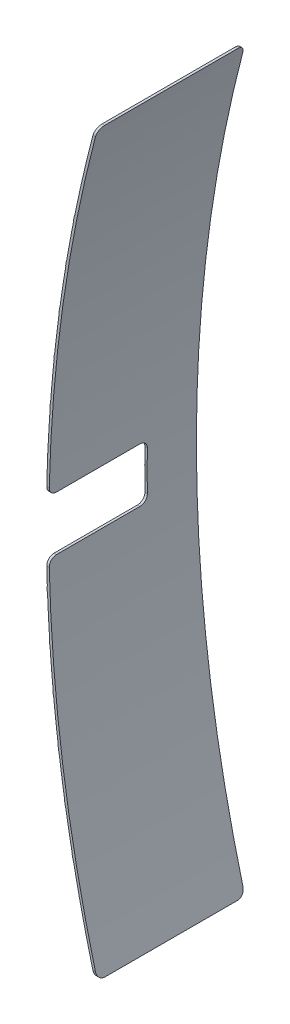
ISO-10303-21;
HEADER;
FILE_DESCRIPTION(('STEP AP214'),'2;1');
FILE_NAME('part.step','',(''),(''),'','','');
FILE_SCHEMA(('AUTOMOTIVE_DESIGN { 1 0 10303 214 1 1 1 1 }'));
ENDSEC;
DATA;
#1=APPLICATION_CONTEXT('core data for automotive mechanical design processes');
#2=APPLICATION_PROTOCOL_DEFINITION('international standard','automotive_design',2000,#1);
#3=PRODUCT_CONTEXT('',#1,'mechanical');
#4=PRODUCT('Part','Part','',(#3));
#5=PRODUCT_RELATED_PRODUCT_CATEGORY('part','',(#4));
#6=PRODUCT_DEFINITION_FORMATION('','',#4);
#7=PRODUCT_DEFINITION_CONTEXT('part definition',#1,'design');
#8=PRODUCT_DEFINITION('design','',#6,#7);
#9=PRODUCT_DEFINITION_SHAPE('','',#8);
#10=(LENGTH_UNIT() NAMED_UNIT(*) SI_UNIT(.MILLI.,.METRE.));
#11=(NAMED_UNIT(*) PLANE_ANGLE_UNIT() SI_UNIT($,.RADIAN.));
#12=(NAMED_UNIT(*) SI_UNIT($,.STERADIAN.) SOLID_ANGLE_UNIT());
#13=UNCERTAINTY_MEASURE_WITH_UNIT(LENGTH_MEASURE(1.E-05),#10,'distance_accuracy_value','');
#14=(GEOMETRIC_REPRESENTATION_CONTEXT(3) GLOBAL_UNCERTAINTY_ASSIGNED_CONTEXT((#13)) GLOBAL_UNIT_ASSIGNED_CONTEXT((#10,
#11,#12)) REPRESENTATION_CONTEXT('',''));
#15=CARTESIAN_POINT('',(0.,0.,0.));
#16=DIRECTION('',(0.,0.,1.));
#17=DIRECTION('',(1.,0.,0.));
#18=AXIS2_PLACEMENT_3D('',#15,#16,#17);
#19=CARTESIAN_POINT('',(0.,0.,6.));
#20=DIRECTION('',(0.,0.,-1.));
#21=DIRECTION('',(-1.,0.,0.));
#22=AXIS2_PLACEMENT_3D('',#19,#20,#21);
#23=CYLINDRICAL_SURFACE('',#22,58.1);
#24=DIRECTION('',(0.,0.,-1.));
#25=VECTOR('',#24,1.);
#26=CARTESIAN_POINT('',(-56.8942535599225,11.7751395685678,3.1));
#27=LINE('',#26,#25);
#28=CARTESIAN_POINT('',(-56.8942535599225,11.7751395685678,3.1));
#29=VERTEX_POINT('',#28);
#30=CARTESIAN_POINT('',(-56.8942535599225,11.7751395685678,2.9));
#31=VERTEX_POINT('',#30);
#32=EDGE_CURVE('E1607',#29,#31,#27,.T.);
#33=ORIENTED_EDGE('',*,*,#32,.T.);
#34=CARTESIAN_POINT('',(0.,0.,2.9));
#35=DIRECTION('',(0.,0.,-1.));
#36=DIRECTION('',(-0.967481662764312,0.252941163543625,0.));
#37=AXIS2_PLACEMENT_3D('',#34,#35,#36);
#38=CIRCLE('',#37,58.1);
#39=CARTESIAN_POINT('',(-56.2106846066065,14.6958816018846,2.9));
#40=VERTEX_POINT('',#39);
#41=EDGE_CURVE('E2915',#31,#40,#38,.T.);
#42=ORIENTED_EDGE('',*,*,#41,.T.);
#43=DIRECTION('',(0.,0.,1.));
#44=VECTOR('',#43,1.);
#45=CARTESIAN_POINT('',(-56.2106846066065,14.6958816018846,2.9));
#46=LINE('',#45,#44);
#47=CARTESIAN_POINT('',(-56.2106846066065,14.6958816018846,3.1));
#48=VERTEX_POINT('',#47);
#49=EDGE_CURVE('E803',#40,#48,#46,.T.);
#50=ORIENTED_EDGE('',*,*,#49,.T.);
#51=CARTESIAN_POINT('',(0.,0.,3.1));
#52=DIRECTION('',(0.,0.,-1.));
#53=DIRECTION('',(-0.967481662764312,0.252941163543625,0.));
#54=AXIS2_PLACEMENT_3D('',#51,#52,#53);
#55=CIRCLE('',#54,58.1);
#56=EDGE_CURVE('E2902',#29,#48,#55,.T.);
#57=ORIENTED_EDGE('',*,*,#56,.F.);
#58=EDGE_LOOP('',(#33,#42,#50,#57));
#59=FACE_BOUND('',#58,.T.);
#60=CARTESIAN_POINT('',(0.,0.,6.));
#61=DIRECTION('',(0.,0.,1.));
#62=DIRECTION('',(1.,0.,0.));
#63=AXIS2_PLACEMENT_3D('',#60,#61,#62);
#64=CIRCLE('',#63,58.1);
#65=CARTESIAN_POINT('',(-58.0510340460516,2.38483672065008,6.));
#66=VERTEX_POINT('',#65);
#67=CARTESIAN_POINT('',(-58.0831300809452,1.4,6.));
#68=VERTEX_POINT('',#67);
#69=EDGE_CURVE('E835',#66,#68,#64,.T.);
#70=ORIENTED_EDGE('',*,*,#69,.F.);
#71=DIRECTION('',(0.,0.,-1.));
#72=VECTOR('',#71,1.);
#73=CARTESIAN_POINT('',(-58.0510340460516,2.38483672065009,6.));
#74=LINE('',#73,#72);
#75=CARTESIAN_POINT('',(-58.0510340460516,2.38483672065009,2.));
#76=VERTEX_POINT('',#75);
#77=EDGE_CURVE('E798',#66,#76,#74,.T.);
#78=ORIENTED_EDGE('',*,*,#77,.T.);
#79=CARTESIAN_POINT('',(0.,0.,2.));
#80=DIRECTION('',(0.,0.,-1.));
#81=DIRECTION('',(-0.999009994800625,0.044486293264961,0.));
#82=AXIS2_PLACEMENT_3D('',#79,#80,#81);
#83=CIRCLE('',#82,58.1);
#84=CARTESIAN_POINT('',(-58.0424806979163,2.58465363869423,2.));
#85=VERTEX_POINT('',#84);
#86=EDGE_CURVE('E802',#76,#85,#83,.T.);
#87=ORIENTED_EDGE('',*,*,#86,.T.);
#88=DIRECTION('',(0.,0.,1.));
#89=VECTOR('',#88,1.);
#90=CARTESIAN_POINT('',(-58.0424806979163,2.58465363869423,2.));
#91=LINE('',#90,#89);
#92=CARTESIAN_POINT('',(-58.0424806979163,2.58465363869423,6.));
#93=VERTEX_POINT('',#92);
#94=EDGE_CURVE('E807',#85,#93,#91,.T.);
#95=ORIENTED_EDGE('',*,*,#94,.T.);
#96=CARTESIAN_POINT('',(-57.9493038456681,4.18188758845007,6.));
#97=VERTEX_POINT('',#96);
#98=EDGE_CURVE('E829',#97,#93,#64,.T.);
#99=ORIENTED_EDGE('',*,*,#98,.F.);
#100=DIRECTION('',(0.,0.,-1.));
#101=VECTOR('',#100,1.);
#102=CARTESIAN_POINT('',(-57.9493038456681,4.18188758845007,5.99999999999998));
#103=LINE('',#102,#101);
#104=CARTESIAN_POINT('',(-57.9493038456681,4.18188758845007,1.99999999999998));
#105=VERTEX_POINT('',#104);
#106=EDGE_CURVE('E810',#97,#105,#103,.T.);
#107=ORIENTED_EDGE('',*,*,#106,.T.);
#108=CARTESIAN_POINT('',(0.,0.,1.99999999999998));
#109=DIRECTION('',(0.,0.,-1.));
#110=DIRECTION('',(-0.99715258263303,0.075410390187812,0.));
#111=AXIS2_PLACEMENT_3D('',#108,#109,#110);
#112=CIRCLE('',#111,58.1);
#113=CARTESIAN_POINT('',(-57.934565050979,4.38134366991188,1.99999999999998));
#114=VERTEX_POINT('',#113);
#115=EDGE_CURVE('E840',#105,#114,#112,.T.);
#116=ORIENTED_EDGE('',*,*,#115,.T.);
#117=DIRECTION('',(0.,0.,1.));
#118=VECTOR('',#117,1.);
#119=CARTESIAN_POINT('',(-57.934565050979,4.38134366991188,1.99999999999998));
#120=LINE('',#119,#118);
#121=CARTESIAN_POINT('',(-57.934565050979,4.38134366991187,6.));
#122=VERTEX_POINT('',#121);
#123=EDGE_CURVE('E844',#114,#122,#120,.T.);
#124=ORIENTED_EDGE('',*,*,#123,.T.);
#125=CARTESIAN_POINT('',(-57.7919568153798,5.97492489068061,6.));
#126=VERTEX_POINT('',#125);
#127=EDGE_CURVE('E869',#126,#122,#64,.T.);
#128=ORIENTED_EDGE('',*,*,#127,.F.);
#129=DIRECTION('',(0.,0.,-1.));
#130=VECTOR('',#129,1.);
#131=CARTESIAN_POINT('',(-57.7919568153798,5.97492489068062,5.99999999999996));
#132=LINE('',#131,#130);
#133=CARTESIAN_POINT('',(-57.7919568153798,5.97492489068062,1.99999999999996));
#134=VERTEX_POINT('',#133);
#135=EDGE_CURVE('E848',#126,#134,#132,.T.);
#136=ORIENTED_EDGE('',*,*,#135,.T.);
#137=CARTESIAN_POINT('',(0.,0.,1.99999999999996));
#138=DIRECTION('',(0.,0.,-1.));
#139=DIRECTION('',(-0.994338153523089,0.106262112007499,0.));
#140=AXIS2_PLACEMENT_3D('',#137,#138,#139);
#141=CIRCLE('',#140,58.1);
#142=CARTESIAN_POINT('',(-57.7710467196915,6.17382870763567,1.99999999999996));
#143=VERTEX_POINT('',#142);
#144=EDGE_CURVE('E1213',#134,#143,#141,.T.);
#145=ORIENTED_EDGE('',*,*,#144,.T.);
#146=DIRECTION('',(0.,0.,1.));
#147=VECTOR('',#146,1.);
#148=CARTESIAN_POINT('',(-57.7710467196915,6.17382870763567,1.99999999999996));
#149=LINE('',#148,#147);
#150=CARTESIAN_POINT('',(-57.7710467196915,6.17382870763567,6.));
#151=VERTEX_POINT('',#150);
#152=EDGE_CURVE('E1174',#143,#151,#149,.T.);
#153=ORIENTED_EDGE('',*,*,#152,.T.);
#154=CARTESIAN_POINT('',(-57.5791439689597,7.7622277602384,6.));
#155=VERTEX_POINT('',#154);
#156=EDGE_CURVE('E1207',#155,#151,#64,.T.);
#157=ORIENTED_EDGE('',*,*,#156,.F.);
#158=DIRECTION('',(0.,0.,-1.));
#159=VECTOR('',#158,1.);
#160=CARTESIAN_POINT('',(-57.5791439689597,7.7622277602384,5.99999999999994));
#161=LINE('',#160,#159);
#162=CARTESIAN_POINT('',(-57.5791439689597,7.7622277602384,1.99999999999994));
#163=VERTEX_POINT('',#162);
#164=EDGE_CURVE('E1169',#155,#163,#161,.T.);
#165=ORIENTED_EDGE('',*,*,#164,.T.);
#166=CARTESIAN_POINT('',(0.,0.,1.99999999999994));
#167=DIRECTION('',(0.,0.,-1.));
#168=DIRECTION('',(-0.990569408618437,0.137011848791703,0.));
#169=AXIS2_PLACEMENT_3D('',#166,#167,#168);
#170=CIRCLE('',#169,58.1);
#171=CARTESIAN_POINT('',(-57.5520826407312,7.96038841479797,1.99999999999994));
#172=VERTEX_POINT('',#171);
#173=EDGE_CURVE('E1173',#163,#172,#170,.T.);
#174=ORIENTED_EDGE('',*,*,#173,.T.);
#175=DIRECTION('',(0.,0.,1.));
#176=VECTOR('',#175,1.);
#177=CARTESIAN_POINT('',(-57.5520826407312,7.96038841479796,1.99999999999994));
#178=LINE('',#177,#176);
#179=CARTESIAN_POINT('',(-57.5520826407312,7.96038841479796,6.));
#180=VERTEX_POINT('',#179);
#181=EDGE_CURVE('E1133',#172,#180,#178,.T.);
#182=ORIENTED_EDGE('',*,*,#181,.T.);
#183=CARTESIAN_POINT('',(-57.3110695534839,9.54208083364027,6.));
#184=VERTEX_POINT('',#183);
#185=EDGE_CURVE('E1166',#184,#180,#64,.T.);
#186=ORIENTED_EDGE('',*,*,#185,.F.);
#187=DIRECTION('',(0.,0.,-1.));
#188=VECTOR('',#187,1.);
#189=CARTESIAN_POINT('',(-57.3110695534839,9.54208083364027,5.99999999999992));
#190=LINE('',#189,#188);
#191=CARTESIAN_POINT('',(-57.3110695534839,9.54208083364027,1.99999999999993));
#192=VERTEX_POINT('',#191);
#193=EDGE_CURVE('E1128',#184,#192,#190,.T.);
#194=ORIENTED_EDGE('',*,*,#193,.T.);
#195=CARTESIAN_POINT('',(0.,0.,1.99999999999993));
#196=DIRECTION('',(0.,0.,-1.));
#197=DIRECTION('',(-0.985849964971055,0.167630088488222,0.));
#198=AXIS2_PLACEMENT_3D('',#195,#196,#197);
#199=CIRCLE('',#198,58.1);
#200=CARTESIAN_POINT('',(-57.2778829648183,9.73930814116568,1.99999999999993));
#201=VERTEX_POINT('',#200);
#202=EDGE_CURVE('E1132',#192,#201,#199,.T.);
#203=ORIENTED_EDGE('',*,*,#202,.T.);
#204=DIRECTION('',(0.,0.,1.));
#205=VECTOR('',#204,1.);
#206=CARTESIAN_POINT('',(-57.2778829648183,9.73930814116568,1.99999999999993));
#207=LINE('',#206,#205);
#208=CARTESIAN_POINT('',(-57.2778829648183,9.73930814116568,6.));
#209=VERTEX_POINT('',#208);
#210=EDGE_CURVE('E1089',#201,#209,#207,.T.);
#211=ORIENTED_EDGE('',*,*,#210,.T.);
#212=CARTESIAN_POINT('',(-56.987990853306,11.3127758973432,6.));
#213=VERTEX_POINT('',#212);
#214=EDGE_CURVE('E1125',#213,#209,#64,.T.);
#215=ORIENTED_EDGE('',*,*,#214,.F.);
#216=DIRECTION('',(0.,0.,-1.));
#217=VECTOR('',#216,1.);
#218=CARTESIAN_POINT('',(-56.987990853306,11.3127758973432,5.99999999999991));
#219=LINE('',#218,#217);
#220=CARTESIAN_POINT('',(-56.987990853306,11.3127758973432,1.99999999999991));
#221=VERTEX_POINT('',#220);
#222=EDGE_CURVE('E1084',#213,#221,#219,.T.);
#223=ORIENTED_EDGE('',*,*,#222,.T.);
#224=CARTESIAN_POINT('',(0.,0.,1.99999999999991));
#225=DIRECTION('',(0.,0.,-1.));
#226=DIRECTION('',(-0.980184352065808,0.198087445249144,0.));
#227=AXIS2_PLACEMENT_3D('',#224,#225,#226);
#228=CIRCLE('',#227,58.1);
#229=CARTESIAN_POINT('',(-56.9487108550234,11.5088805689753,1.99999999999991));
#230=VERTEX_POINT('',#229);
#231=EDGE_CURVE('E1088',#221,#230,#228,.T.);
#232=ORIENTED_EDGE('',*,*,#231,.T.);
#233=DIRECTION('',(0.,0.,1.));
#234=VECTOR('',#233,1.);
#235=CARTESIAN_POINT('',(-56.9487108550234,11.5088805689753,1.99999999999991));
#236=LINE('',#235,#234);
#237=CARTESIAN_POINT('',(-56.9487108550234,11.5088805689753,6.));
#238=VERTEX_POINT('',#237);
#239=EDGE_CURVE('E1093',#230,#238,#236,.T.);
#240=ORIENTED_EDGE('',*,*,#239,.T.);
#241=CARTESIAN_POINT('',(-56.2096077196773,14.7,6.));
#242=VERTEX_POINT('',#241);
#243=EDGE_CURVE('E1118',#242,#238,#64,.T.);
#244=ORIENTED_EDGE('',*,*,#243,.F.);
#245=CARTESIAN_POINT('',(-56.2096077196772,14.7,6.));
#246=CARTESIAN_POINT('',(-56.2050797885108,14.7173150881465,6.00001220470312));
#247=CARTESIAN_POINT('',(-56.2005435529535,14.7346267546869,5.99850157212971));
#248=CARTESIAN_POINT('',(-56.1915819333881,14.7687650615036,5.99252307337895));
#249=CARTESIAN_POINT('',(-56.1871565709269,14.7855916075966,5.98805463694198));
#250=CARTESIAN_POINT('',(-56.1785426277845,14.8182872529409,5.97624440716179));
#251=CARTESIAN_POINT('',(-56.1743542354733,14.8341555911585,5.96890036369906));
#252=CARTESIAN_POINT('',(-56.1663479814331,14.864440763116,5.9515227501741));
#253=CARTESIAN_POINT('',(-56.1625299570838,14.8788582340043,5.94149036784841));
#254=CARTESIAN_POINT('',(-56.1554424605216,14.9055852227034,5.91916492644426));
#255=CARTESIAN_POINT('',(-56.1521654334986,14.9179238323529,5.90690913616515));
#256=CARTESIAN_POINT('',(-56.1462006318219,14.9403577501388,5.88036078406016));
#257=CARTESIAN_POINT('',(-56.143512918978,14.9504528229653,5.86606800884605));
#258=CARTESIAN_POINT('',(-56.138901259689,14.9677601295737,5.83634832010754));
#259=CARTESIAN_POINT('',(-56.1369555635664,14.9750545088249,5.8209725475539));
#260=CARTESIAN_POINT('',(-56.1337811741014,14.9869493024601,5.78915055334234));
#261=CARTESIAN_POINT('',(-56.1325516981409,14.9915526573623,5.77270552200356));
#262=CARTESIAN_POINT('',(-56.1312348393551,14.9964822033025,5.74676287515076));
#263=CARTESIAN_POINT('',(-56.1308825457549,14.9978007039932,5.73745608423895));
#264=CARTESIAN_POINT('',(-56.1304126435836,14.9995592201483,5.71876776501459));
#265=CARTESIAN_POINT('',(-56.1302946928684,15.0000005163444,5.70938636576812));
#266=CARTESIAN_POINT('',(-56.1302948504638,15.0000000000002,5.70000000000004));
#267=B_SPLINE_CURVE_WITH_KNOTS('',3,(#245,#246,#247,#248,#249,#250,#251,#252,#253,#254,#255,
#256,#257,#258,#259,#260,#261,#262,#263,#264,#265,#266),.UNSPECIFIED.,.F.,.F.,(4,2,2,2,2,2,2,2,
2,2,4),(0.,0.0536273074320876,0.107264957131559,0.160944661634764,0.214600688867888,
0.26742884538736,0.320262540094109,0.371400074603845,0.422481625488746,0.450661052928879,
0.478799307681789),.UNSPECIFIED.);
#268=CARTESIAN_POINT('',(-56.1302948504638,15.,5.7));
#269=VERTEX_POINT('',#268);
#270=EDGE_CURVE('E1097',#242,#269,#267,.T.);
#271=ORIENTED_EDGE('',*,*,#270,.T.);
#272=DIRECTION('',(0.,0.,-1.));
#273=VECTOR('',#272,1.);
#274=CARTESIAN_POINT('',(-56.1302948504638,15.,6.));
#275=LINE('',#274,#273);
#276=CARTESIAN_POINT('',(-56.1302948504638,15.,0.3));
#277=VERTEX_POINT('',#276);
#278=EDGE_CURVE('E1366',#269,#277,#275,.T.);
#279=ORIENTED_EDGE('',*,*,#278,.T.);
#280=CARTESIAN_POINT('',(-56.1302948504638,15.,0.3));
#281=CARTESIAN_POINT('',(-56.1302903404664,15.0000161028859,0.283533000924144));
#282=CARTESIAN_POINT('',(-56.1306568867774,14.9986452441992,0.267073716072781));
#283=CARTESIAN_POINT('',(-56.132097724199,14.9932524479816,0.234655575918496));
#284=CARTESIAN_POINT('',(-56.1331707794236,14.9892351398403,0.218695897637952));
#285=CARTESIAN_POINT('',(-56.1359906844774,14.9786707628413,0.187699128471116));
#286=CARTESIAN_POINT('',(-56.1377376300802,14.9721233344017,0.172662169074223));
#287=CARTESIAN_POINT('',(-56.1418443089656,14.9567169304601,0.143915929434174));
#288=CARTESIAN_POINT('',(-56.1442041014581,14.9478577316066,0.13020677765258));
#289=CARTESIAN_POINT('',(-56.1494994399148,14.9279543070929,0.104275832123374));
#290=CARTESIAN_POINT('',(-56.1524429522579,14.916879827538,0.0920789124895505));
#291=CARTESIAN_POINT('',(-56.158791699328,14.8929603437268,0.069707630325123));
#292=CARTESIAN_POINT('',(-56.1621970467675,14.8801149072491,0.059533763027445));
#293=CARTESIAN_POINT('',(-56.169485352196,14.8525797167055,0.0411521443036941));
#294=CARTESIAN_POINT('',(-56.1733801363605,14.8378439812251,0.033018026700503));
#295=CARTESIAN_POINT('',(-56.1814429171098,14.8072860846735,0.0193404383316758));
#296=CARTESIAN_POINT('',(-56.1856108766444,14.7914640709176,0.0137966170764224));
#297=CARTESIAN_POINT('',(-56.1930927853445,14.7630107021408,0.00641619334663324));
#298=CARTESIAN_POINT('',(-56.196374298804,14.7505146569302,0.00401167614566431));
#299=CARTESIAN_POINT('',(-56.2029742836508,14.725347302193,0.000803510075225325));
#300=CARTESIAN_POINT('',(-56.2062926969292,14.7126762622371,-2.37308624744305E-06));
#301=CARTESIAN_POINT('',(-56.2096077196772,14.7,0.));
#302=B_SPLINE_CURVE_WITH_KNOTS('',3,(#280,#281,#282,#283,#284,#285,#286,#287,#288,#289,#290,
#291,#292,#293,#294,#295,#296,#297,#298,#299,#300,#301),.UNSPECIFIED.,.F.,.F.,(4,2,2,2,2,2,2,2,
2,2,4),(0.,0.0493282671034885,0.0985704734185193,0.147819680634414,0.19707364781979,
0.247052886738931,0.297044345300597,0.348641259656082,0.400231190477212,0.439560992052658,
0.478835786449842),.UNSPECIFIED.);
#303=CARTESIAN_POINT('',(-56.2096077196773,14.7,0.));
#304=VERTEX_POINT('',#303);
#305=EDGE_CURVE('E1369',#277,#304,#302,.T.);
#306=ORIENTED_EDGE('',*,*,#305,.T.);
#307=CARTESIAN_POINT('',(0.,0.,0.));
#308=DIRECTION('',(0.,0.,1.));
#309=DIRECTION('',(1.,0.,0.));
#310=AXIS2_PLACEMENT_3D('',#307,#308,#309);
#311=CIRCLE('',#310,58.1);
#312=CARTESIAN_POINT('',(-58.0150215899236,3.1412210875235,0.));
#313=VERTEX_POINT('',#312);
#314=EDGE_CURVE('E1351',#304,#313,#311,.T.);
#315=ORIENTED_EDGE('',*,*,#314,.T.);
#316=CARTESIAN_POINT('',(-58.0998246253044,0.142753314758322,2.));
#317=CARTESIAN_POINT('',(-58.0973675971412,1.14275044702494,1.33333323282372));
#318=CARTESIAN_POINT('',(-58.069087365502,2.14268356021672,0.666666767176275));
#319=CARTESIAN_POINT('',(-58.0150215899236,3.1412210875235,0.));
#320=B_SPLINE_CURVE_WITH_KNOTS('',3,(#316,#317,#318,#319),.UNSPECIFIED.,.F.,.F.,(4,4),(0.,1.),.UNSPECIFIED.);
#321=CARTESIAN_POINT('',(-58.0998246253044,0.142753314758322,2.));
#322=VERTEX_POINT('',#321);
#323=EDGE_CURVE('E2859',#313,#322,#320,.F.);
#324=ORIENTED_EDGE('',*,*,#323,.T.);
#325=CARTESIAN_POINT('',(0.,0.,2.));
#326=DIRECTION('',(0.,0.,-1.));
#327=DIRECTION('',(-1.,0.,0.));
#328=AXIS2_PLACEMENT_3D('',#325,#326,#327);
#329=CIRCLE('',#328,58.1);
#330=CARTESIAN_POINT('',(-58.0944919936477,0.8,2.));
#331=VERTEX_POINT('',#330);
#332=EDGE_CURVE('E1353',#322,#331,#329,.T.);
#333=ORIENTED_EDGE('',*,*,#332,.T.);
#334=CARTESIAN_POINT('',(-58.0944919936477,0.8,2.));
#335=CARTESIAN_POINT('',(-58.0942598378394,0.816879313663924,1.99998567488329));
#336=CARTESIAN_POINT('',(-58.094019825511,0.833754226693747,2.00142369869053));
#337=CARTESIAN_POINT('',(-58.0935328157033,0.86701361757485,2.0070986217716));
#338=CARTESIAN_POINT('',(-58.0932858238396,0.883398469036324,2.01133332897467));
#339=CARTESIAN_POINT('',(-58.0927930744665,0.915231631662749,2.02249877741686));
#340=CARTESIAN_POINT('',(-58.0925473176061,0.930679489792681,2.02943081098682));
#341=CARTESIAN_POINT('',(-58.0920670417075,0.960189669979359,2.04578815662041));
#342=CARTESIAN_POINT('',(-58.0918325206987,0.974252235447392,2.05521302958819));
#343=CARTESIAN_POINT('',(-58.0913847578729,1.00059530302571,2.07629009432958));
#344=CARTESIAN_POINT('',(-58.0911715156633,1.01287583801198,2.08794224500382));
#345=CARTESIAN_POINT('',(-58.090776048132,1.03530879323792,2.11314606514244));
#346=CARTESIAN_POINT('',(-58.0905938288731,1.045460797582,2.12669810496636));
#347=CARTESIAN_POINT('',(-58.0902692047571,1.0633456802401,2.15531452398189));
#348=CARTESIAN_POINT('',(-58.0901268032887,1.07107835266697,2.17037903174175));
#349=CARTESIAN_POINT('',(-58.0898889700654,1.08390074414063,2.20158982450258));
#350=CARTESIAN_POINT('',(-58.0897935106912,1.08899201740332,2.2177354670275));
#351=CARTESIAN_POINT('',(-58.0896782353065,1.09512026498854,2.24498345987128));
#352=CARTESIAN_POINT('',(-58.0896437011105,1.09694905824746,2.25591422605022));
#353=CARTESIAN_POINT('',(-58.0895975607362,1.0993887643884,2.27789513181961));
#354=CARTESIAN_POINT('',(-58.0895859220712,1.10000140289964,2.28894507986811));
#355=CARTESIAN_POINT('',(-58.0895859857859,1.1000000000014,2.29999999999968));
#356=B_SPLINE_CURVE_WITH_KNOTS('',3,(#334,#335,#336,#337,#338,#339,#340,#341,#342,#343,#344,
#345,#346,#347,#348,#349,#350,#351,#352,#353,#354,#355),.UNSPECIFIED.,.F.,.F.,(4,2,2,2,2,2,2,2,
2,2,4),(0.,0.0505754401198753,0.101111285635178,0.151671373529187,0.202222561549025,
0.252772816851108,0.303332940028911,0.353897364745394,0.404432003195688,0.437617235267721,
0.470755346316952),.UNSPECIFIED.);
#357=CARTESIAN_POINT('',(-58.0895859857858,1.1,2.3));
#358=VERTEX_POINT('',#357);
#359=EDGE_CURVE('E1459',#331,#358,#356,.T.);
#360=ORIENTED_EDGE('',*,*,#359,.T.);
#361=DIRECTION('',(0.,0.,-1.));
#362=VECTOR('',#361,1.);
#363=CARTESIAN_POINT('',(-58.0895859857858,1.1,6.));
#364=LINE('',#363,#362);
#365=CARTESIAN_POINT('',(-58.0895859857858,1.1,5.7));
#366=VERTEX_POINT('',#365);
#367=EDGE_CURVE('E1466',#358,#366,#364,.F.);
#368=ORIENTED_EDGE('',*,*,#367,.T.);
#369=CARTESIAN_POINT('',(-58.0895859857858,1.1,5.7));
#370=CARTESIAN_POINT('',(-58.089586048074,1.09998565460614,5.71687511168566));
#371=CARTESIAN_POINT('',(-58.0895590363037,1.10142298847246,5.73374592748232));
#372=CARTESIAN_POINT('',(-58.0894513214,1.10709514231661,5.76699732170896));
#373=CARTESIAN_POINT('',(-58.0893706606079,1.11132775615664,5.78337827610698));
#374=CARTESIAN_POINT('',(-58.0891560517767,1.1224875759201,5.81520400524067));
#375=CARTESIAN_POINT('',(-58.0890220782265,1.12941607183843,5.8306483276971));
#376=CARTESIAN_POINT('',(-58.088701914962,1.145764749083,5.86015199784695));
#377=CARTESIAN_POINT('',(-58.0885157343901,1.15518449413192,5.87421158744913));
#378=CARTESIAN_POINT('',(-58.088092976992,1.17625032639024,5.90055056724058));
#379=CARTESIAN_POINT('',(-58.0878563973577,1.1878965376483,5.91282985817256));
#380=CARTESIAN_POINT('',(-58.0873357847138,1.21308689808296,5.93526140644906));
#381=CARTESIAN_POINT('',(-58.0870517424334,1.2266314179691,5.94541324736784));
#382=CARTESIAN_POINT('',(-58.0864406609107,1.25523538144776,5.9633020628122));
#383=CARTESIAN_POINT('',(-58.0861136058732,1.27029538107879,5.97103814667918));
#384=CARTESIAN_POINT('',(-58.0854228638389,1.30149665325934,5.98386826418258));
#385=CARTESIAN_POINT('',(-58.0850591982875,1.31763729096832,5.98896383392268));
#386=CARTESIAN_POINT('',(-58.0844331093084,1.34489691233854,5.99510478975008));
#387=CARTESIAN_POINT('',(-58.0841786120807,1.35584480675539,5.99693939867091));
#388=CARTESIAN_POINT('',(-58.0836605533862,1.37786030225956,5.99938684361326));
#389=CARTESIAN_POINT('',(-58.0833970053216,1.38892771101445,6.00000141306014));
#390=CARTESIAN_POINT('',(-58.0831300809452,1.39999999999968,6.00000000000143));
#391=B_SPLINE_CURVE_WITH_KNOTS('',3,(#369,#370,#371,#372,#373,#374,#375,#376,#377,#378,#379,
#380,#381,#382,#383,#384,#385,#386,#387,#388,#389,#390),.UNSPECIFIED.,.F.,.F.,(4,2,2,2,2,2,2,2,
2,2,4),(0.,0.0505580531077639,0.101076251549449,0.151618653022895,0.202152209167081,
0.252688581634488,0.303234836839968,0.353799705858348,0.404335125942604,0.437582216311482,
0.470782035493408),.UNSPECIFIED.);
#392=EDGE_CURVE('E1444',#366,#68,#391,.T.);
#393=ORIENTED_EDGE('',*,*,#392,.T.);
#394=EDGE_LOOP('',(#70,#78,#87,#95,#99,#107,#116,#124,#128,#136,#145,#153,#157,#165,#174,#182,
#186,#194,#203,#211,#215,#223,#232,#240,#244,#271,#279,#306,#315,#324,#333,#360,#368,#393));
#395=FACE_BOUND('',#394,.T.);
#396=ADVANCED_FACE('F690',(#59,#395),#23,.T.);
#397=CARTESIAN_POINT('',(0.,0.,6.));
#398=DIRECTION('',(0.,0.,1.));
#399=DIRECTION('',(1.,0.,0.));
#400=AXIS2_PLACEMENT_3D('',#397,#398,#399);
#401=PLANE('',#400);
#402=ORIENTED_EDGE('',*,*,#243,.T.);
#403=DIRECTION('',(0.980184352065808,-0.198087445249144,0.));
#404=VECTOR('',#403,1.);
#405=CARTESIAN_POINT('',(-56.9487108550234,11.5088805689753,6.));
#406=LINE('',#405,#404);
#407=CARTESIAN_POINT('',(-56.9585126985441,11.5108614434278,6.));
#408=VERTEX_POINT('',#407);
#409=EDGE_CURVE('E863',#408,#238,#406,.T.);
#410=ORIENTED_EDGE('',*,*,#409,.F.);
#411=CARTESIAN_POINT('',(0.,0.,6.));
#412=DIRECTION('',(0.,0.,-1.));
#413=DIRECTION('',(-1.,0.,0.));
#414=AXIS2_PLACEMENT_3D('',#411,#412,#413);
#415=CIRCLE('',#414,58.11);
#416=CARTESIAN_POINT('',(-56.9977994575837,11.3147230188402,6.));
#417=VERTEX_POINT('',#416);
#418=EDGE_CURVE('E1113',#408,#417,#415,.F.);
#419=ORIENTED_EDGE('',*,*,#418,.T.);
#420=DIRECTION('',(0.980860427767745,-0.194712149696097,0.));
#421=VECTOR('',#420,1.);
#422=CARTESIAN_POINT('',(-56.987990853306,11.3127758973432,6.));
#423=LINE('',#422,#421);
#424=EDGE_CURVE('E1117',#417,#213,#423,.T.);
#425=ORIENTED_EDGE('',*,*,#424,.T.);
#426=ORIENTED_EDGE('',*,*,#214,.T.);
#427=DIRECTION('',(0.985849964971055,-0.167630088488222,0.));
#428=VECTOR('',#427,1.);
#429=CARTESIAN_POINT('',(-57.2778829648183,9.73930814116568,6.));
#430=LINE('',#429,#428);
#431=CARTESIAN_POINT('',(-57.287741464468,9.74098444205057,6.));
#432=VERTEX_POINT('',#431);
#433=EDGE_CURVE('E1112',#432,#209,#430,.T.);
#434=ORIENTED_EDGE('',*,*,#433,.F.);
#435=CARTESIAN_POINT('',(0.,0.,6.));
#436=DIRECTION('',(0.,0.,-1.));
#437=DIRECTION('',(-1.,0.,0.));
#438=AXIS2_PLACEMENT_3D('',#435,#436,#437);
#439=CIRCLE('',#438,58.11);
#440=CARTESIAN_POINT('',(-57.3209337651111,9.54372318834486,6.));
#441=VERTEX_POINT('',#440);
#442=EDGE_CURVE('E1155',#432,#441,#439,.F.);
#443=ORIENTED_EDGE('',*,*,#442,.T.);
#444=DIRECTION('',(0.986421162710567,-0.164235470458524,0.));
#445=VECTOR('',#444,1.);
#446=CARTESIAN_POINT('',(-57.3110695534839,9.54208083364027,6.));
#447=LINE('',#446,#445);
#448=EDGE_CURVE('E1159',#441,#184,#447,.T.);
#449=ORIENTED_EDGE('',*,*,#448,.T.);
#450=ORIENTED_EDGE('',*,*,#185,.T.);
#451=DIRECTION('',(0.990569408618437,-0.137011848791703,0.));
#452=VECTOR('',#451,1.);
#453=CARTESIAN_POINT('',(-57.5520826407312,7.96038841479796,6.));
#454=LINE('',#453,#452);
#455=CARTESIAN_POINT('',(-57.5619883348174,7.96175853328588,6.));
#456=VERTEX_POINT('',#455);
#457=EDGE_CURVE('E1154',#456,#180,#454,.T.);
#458=ORIENTED_EDGE('',*,*,#457,.F.);
#459=CARTESIAN_POINT('',(0.,0.,6.));
#460=DIRECTION('',(0.,0.,-1.));
#461=DIRECTION('',(-1.,0.,0.));
#462=AXIS2_PLACEMENT_3D('',#459,#460,#461);
#463=CIRCLE('',#462,58.11);
#464=CARTESIAN_POINT('',(-57.5890543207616,7.76356377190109,6.));
#465=VERTEX_POINT('',#464);
#466=EDGE_CURVE('E1196',#456,#465,#463,.F.);
#467=ORIENTED_EDGE('',*,*,#466,.T.);
#468=DIRECTION('',(0.991035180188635,-0.133601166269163,0.));
#469=VECTOR('',#468,1.);
#470=CARTESIAN_POINT('',(-57.5791439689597,7.7622277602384,6.));
#471=LINE('',#470,#469);
#472=EDGE_CURVE('E1200',#465,#155,#471,.T.);
#473=ORIENTED_EDGE('',*,*,#472,.T.);
#474=ORIENTED_EDGE('',*,*,#156,.T.);
#475=DIRECTION('',(0.994338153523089,-0.106262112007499,0.));
#476=VECTOR('',#475,1.);
#477=CARTESIAN_POINT('',(-57.7710467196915,6.17382870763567,6.));
#478=LINE('',#477,#476);
#479=CARTESIAN_POINT('',(-57.7809901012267,6.17489132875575,6.));
#480=VERTEX_POINT('',#479);
#481=EDGE_CURVE('E1195',#480,#151,#478,.T.);
#482=ORIENTED_EDGE('',*,*,#481,.F.);
#483=CARTESIAN_POINT('',(0.,0.,6.));
#484=DIRECTION('',(0.,0.,-1.));
#485=DIRECTION('',(-1.,0.,0.));
#486=AXIS2_PLACEMENT_3D('',#483,#484,#485);
#487=CIRCLE('',#486,58.11);
#488=CARTESIAN_POINT('',(-57.8019037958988,5.97595327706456,6.));
#489=VERTEX_POINT('',#488);
#490=EDGE_CURVE('E1233',#480,#489,#487,.F.);
#491=ORIENTED_EDGE('',*,*,#490,.T.);
#492=DIRECTION('',(0.994698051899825,-0.102838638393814,0.));
#493=VECTOR('',#492,1.);
#494=CARTESIAN_POINT('',(-57.7919568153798,5.97492489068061,6.));
#495=LINE('',#494,#493);
#496=EDGE_CURVE('E1237',#489,#126,#495,.T.);
#497=ORIENTED_EDGE('',*,*,#496,.T.);
#498=ORIENTED_EDGE('',*,*,#127,.T.);
#499=DIRECTION('',(0.99715258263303,-0.075410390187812,0.));
#500=VECTOR('',#499,1.);
#501=CARTESIAN_POINT('',(-57.934565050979,4.38134366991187,6.));
#502=LINE('',#501,#500);
#503=CARTESIAN_POINT('',(-57.9445365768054,4.38209777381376,6.));
#504=VERTEX_POINT('',#503);
#505=EDGE_CURVE('E823',#504,#122,#502,.T.);
#506=ORIENTED_EDGE('',*,*,#505,.F.);
#507=CARTESIAN_POINT('',(0.,0.,6.));
#508=DIRECTION('',(0.,0.,-1.));
#509=DIRECTION('',(-1.,0.,0.));
#510=AXIS2_PLACEMENT_3D('',#507,#508,#509);
#511=CIRCLE('',#510,58.11);
#512=CARTESIAN_POINT('',(-57.9592779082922,4.18260736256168,6.));
#513=VERTEX_POINT('',#512);
#514=EDGE_CURVE('E864',#504,#513,#511,.F.);
#515=ORIENTED_EDGE('',*,*,#514,.T.);
#516=DIRECTION('',(0.997406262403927,-0.0719774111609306,0.));
#517=VECTOR('',#516,1.);
#518=CARTESIAN_POINT('',(-57.9493038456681,4.18188758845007,6.));
#519=LINE('',#518,#517);
#520=EDGE_CURVE('E868',#513,#97,#519,.T.);
#521=ORIENTED_EDGE('',*,*,#520,.T.);
#522=ORIENTED_EDGE('',*,*,#98,.T.);
#523=DIRECTION('',(0.999009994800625,-0.0444862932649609,0.));
#524=VECTOR('',#523,1.);
#525=CARTESIAN_POINT('',(-58.0424806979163,2.58465363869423,6.));
#526=LINE('',#525,#524);
#527=CARTESIAN_POINT('',(-58.0524707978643,2.58509850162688,6.));
#528=VERTEX_POINT('',#527);
#529=EDGE_CURVE('E13',#528,#93,#526,.T.);
#530=ORIENTED_EDGE('',*,*,#529,.F.);
#531=CARTESIAN_POINT('',(0.,0.,6.));
#532=DIRECTION('',(0.,0.,-1.));
#533=DIRECTION('',(-1.,0.,0.));
#534=AXIS2_PLACEMENT_3D('',#531,#532,#533);
#535=CIRCLE('',#534,58.11);
#536=CARTESIAN_POINT('',(-58.0610256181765,2.38524719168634,6.));
#537=VERTEX_POINT('',#536);
#538=EDGE_CURVE('E824',#528,#537,#535,.F.);
#539=ORIENTED_EDGE('',*,*,#538,.T.);
#540=DIRECTION('',(0.999157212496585,-0.0410471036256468,0.));
#541=VECTOR('',#540,1.);
#542=CARTESIAN_POINT('',(-58.0510340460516,2.38483672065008,6.));
#543=LINE('',#542,#541);
#544=EDGE_CURVE('E828',#537,#66,#543,.T.);
#545=ORIENTED_EDGE('',*,*,#544,.T.);
#546=ORIENTED_EDGE('',*,*,#69,.T.);
#547=DIRECTION('',(-1.,0.,0.));
#548=VECTOR('',#547,1.);
#549=CARTESIAN_POINT('',(-57.9895680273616,1.4,6.));
#550=LINE('',#549,#548);
#551=CARTESIAN_POINT('',(-57.9831009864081,1.4,6.));
#552=VERTEX_POINT('',#551);
#553=EDGE_CURVE('E1578',#68,#552,#550,.F.);
#554=ORIENTED_EDGE('',*,*,#553,.T.);
#555=CARTESIAN_POINT('',(0.,0.,6.));
#556=DIRECTION('',(0.,0.,-1.));
#557=DIRECTION('',(1.,0.,0.));
#558=AXIS2_PLACEMENT_3D('',#555,#556,#557);
#559=CIRCLE('',#558,58.);
#560=CARTESIAN_POINT('',(-56.1062385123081,14.7,6.));
#561=VERTEX_POINT('',#560);
#562=EDGE_CURVE('E1620',#552,#561,#559,.T.);
#563=ORIENTED_EDGE('',*,*,#562,.T.);
#564=DIRECTION('',(-1.,0.,0.));
#565=VECTOR('',#564,1.);
#566=CARTESIAN_POINT('',(-56.1302948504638,14.7,6.));
#567=LINE('',#566,#565);
#568=EDGE_CURVE('E1529',#561,#242,#567,.T.);
#569=ORIENTED_EDGE('',*,*,#568,.T.);
#570=EDGE_LOOP('',(#402,#410,#419,#425,#426,#434,#443,#449,#450,#458,#467,#473,#474,#482,#491,
#497,#498,#506,#515,#521,#522,#530,#539,#545,#546,#554,#563,#569));
#571=FACE_BOUND('',#570,.T.);
#572=ADVANCED_FACE('F1593',(#571),#401,.T.);
#573=CARTESIAN_POINT('',(0.,0.,6.));
#574=DIRECTION('',(0.,0.,-1.));
#575=DIRECTION('',(-1.,0.,0.));
#576=AXIS2_PLACEMENT_3D('',#573,#574,#575);
#577=CYLINDRICAL_SURFACE('',#576,58.);
#578=ORIENTED_EDGE('',*,*,#562,.F.);
#579=CARTESIAN_POINT('',(-57.9831009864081,1.4,6.));
#580=CARTESIAN_POINT('',(-57.9835088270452,1.38312044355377,6.00001432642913));
#581=CARTESIAN_POINT('',(-57.9839086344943,1.366244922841,5.99857625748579));
#582=CARTESIAN_POINT('',(-57.9846826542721,1.33298358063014,5.99290079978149));
#583=CARTESIAN_POINT('',(-57.9850568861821,1.31659739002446,5.9886655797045));
#584=CARTESIAN_POINT('',(-57.9857710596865,1.2847610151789,5.97749828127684));
#585=CARTESIAN_POINT('',(-57.986110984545,1.26931128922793,5.9705648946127));
#586=CARTESIAN_POINT('',(-57.9867495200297,1.23979739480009,5.95420385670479));
#587=CARTESIAN_POINT('',(-57.9870481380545,1.22573297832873,5.94477665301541));
#588=CARTESIAN_POINT('',(-57.9875990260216,1.19938870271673,5.92369559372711));
#589=CARTESIAN_POINT('',(-57.9878513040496,1.187108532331,5.91204212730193));
#590=CARTESIAN_POINT('',(-57.9883061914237,1.16467644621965,5.88683541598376));
#591=CARTESIAN_POINT('',(-57.9885087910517,1.15452494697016,5.873281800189));
#592=CARTESIAN_POINT('',(-57.9888620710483,1.13664242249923,5.84466372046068));
#593=CARTESIAN_POINT('',(-57.9890127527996,1.12891133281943,5.82959929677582));
#594=CARTESIAN_POINT('',(-57.9892609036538,1.11609193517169,5.79838892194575));
#595=CARTESIAN_POINT('',(-57.9893584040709,1.11100207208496,5.78224361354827));
#596=CARTESIAN_POINT('',(-57.9894753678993,1.10487665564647,5.75499931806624));
#597=CARTESIAN_POINT('',(-57.9895101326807,1.10304901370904,5.74407191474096));
#598=CARTESIAN_POINT('',(-57.9895564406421,1.10061084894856,5.72209786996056));
#599=CARTESIAN_POINT('',(-57.9895680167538,1.09999860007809,5.71105142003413));
#600=CARTESIAN_POINT('',(-57.9895680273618,1.09999999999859,5.70000000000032));
#601=B_SPLINE_CURVE_WITH_KNOTS('',3,(#579,#580,#581,#582,#583,#584,#585,#586,#587,#588,#589,
#590,#591,#592,#593,#594,#595,#596,#597,#598,#599,#600),.UNSPECIFIED.,.F.,.F.,(4,2,2,2,2,2,2,2,
2,2,4),(0.,0.0505862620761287,0.101133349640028,0.151704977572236,0.202267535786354,
0.25282126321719,0.303384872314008,0.353947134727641,0.404479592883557,0.437654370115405,
0.470782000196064),.UNSPECIFIED.);
#602=CARTESIAN_POINT('',(-57.9895680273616,1.1,5.7));
#603=VERTEX_POINT('',#602);
#604=EDGE_CURVE('E1521',#552,#603,#601,.T.);
#605=ORIENTED_EDGE('',*,*,#604,.T.);
#606=DIRECTION('',(0.,0.,-1.));
#607=VECTOR('',#606,1.);
#608=CARTESIAN_POINT('',(-57.9895680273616,1.1,6.));
#609=LINE('',#608,#607);
#610=CARTESIAN_POINT('',(-57.9895680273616,1.1,2.3));
#611=VERTEX_POINT('',#610);
#612=EDGE_CURVE('E1528',#603,#611,#609,.T.);
#613=ORIENTED_EDGE('',*,*,#612,.T.);
#614=CARTESIAN_POINT('',(-57.9895680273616,1.1,2.3));
#615=CARTESIAN_POINT('',(-57.9895675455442,1.10001434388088,2.28312453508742));
#616=CARTESIAN_POINT('',(-57.9895950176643,1.09857695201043,2.26625337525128));
#617=CARTESIAN_POINT('',(-57.9897023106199,1.09290457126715,2.23300134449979));
#618=CARTESIAN_POINT('',(-57.9897820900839,1.0886717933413,2.21662009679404));
#619=CARTESIAN_POINT('',(-57.9899904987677,1.07751154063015,2.18479381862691));
#620=CARTESIAN_POINT('',(-57.9901191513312,1.07058277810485,2.16934923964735));
#621=CARTESIAN_POINT('',(-57.9904186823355,1.05423340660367,2.13984503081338));
#622=CARTESIAN_POINT('',(-57.9905895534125,1.04481323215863,2.12578516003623));
#623=CARTESIAN_POINT('',(-57.9909652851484,1.02374598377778,2.09944522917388));
#624=CARTESIAN_POINT('',(-57.9911701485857,1.01209872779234,2.08716531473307));
#625=CARTESIAN_POINT('',(-57.9916043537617,0.986905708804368,2.06473262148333));
#626=CARTESIAN_POINT('',(-57.9918337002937,0.973359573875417,2.05458026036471));
#627=CARTESIAN_POINT('',(-57.992306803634,0.944751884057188,2.03669083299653));
#628=CARTESIAN_POINT('',(-57.9925505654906,0.929689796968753,2.02895461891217));
#629=CARTESIAN_POINT('',(-57.9930424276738,0.898483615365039,2.01612476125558));
#630=CARTESIAN_POINT('',(-57.9932905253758,0.882340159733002,2.01102957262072));
#631=CARTESIAN_POINT('',(-57.9936975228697,0.855081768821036,2.00489140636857));
#632=CARTESIAN_POINT('',(-57.9938578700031,0.844138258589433,2.0030582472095));
#633=CARTESIAN_POINT('',(-57.9941740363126,0.822131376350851,2.00061270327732));
#634=CARTESIAN_POINT('',(-57.9943298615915,0.811068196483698,1.99999858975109));
#635=CARTESIAN_POINT('',(-57.9944824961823,0.800000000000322,1.99999999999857));
#636=B_SPLINE_CURVE_WITH_KNOTS('',3,(#614,#615,#616,#617,#618,#619,#620,#621,#622,#623,#624,
#625,#626,#627,#628,#629,#630,#631,#632,#633,#634,#635),.UNSPECIFIED.,.F.,.F.,(4,2,2,2,2,2,2,2,
2,2,4),(0.,0.050559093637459,0.101078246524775,0.151621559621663,0.202156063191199,
0.252694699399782,0.303243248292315,0.353809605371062,0.404346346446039,0.43757454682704,
0.470755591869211),.UNSPECIFIED.);
#637=CARTESIAN_POINT('',(-57.9944824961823,0.8,2.));
#638=VERTEX_POINT('',#637);
#639=EDGE_CURVE('E1467',#611,#638,#636,.T.);
#640=ORIENTED_EDGE('',*,*,#639,.T.);
#641=CARTESIAN_POINT('',(0.,0.,2.));
#642=DIRECTION('',(0.,0.,-1.));
#643=DIRECTION('',(-1.,0.,0.));
#644=AXIS2_PLACEMENT_3D('',#641,#642,#643);
#645=CIRCLE('',#644,58.);
#646=CARTESIAN_POINT('',(-57.9944824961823,-0.8,2.));
#647=VERTEX_POINT('',#646);
#648=EDGE_CURVE('E1495',#638,#647,#645,.F.);
#649=ORIENTED_EDGE('',*,*,#648,.T.);
#650=CARTESIAN_POINT('',(-57.9944824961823,-0.8,2.));
#651=CARTESIAN_POINT('',(-57.9942499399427,-0.816879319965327,1.99998567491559));
#652=CARTESIAN_POINT('',(-57.9940095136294,-0.833754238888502,2.00142369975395));
#653=CARTESIAN_POINT('',(-57.9935216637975,-0.867013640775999,2.00709862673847));
#654=CARTESIAN_POINT('',(-57.9932742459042,-0.883398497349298,2.01133333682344));
#655=CARTESIAN_POINT('',(-57.9927806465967,-0.915231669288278,2.02249879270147));
#656=CARTESIAN_POINT('',(-57.9925344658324,-0.930679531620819,2.02943083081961));
#657=CARTESIAN_POINT('',(-57.9920533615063,-0.960189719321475,2.04578818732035));
#658=CARTESIAN_POINT('',(-57.9918184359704,-0.97425228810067,2.05521306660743));
#659=CARTESIAN_POINT('',(-57.9913699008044,-1.00059536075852,2.07629014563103));
#660=CARTESIAN_POINT('',(-57.9911562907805,-1.01287589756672,2.08794230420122));
#661=CARTESIAN_POINT('',(-57.9907601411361,-1.03530885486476,2.11314614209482));
#662=CARTESIAN_POINT('',(-57.990577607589,-1.04546085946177,2.12669819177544));
#663=CARTESIAN_POINT('',(-57.9902524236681,-1.06334573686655,2.15531462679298));
#664=CARTESIAN_POINT('',(-57.9901097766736,-1.07107840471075,2.17037914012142));
#665=CARTESIAN_POINT('',(-57.9898715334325,-1.08390078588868,2.2015899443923));
#666=CARTESIAN_POINT('',(-57.9897759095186,-1.08899205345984,2.21773559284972));
#667=CARTESIAN_POINT('',(-57.9896604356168,-1.09512028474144,2.24498357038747));
#668=CARTESIAN_POINT('',(-57.9896258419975,-1.09694907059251,2.25591431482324));
#669=CARTESIAN_POINT('',(-57.9895796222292,-1.09938876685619,2.27789517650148));
#670=CARTESIAN_POINT('',(-57.9895679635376,-1.10000140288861,2.2889451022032));
#671=CARTESIAN_POINT('',(-57.9895680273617,-1.1000000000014,2.29999999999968));
#672=B_SPLINE_CURVE_WITH_KNOTS('',3,(#650,#651,#652,#653,#654,#655,#656,#657,#658,#659,#660,
#661,#662,#663,#664,#665,#666,#667,#668,#669,#670,#671),.UNSPECIFIED.,.F.,.F.,(4,2,2,2,2,2,2,2,
2,2,4),(0.,0.0505754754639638,0.101111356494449,0.151671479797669,0.20222270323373,
0.252772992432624,0.303333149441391,0.353897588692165,0.404432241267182,0.437617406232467,
0.470755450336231),.UNSPECIFIED.);
#673=CARTESIAN_POINT('',(-57.9895680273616,-1.1,2.3));
#674=VERTEX_POINT('',#673);
#675=EDGE_CURVE('E1487',#647,#674,#672,.T.);
#676=ORIENTED_EDGE('',*,*,#675,.T.);
#677=DIRECTION('',(0.,0.,-1.));
#678=VECTOR('',#677,1.);
#679=CARTESIAN_POINT('',(-57.9895680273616,-1.1,6.));
#680=LINE('',#679,#678);
#681=CARTESIAN_POINT('',(-57.9895680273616,-1.1,5.7));
#682=VERTEX_POINT('',#681);
#683=EDGE_CURVE('E1494',#674,#682,#680,.F.);
#684=ORIENTED_EDGE('',*,*,#683,.T.);
#685=CARTESIAN_POINT('',(-57.9895680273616,-1.1,5.7));
#686=CARTESIAN_POINT('',(-57.9895680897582,-1.09998565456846,5.71687510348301));
#687=CARTESIAN_POINT('',(-57.9895410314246,-1.10142298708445,5.73374591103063));
#688=CARTESIAN_POINT('',(-57.9894331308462,-1.10709513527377,5.76699728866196));
#689=CARTESIAN_POINT('',(-57.9893523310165,-1.11132774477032,5.78337823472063));
#690=CARTESIAN_POINT('',(-57.9891373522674,-1.12248755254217,5.81520394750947));
#691=CARTESIAN_POINT('',(-57.9890031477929,-1.12941604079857,5.83064826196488));
#692=CARTESIAN_POINT('',(-57.9886824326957,-1.14576469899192,5.86015191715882));
#693=CARTESIAN_POINT('',(-57.9884959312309,-1.15518443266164,5.87421149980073));
#694=CARTESIAN_POINT('',(-57.9880724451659,-1.17625024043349,5.9005504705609));
#695=CARTESIAN_POINT('',(-57.9878354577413,-1.187896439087,5.91282975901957));
#696=CARTESIAN_POINT('',(-57.9873139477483,-1.21308677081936,5.93526130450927));
#697=CARTESIAN_POINT('',(-57.9870294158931,-1.22663127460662,5.94541314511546));
#698=CARTESIAN_POINT('',(-57.9864172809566,-1.25523521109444,5.96330196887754));
#699=CARTESIAN_POINT('',(-57.9860896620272,-1.27029520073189,5.97103805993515));
#700=CARTESIAN_POINT('',(-57.9853977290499,-1.30149645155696,5.98386819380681));
#701=CARTESIAN_POINT('',(-57.9850334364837,-1.31763707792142,5.98896377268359));
#702=CARTESIAN_POINT('',(-57.9844062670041,-1.34489672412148,5.99510475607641));
#703=CARTESIAN_POINT('',(-57.9841513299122,-1.35584465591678,5.99693937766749));
#704=CARTESIAN_POINT('',(-57.9836323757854,-1.37786022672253,5.99938683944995));
#705=CARTESIAN_POINT('',(-57.983368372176,-1.38892767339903,6.0000014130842));
#706=CARTESIAN_POINT('',(-57.9831009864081,-1.39999999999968,6.00000000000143));
#707=B_SPLINE_CURVE_WITH_KNOTS('',3,(#685,#686,#687,#688,#689,#690,#691,#692,#693,#694,#695,
#696,#697,#698,#699,#700,#701,#702,#703,#704,#705,#706),.UNSPECIFIED.,.F.,.F.,(4,2,2,2,2,2,2,2,
2,2,4),(0.,0.0505580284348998,0.101076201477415,0.151618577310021,0.202152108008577,
0.252688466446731,0.303234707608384,0.353799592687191,0.404335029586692,0.437582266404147,
0.470782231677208),.UNSPECIFIED.);
#708=CARTESIAN_POINT('',(-57.9831009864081,-1.4,6.));
#709=VERTEX_POINT('',#708);
#710=EDGE_CURVE('E1530',#682,#709,#707,.T.);
#711=ORIENTED_EDGE('',*,*,#710,.T.);
#712=CARTESIAN_POINT('',(-56.1062385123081,-14.7,6.));
#713=VERTEX_POINT('',#712);
#714=EDGE_CURVE('E1515',#713,#709,#559,.T.);
#715=ORIENTED_EDGE('',*,*,#714,.F.);
#716=CARTESIAN_POINT('',(-56.1062385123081,-14.7,6.));
#717=CARTESIAN_POINT('',(-56.1017018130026,-14.7173167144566,6.00001219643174));
#718=CARTESIAN_POINT('',(-56.0971567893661,-14.7346300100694,5.99850128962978));
#719=CARTESIAN_POINT('',(-56.0881777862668,-14.7687715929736,5.99252164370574));
#720=CARTESIAN_POINT('',(-56.0837438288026,-14.7855997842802,5.98805232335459));
#721=CARTESIAN_POINT('',(-56.0751131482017,-14.8182986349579,5.97623965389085));
#722=CARTESIAN_POINT('',(-56.0709166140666,-14.8341685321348,5.96889405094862));
#723=CARTESIAN_POINT('',(-56.0628948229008,-14.8644565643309,5.95151257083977));
#724=CARTESIAN_POINT('',(-56.0590694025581,-14.8788753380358,5.94147788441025));
#725=CARTESIAN_POINT('',(-56.0519684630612,-14.9056036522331,5.91914775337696));
#726=CARTESIAN_POINT('',(-56.0486853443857,-14.9179424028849,5.90688973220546));
#727=CARTESIAN_POINT('',(-56.0427095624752,-14.9403761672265,5.88033641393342));
#728=CARTESIAN_POINT('',(-56.0400169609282,-14.9504709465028,5.86604090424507));
#729=CARTESIAN_POINT('',(-56.0353973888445,-14.9677759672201,5.83631722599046));
#730=CARTESIAN_POINT('',(-56.0334485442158,-14.9750686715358,5.82094039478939));
#731=CARTESIAN_POINT('',(-56.030269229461,-14.9869599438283,5.78911635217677));
#732=CARTESIAN_POINT('',(-56.0290379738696,-14.9915614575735,5.77267033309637));
#733=CARTESIAN_POINT('',(-56.0277198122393,-14.9964867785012,5.74673262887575));
#734=CARTESIAN_POINT('',(-56.0273673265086,-14.9978035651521,5.73743180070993));
#735=CARTESIAN_POINT('',(-56.0268971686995,-14.9995597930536,5.71875555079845));
#736=CARTESIAN_POINT('',(-56.0267791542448,-15.0000005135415,5.70938025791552));
#737=CARTESIAN_POINT('',(-56.0267793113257,-15.0000000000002,5.70000000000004));
#738=B_SPLINE_CURVE_WITH_KNOTS('',3,(#716,#717,#718,#719,#720,#721,#722,#723,#724,#725,#726,
#727,#728,#729,#730,#731,#732,#733,#734,#735,#736,#737),.UNSPECIFIED.,.F.,.F.,(4,2,2,2,2,2,2,2,
2,2,4),(0.,0.0536386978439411,0.107287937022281,0.160979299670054,0.214646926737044,
0.267483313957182,0.320325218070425,0.371464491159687,0.422547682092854,0.450708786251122,
0.478828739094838),.UNSPECIFIED.);
#739=CARTESIAN_POINT('',(-56.0267793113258,-15.,5.7));
#740=VERTEX_POINT('',#739);
#741=EDGE_CURVE('E1378',#713,#740,#738,.T.);
#742=ORIENTED_EDGE('',*,*,#741,.T.);
#743=DIRECTION('',(0.,0.,-1.));
#744=VECTOR('',#743,1.);
#745=CARTESIAN_POINT('',(-56.0267793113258,-15.,6.));
#746=LINE('',#745,#744);
#747=CARTESIAN_POINT('',(-56.0267793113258,-15.,0.3));
#748=VERTEX_POINT('',#747);
#749=EDGE_CURVE('E1375',#740,#748,#746,.T.);
#750=ORIENTED_EDGE('',*,*,#749,.T.);
#751=CARTESIAN_POINT('',(-56.0267793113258,-15.,0.3));
#752=CARTESIAN_POINT('',(-56.0267747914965,-15.0000161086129,0.283534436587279));
#753=CARTESIAN_POINT('',(-56.0271419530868,-14.9986454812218,0.26707659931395));
#754=CARTESIAN_POINT('',(-56.0285851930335,-14.9932536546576,0.234661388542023));
#755=CARTESIAN_POINT('',(-56.0296600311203,-14.9892370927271,0.218703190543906));
#756=CARTESIAN_POINT('',(-56.0324845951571,-14.9786747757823,0.187709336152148));
#757=CARTESIAN_POINT('',(-56.0342344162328,-14.972128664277,0.172673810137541));
#758=CARTESIAN_POINT('',(-56.0383478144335,-14.9567255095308,0.143930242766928));
#759=CARTESIAN_POINT('',(-56.0407114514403,-14.947868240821,0.130222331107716));
#760=CARTESIAN_POINT('',(-56.0460154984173,-14.9279688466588,0.104292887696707));
#761=CARTESIAN_POINT('',(-56.0489639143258,-14.916896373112,0.0920963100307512));
#762=CARTESIAN_POINT('',(-56.0553232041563,-14.8929813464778,0.0697253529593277));
#763=CARTESIAN_POINT('',(-56.0587341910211,-14.8801383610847,0.0595514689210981));
#764=CARTESIAN_POINT('',(-56.0660349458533,-14.8526069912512,0.0411682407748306));
#765=CARTESIAN_POINT('',(-56.0699366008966,-14.8378724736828,0.0330327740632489));
#766=CARTESIAN_POINT('',(-56.0780136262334,-14.8073170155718,0.0193522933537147));
#767=CARTESIAN_POINT('',(-56.0821889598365,-14.7914962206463,0.0138069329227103));
#768=CARTESIAN_POINT('',(-56.0896857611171,-14.763038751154,0.00642196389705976));
#769=CARTESIAN_POINT('',(-56.0929747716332,-14.7505372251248,0.00401528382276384));
#770=CARTESIAN_POINT('',(-56.099589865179,-14.7253586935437,0.000804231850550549));
#771=CARTESIAN_POINT('',(-56.1029158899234,-14.7126819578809,-2.37639895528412E-06));
#772=CARTESIAN_POINT('',(-56.1062385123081,-14.7,0.));
#773=B_SPLINE_CURVE_WITH_KNOTS('',3,(#751,#752,#753,#754,#755,#756,#757,#758,#759,#760,#761,
#762,#763,#764,#765,#766,#767,#768,#769,#770,#771,#772),.UNSPECIFIED.,.F.,.F.,(4,2,2,2,2,2,2,2,
2,2,4),(0.,0.0493239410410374,0.0985616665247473,0.147806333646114,0.197055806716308,
0.247032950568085,0.297022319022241,0.348622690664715,0.400216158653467,0.439568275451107,
0.478865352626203),.UNSPECIFIED.);
#774=CARTESIAN_POINT('',(-56.1062385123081,-14.7,0.));
#775=VERTEX_POINT('',#774);
#776=EDGE_CURVE('E1377',#748,#775,#773,.T.);
#777=ORIENTED_EDGE('',*,*,#776,.T.);
#778=CARTESIAN_POINT('',(0.,0.,0.));
#779=DIRECTION('',(0.,0.,-1.));
#780=DIRECTION('',(1.,0.,0.));
#781=AXIS2_PLACEMENT_3D('',#778,#779,#780);
#782=CIRCLE('',#781,58.);
#783=CARTESIAN_POINT('',(-56.1062385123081,14.7,0.));
#784=VERTEX_POINT('',#783);
#785=EDGE_CURVE('E1381',#775,#784,#782,.T.);
#786=ORIENTED_EDGE('',*,*,#785,.T.);
#787=CARTESIAN_POINT('',(-56.1062385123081,14.7,0.));
#788=CARTESIAN_POINT('',(-56.1017018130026,14.7173167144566,-1.21964317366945E-05));
#789=CARTESIAN_POINT('',(-56.0971567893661,14.7346300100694,0.00149871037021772));
#790=CARTESIAN_POINT('',(-56.0881777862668,14.7687715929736,0.00747835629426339));
#791=CARTESIAN_POINT('',(-56.0837438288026,14.7855997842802,0.0119476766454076));
#792=CARTESIAN_POINT('',(-56.0751131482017,14.8182986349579,0.0237603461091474));
#793=CARTESIAN_POINT('',(-56.0709166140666,14.8341685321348,0.0311059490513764));
#794=CARTESIAN_POINT('',(-56.0628948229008,14.8644565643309,0.0484874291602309));
#795=CARTESIAN_POINT('',(-56.0590694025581,14.8788753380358,0.0585221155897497));
#796=CARTESIAN_POINT('',(-56.0519684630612,14.9056036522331,0.0808522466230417));
#797=CARTESIAN_POINT('',(-56.0486853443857,14.9179424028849,0.0931102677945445));
#798=CARTESIAN_POINT('',(-56.0427095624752,14.9403761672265,0.119663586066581));
#799=CARTESIAN_POINT('',(-56.0400169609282,14.9504709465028,0.133959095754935));
#800=CARTESIAN_POINT('',(-56.0353973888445,14.9677759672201,0.163682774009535));
#801=CARTESIAN_POINT('',(-56.0334485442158,14.9750686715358,0.17905960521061));
#802=CARTESIAN_POINT('',(-56.030269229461,14.9869599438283,0.210883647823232));
#803=CARTESIAN_POINT('',(-56.0290379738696,14.9915614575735,0.227329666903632));
#804=CARTESIAN_POINT('',(-56.0277198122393,14.9964867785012,0.253267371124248));
#805=CARTESIAN_POINT('',(-56.0273673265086,14.9978035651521,0.262568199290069));
#806=CARTESIAN_POINT('',(-56.0268971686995,14.9995597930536,0.28124444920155));
#807=CARTESIAN_POINT('',(-56.0267791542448,15.0000005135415,0.290619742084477));
#808=CARTESIAN_POINT('',(-56.0267793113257,15.0000000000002,0.29999999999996));
#809=B_SPLINE_CURVE_WITH_KNOTS('',3,(#787,#788,#789,#790,#791,#792,#793,#794,#795,#796,#797,
#798,#799,#800,#801,#802,#803,#804,#805,#806,#807,#808),.UNSPECIFIED.,.F.,.F.,(4,2,2,2,2,2,2,2,
2,2,4),(0.,0.0536386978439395,0.107287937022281,0.160979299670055,0.214646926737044,
0.267483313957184,0.320325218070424,0.371464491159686,0.422547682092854,0.450708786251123,
0.478828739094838),.UNSPECIFIED.);
#810=CARTESIAN_POINT('',(-56.0267793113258,15.,0.3));
#811=VERTEX_POINT('',#810);
#812=EDGE_CURVE('E1571',#784,#811,#809,.T.);
#813=ORIENTED_EDGE('',*,*,#812,.T.);
#814=DIRECTION('',(0.,0.,-1.));
#815=VECTOR('',#814,1.);
#816=CARTESIAN_POINT('',(-56.0267793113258,15.,6.));
#817=LINE('',#816,#815);
#818=CARTESIAN_POINT('',(-56.0267793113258,15.,5.7));
#819=VERTEX_POINT('',#818);
#820=EDGE_CURVE('E1360',#819,#811,#817,.T.);
#821=ORIENTED_EDGE('',*,*,#820,.F.);
#822=CARTESIAN_POINT('',(-56.0267793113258,15.,5.7));
#823=CARTESIAN_POINT('',(-56.0267747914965,15.0000161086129,5.71646556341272));
#824=CARTESIAN_POINT('',(-56.0271419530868,14.9986454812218,5.73292340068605));
#825=CARTESIAN_POINT('',(-56.0285851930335,14.9932536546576,5.76533861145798));
#826=CARTESIAN_POINT('',(-56.0296600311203,14.9892370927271,5.7812968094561));
#827=CARTESIAN_POINT('',(-56.0324845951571,14.9786747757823,5.81229066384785));
#828=CARTESIAN_POINT('',(-56.0342344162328,14.972128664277,5.82732618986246));
#829=CARTESIAN_POINT('',(-56.0383478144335,14.9567255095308,5.85606975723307));
#830=CARTESIAN_POINT('',(-56.0407114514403,14.947868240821,5.86977766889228));
#831=CARTESIAN_POINT('',(-56.0460154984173,14.9279688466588,5.89570711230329));
#832=CARTESIAN_POINT('',(-56.0489639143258,14.916896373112,5.90790368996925));
#833=CARTESIAN_POINT('',(-56.0553232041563,14.8929813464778,5.93027464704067));
#834=CARTESIAN_POINT('',(-56.0587341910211,14.8801383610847,5.9404485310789));
#835=CARTESIAN_POINT('',(-56.0660349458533,14.8526069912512,5.95883175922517));
#836=CARTESIAN_POINT('',(-56.0699366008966,14.8378724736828,5.96696722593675));
#837=CARTESIAN_POINT('',(-56.0780136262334,14.8073170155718,5.98064770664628));
#838=CARTESIAN_POINT('',(-56.0821889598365,14.7914962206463,5.98619306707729));
#839=CARTESIAN_POINT('',(-56.0896857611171,14.763038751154,5.99357803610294));
#840=CARTESIAN_POINT('',(-56.0929747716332,14.7505372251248,5.99598471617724));
#841=CARTESIAN_POINT('',(-56.099589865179,14.7253586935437,5.99919576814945));
#842=CARTESIAN_POINT('',(-56.1029158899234,14.7126819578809,6.00000237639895));
#843=CARTESIAN_POINT('',(-56.1062385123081,14.7,6.));
#844=B_SPLINE_CURVE_WITH_KNOTS('',3,(#822,#823,#824,#825,#826,#827,#828,#829,#830,#831,#832,
#833,#834,#835,#836,#837,#838,#839,#840,#841,#842,#843),.UNSPECIFIED.,.F.,.F.,(4,2,2,2,2,2,2,2,
2,2,4),(0.,0.0493239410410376,0.0985616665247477,0.147806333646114,0.197055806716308,
0.247032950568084,0.297022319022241,0.348622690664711,0.400216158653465,0.439568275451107,
0.478865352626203),.UNSPECIFIED.);
#845=EDGE_CURVE('E1498',#819,#561,#844,.T.);
#846=ORIENTED_EDGE('',*,*,#845,.T.);
#847=EDGE_LOOP('',(#578,#605,#613,#640,#649,#676,#684,#711,#715,#742,#750,#777,#786,#813,#821,#846));
#848=FACE_BOUND('',#847,.T.);
#849=ADVANCED_FACE('F1484',(#848),#577,.F.);
#850=CARTESIAN_POINT('',(-56.1302948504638,15.,6.));
#851=DIRECTION('',(0.,-1.,0.));
#852=DIRECTION('',(0.,0.,-1.));
#853=AXIS2_PLACEMENT_3D('',#850,#851,#852);
#854=PLANE('',#853);
#855=ORIENTED_EDGE('',*,*,#278,.F.);
#856=DIRECTION('',(-1.,0.,0.));
#857=VECTOR('',#856,1.);
#858=CARTESIAN_POINT('',(-56.0267793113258,15.,5.7));
#859=LINE('',#858,#857);
#860=EDGE_CURVE('E1365',#269,#819,#859,.F.);
#861=ORIENTED_EDGE('',*,*,#860,.T.);
#862=ORIENTED_EDGE('',*,*,#820,.T.);
#863=DIRECTION('',(-1.,0.,0.));
#864=VECTOR('',#863,1.);
#865=CARTESIAN_POINT('',(-56.1302948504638,15.,0.3));
#866=LINE('',#865,#864);
#867=EDGE_CURVE('E1364',#811,#277,#866,.T.);
#868=ORIENTED_EDGE('',*,*,#867,.T.);
#869=EDGE_LOOP('',(#855,#861,#862,#868));
#870=FACE_BOUND('',#869,.T.);
#871=ADVANCED_FACE('F1400',(#870),#854,.F.);
#872=DIRECTION('',(0.,0.,1.));
#873=VECTOR('',#872,1.);
#874=CARTESIAN_POINT('',(-56.8855797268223,-11.8169716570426,2.9));
#875=LINE('',#874,#873);
#876=CARTESIAN_POINT('',(-56.8855797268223,-11.8169716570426,2.9));
#877=VERTEX_POINT('',#876);
#878=CARTESIAN_POINT('',(-56.8855797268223,-11.8169716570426,3.1));
#879=VERTEX_POINT('',#878);
#880=EDGE_CURVE('E1501',#877,#879,#875,.T.);
#881=ORIENTED_EDGE('',*,*,#880,.T.);
#882=CARTESIAN_POINT('',(0.,0.,3.1));
#883=DIRECTION('',(0.,0.,-1.));
#884=DIRECTION('',(-0.979097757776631,-0.20339021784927,0.));
#885=AXIS2_PLACEMENT_3D('',#882,#883,#884);
#886=CIRCLE('',#885,58.1);
#887=CARTESIAN_POINT('',(-56.5843468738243,-13.1841453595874,3.1));
#888=VERTEX_POINT('',#887);
#889=EDGE_CURVE('E2934',#888,#879,#886,.T.);
#890=ORIENTED_EDGE('',*,*,#889,.F.);
#891=DIRECTION('',(0.,0.,1.));
#892=VECTOR('',#891,1.);
#893=CARTESIAN_POINT('',(-56.5843468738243,-13.1841453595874,3.1));
#894=LINE('',#893,#892);
#895=CARTESIAN_POINT('',(-56.5843468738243,-13.1841453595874,4.5));
#896=VERTEX_POINT('',#895);
#897=EDGE_CURVE('E2977',#888,#896,#894,.T.);
#898=ORIENTED_EDGE('',*,*,#897,.T.);
#899=CARTESIAN_POINT('',(0.,0.,4.5));
#900=DIRECTION('',(0.,0.,-1.));
#901=DIRECTION('',(-0.973913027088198,-0.226921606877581,0.));
#902=AXIS2_PLACEMENT_3D('',#899,#900,#901);
#903=CIRCLE('',#902,58.1);
#904=CARTESIAN_POINT('',(-56.5386273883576,-13.3788494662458,4.5));
#905=VERTEX_POINT('',#904);
#906=EDGE_CURVE('E2938',#905,#896,#903,.T.);
#907=ORIENTED_EDGE('',*,*,#906,.F.);
#908=DIRECTION('',(0.,0.,-1.));
#909=VECTOR('',#908,1.);
#910=CARTESIAN_POINT('',(-56.5386273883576,-13.3788494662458,4.5));
#911=LINE('',#910,#909);
#912=CARTESIAN_POINT('',(-56.5386273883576,-13.3788494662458,3.1));
#913=VERTEX_POINT('',#912);
#914=EDGE_CURVE('E2972',#905,#913,#911,.T.);
#915=ORIENTED_EDGE('',*,*,#914,.T.);
#916=CARTESIAN_POINT('',(0.,0.,3.1));
#917=DIRECTION('',(0.,0.,-1.));
#918=DIRECTION('',(-0.973126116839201,-0.230272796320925,0.));
#919=AXIS2_PLACEMENT_3D('',#916,#917,#918);
#920=CIRCLE('',#919,58.1);
#921=CARTESIAN_POINT('',(-56.1998632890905,-14.73721026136,3.1));
#922=VERTEX_POINT('',#921);
#923=EDGE_CURVE('E2967',#922,#913,#920,.T.);
#924=ORIENTED_EDGE('',*,*,#923,.F.);
#925=DIRECTION('',(0.,0.,-1.));
#926=VECTOR('',#925,1.);
#927=CARTESIAN_POINT('',(-56.1998632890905,-14.73721026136,3.1));
#928=LINE('',#927,#926);
#929=CARTESIAN_POINT('',(-56.1998632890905,-14.73721026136,2.9));
#930=VERTEX_POINT('',#929);
#931=EDGE_CURVE('E2976',#922,#930,#928,.T.);
#932=ORIENTED_EDGE('',*,*,#931,.T.);
#933=CARTESIAN_POINT('',(0.,0.,2.9));
#934=DIRECTION('',(0.,0.,-1.));
#935=DIRECTION('',(-0.973126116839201,-0.230272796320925,0.));
#936=AXIS2_PLACEMENT_3D('',#933,#934,#935);
#937=CIRCLE('',#936,58.1);
#938=CARTESIAN_POINT('',(-56.5386273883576,-13.3788494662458,2.9));
#939=VERTEX_POINT('',#938);
#940=EDGE_CURVE('E2984',#930,#939,#937,.T.);
#941=ORIENTED_EDGE('',*,*,#940,.T.);
#942=DIRECTION('',(0.,0.,-1.));
#943=VECTOR('',#942,1.);
#944=CARTESIAN_POINT('',(-56.5386273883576,-13.3788494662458,2.9));
#945=LINE('',#944,#943);
#946=CARTESIAN_POINT('',(-56.5386273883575,-13.3788494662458,1.5));
#947=VERTEX_POINT('',#946);
#948=EDGE_CURVE('E2988',#939,#947,#945,.T.);
#949=ORIENTED_EDGE('',*,*,#948,.T.);
#950=CARTESIAN_POINT('',(0.,0.,1.5));
#951=DIRECTION('',(0.,0.,-1.));
#952=DIRECTION('',(-0.973913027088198,-0.226921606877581,0.));
#953=AXIS2_PLACEMENT_3D('',#950,#951,#952);
#954=CIRCLE('',#953,58.1);
#955=CARTESIAN_POINT('',(-56.5843468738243,-13.1841453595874,1.5));
#956=VERTEX_POINT('',#955);
#957=EDGE_CURVE('E2992',#947,#956,#954,.T.);
#958=ORIENTED_EDGE('',*,*,#957,.T.);
#959=DIRECTION('',(0.,0.,1.));
#960=VECTOR('',#959,1.);
#961=CARTESIAN_POINT('',(-56.5843468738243,-13.1841453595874,1.5));
#962=LINE('',#961,#960);
#963=CARTESIAN_POINT('',(-56.5843468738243,-13.1841453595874,2.9));
#964=VERTEX_POINT('',#963);
#965=EDGE_CURVE('E772',#956,#964,#962,.T.);
#966=ORIENTED_EDGE('',*,*,#965,.T.);
#967=CARTESIAN_POINT('',(0.,0.,2.9));
#968=DIRECTION('',(0.,0.,-1.));
#969=DIRECTION('',(-0.979097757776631,-0.20339021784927,0.));
#970=AXIS2_PLACEMENT_3D('',#967,#968,#969);
#971=CIRCLE('',#970,58.1);
#972=EDGE_CURVE('E767',#964,#877,#971,.T.);
#973=ORIENTED_EDGE('',*,*,#972,.T.);
#974=EDGE_LOOP('',(#881,#890,#898,#907,#915,#924,#932,#941,#949,#958,#966,#973));
#975=FACE_BOUND('',#974,.T.);
#976=CARTESIAN_POINT('',(0.,0.,2.));
#977=DIRECTION('',(0.,0.,-1.));
#978=DIRECTION('',(-0.999346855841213,-0.0361367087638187,0.));
#979=AXIS2_PLACEMENT_3D('',#976,#977,#978);
#980=CIRCLE('',#979,58.1);
#981=CARTESIAN_POINT('',(-58.0544809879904,-2.29939931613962,2.));
#982=VERTEX_POINT('',#981);
#983=CARTESIAN_POINT('',(-58.0620523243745,-2.09954277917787,2.));
#984=VERTEX_POINT('',#983);
#985=EDGE_CURVE('E744',#982,#984,#980,.T.);
#986=ORIENTED_EDGE('',*,*,#985,.T.);
#987=DIRECTION('',(0.,0.,1.));
#988=VECTOR('',#987,1.);
#989=CARTESIAN_POINT('',(-58.0620523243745,-2.09954277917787,2.));
#990=LINE('',#989,#988);
#991=CARTESIAN_POINT('',(-58.0620523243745,-2.09954277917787,6.));
#992=VERTEX_POINT('',#991);
#993=EDGE_CURVE('E754',#984,#992,#990,.T.);
#994=ORIENTED_EDGE('',*,*,#993,.T.);
#995=CARTESIAN_POINT('',(-58.0831300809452,-1.4,6.));
#996=VERTEX_POINT('',#995);
#997=EDGE_CURVE('E780',#996,#992,#64,.T.);
#998=ORIENTED_EDGE('',*,*,#997,.F.);
#999=CARTESIAN_POINT('',(-58.0831300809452,-1.4,6.));
#1000=CARTESIAN_POINT('',(-58.0835372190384,-1.38312045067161,6.00001432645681));
#1001=CARTESIAN_POINT('',(-58.0839363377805,-1.36624493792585,5.99857625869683));
#1002=CARTESIAN_POINT('',(-58.0847090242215,-1.33298361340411,5.99290080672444));
#1003=CARTESIAN_POINT('',(-58.0850826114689,-1.31659743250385,5.98866559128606));
#1004=CARTESIAN_POINT('',(-58.0857955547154,-1.28476107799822,5.97749830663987));
#1005=CARTESIAN_POINT('',(-58.0861348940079,-1.26931136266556,5.97056492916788));
#1006=CARTESIAN_POINT('',(-58.0867723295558,-1.23979748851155,5.95420391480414));
#1007=CARTESIAN_POINT('',(-58.0870704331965,-1.22573308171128,5.94477672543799));
#1008=CARTESIAN_POINT('',(-58.0876203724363,-1.19938881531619,5.92369569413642));
#1009=CARTESIAN_POINT('',(-58.0878722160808,-1.18710864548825,5.91204224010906));
#1010=CARTESIAN_POINT('',(-58.0883263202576,-1.16467655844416,5.8868355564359));
#1011=CARTESIAN_POINT('',(-58.0885285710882,-1.15452505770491,5.87328195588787));
#1012=CARTESIAN_POINT('',(-58.0888812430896,-1.13664251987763,5.84466389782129));
#1013=CARTESIAN_POINT('',(-58.0890316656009,-1.12891142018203,5.8295994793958));
#1014=CARTESIAN_POINT('',(-58.0892793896,-1.11609200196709,5.79838911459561));
#1015=CARTESIAN_POINT('',(-58.0893767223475,-1.11100212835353,5.78224381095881));
#1016=CARTESIAN_POINT('',(-58.0894934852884,-1.10487668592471,5.7549994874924));
#1017=CARTESIAN_POINT('',(-58.089528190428,-1.10304903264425,5.74407205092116));
#1018=CARTESIAN_POINT('',(-58.0895744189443,-1.10061085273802,5.72209793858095));
#1019=CARTESIAN_POINT('',(-58.0895859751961,-1.09999860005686,5.71105145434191));
#1020=CARTESIAN_POINT('',(-58.089585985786,-1.09999999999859,5.70000000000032));
#1021=B_SPLINE_CURVE_WITH_KNOTS('',3,(#999,#1000,#1001,#1002,#1003,#1004,#1005,#1006,#1007,
#1008,#1009,#1010,#1011,#1012,#1013,#1014,#1015,#1016,#1017,#1018,#1019,#1020),.UNSPECIFIED.,
.F.,.F.,(4,2,2,2,2,2,2,2,2,2,4),(0.,0.0505861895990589,0.101133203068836,0.151704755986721,
0.202267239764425,0.252820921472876,0.303384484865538,0.353946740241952,0.404479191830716,
0.437654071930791,0.470781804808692),.UNSPECIFIED.);
#1022=CARTESIAN_POINT('',(-58.0895859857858,-1.1,5.7));
#1023=VERTEX_POINT('',#1022);
#1024=EDGE_CURVE('E761',#996,#1023,#1021,.T.);
#1025=ORIENTED_EDGE('',*,*,#1024,.T.);
#1026=DIRECTION('',(0.,0.,-1.));
#1027=VECTOR('',#1026,1.);
#1028=CARTESIAN_POINT('',(-58.0895859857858,-1.1,6.));
#1029=LINE('',#1028,#1027);
#1030=CARTESIAN_POINT('',(-58.0895859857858,-1.1,2.3));
#1031=VERTEX_POINT('',#1030);
#1032=EDGE_CURVE('E1346',#1023,#1031,#1029,.T.);
#1033=ORIENTED_EDGE('',*,*,#1032,.T.);
#1034=CARTESIAN_POINT('',(-58.0895859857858,-1.1,2.3));
#1035=CARTESIAN_POINT('',(-58.0895855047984,-1.10001434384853,2.28312452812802));
#1036=CARTESIAN_POINT('',(-58.0896129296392,-1.0985769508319,2.26625336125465));
#1037=CARTESIAN_POINT('',(-58.0897200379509,-1.09290456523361,2.23300131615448));
#1038=CARTESIAN_POINT('',(-58.0897996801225,-1.08867178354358,2.21662006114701));
#1039=CARTESIAN_POINT('',(-58.0900077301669,-1.07751152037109,2.18479376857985));
#1040=CARTESIAN_POINT('',(-58.0901361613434,-1.07058275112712,2.1693491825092));
#1041=CARTESIAN_POINT('',(-58.0904351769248,-1.05423336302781,2.1398449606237));
#1042=CARTESIAN_POINT('',(-58.0906057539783,-1.04481317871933,2.12578508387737));
#1043=CARTESIAN_POINT('',(-58.0909808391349,-1.02374591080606,2.0994451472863));
#1044=CARTESIAN_POINT('',(-58.091185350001,-1.01209864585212,2.0871652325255));
#1045=CARTESIAN_POINT('',(-58.0916188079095,-0.986905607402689,2.06473254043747));
#1046=CARTESIAN_POINT('',(-58.091847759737,-0.973359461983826,2.05458018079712));
#1047=CARTESIAN_POINT('',(-58.0923200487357,-0.944751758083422,2.03669076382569));
#1048=CARTESIAN_POINT('',(-58.0925633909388,-0.929689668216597,2.02895455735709));
#1049=CARTESIAN_POINT('',(-58.0930544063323,-0.898483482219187,2.01612471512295));
#1050=CARTESIAN_POINT('',(-58.0933020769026,-0.882340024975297,2.01102953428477));
#1051=CARTESIAN_POINT('',(-58.0937083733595,-0.855081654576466,2.0048913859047));
#1052=CARTESIAN_POINT('',(-58.0938684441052,-0.84413816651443,2.00305823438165));
#1053=CARTESIAN_POINT('',(-58.0941840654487,-0.822131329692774,2.00061270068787));
#1054=CARTESIAN_POINT('',(-58.0943396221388,-0.811068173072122,1.99999858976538));
#1055=CARTESIAN_POINT('',(-58.0944919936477,-0.800000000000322,1.99999999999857));
#1056=B_SPLINE_CURVE_WITH_KNOTS('',3,(#1034,#1035,#1036,#1037,#1038,#1039,#1040,#1041,#1042,
#1043,#1044,#1045,#1046,#1047,#1048,#1049,#1050,#1051,#1052,#1053,#1054,#1055),.UNSPECIFIED.,
.F.,.F.,(4,2,2,2,2,2,2,2,2,2,4),(0.,0.050559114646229,0.101078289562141,0.151621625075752,
0.202156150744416,0.252694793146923,0.303243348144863,0.353809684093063,0.404346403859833,
0.43757452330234,0.470755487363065),.UNSPECIFIED.);
#1057=CARTESIAN_POINT('',(-58.0944919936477,-0.8,2.));
#1058=VERTEX_POINT('',#1057);
#1059=EDGE_CURVE('E1342',#1031,#1058,#1056,.T.);
#1060=ORIENTED_EDGE('',*,*,#1059,.T.);
#1061=EDGE_CURVE('E1337',#1058,#322,#329,.T.);
#1062=ORIENTED_EDGE('',*,*,#1061,.T.);
#1063=CARTESIAN_POINT('',(-58.0297572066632,-2.85609498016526,0.));
#1064=CARTESIAN_POINT('',(-58.078915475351,-1.85730382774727,0.666666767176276));
#1065=CARTESIAN_POINT('',(-58.1022816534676,-0.857243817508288,1.33333323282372));
#1066=CARTESIAN_POINT('',(-58.0998246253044,0.142753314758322,2.));
#1067=B_SPLINE_CURVE_WITH_KNOTS('',3,(#1063,#1064,#1065,#1066),.UNSPECIFIED.,.F.,.F.,(4,4),(0.,
1.),.UNSPECIFIED.);
#1068=CARTESIAN_POINT('',(-58.0297572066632,-2.85609498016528,0.));
#1069=VERTEX_POINT('',#1068);
#1070=EDGE_CURVE('E1319',#322,#1069,#1067,.F.);
#1071=ORIENTED_EDGE('',*,*,#1070,.T.);
#1072=CARTESIAN_POINT('',(-56.2096077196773,-14.7,0.));
#1073=VERTEX_POINT('',#1072);
#1074=EDGE_CURVE('E1336',#1069,#1073,#311,.T.);
#1075=ORIENTED_EDGE('',*,*,#1074,.T.);
#1076=CARTESIAN_POINT('',(-56.2096077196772,-14.7,0.));
#1077=CARTESIAN_POINT('',(-56.2050797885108,-14.7173150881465,-1.22047031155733E-05));
#1078=CARTESIAN_POINT('',(-56.2005435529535,-14.7346267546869,0.00149842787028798));
#1079=CARTESIAN_POINT('',(-56.1915819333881,-14.7687650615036,0.00747692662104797));
#1080=CARTESIAN_POINT('',(-56.1871565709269,-14.7855916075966,0.011945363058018));
#1081=CARTESIAN_POINT('',(-56.1785426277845,-14.8182872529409,0.0237555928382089));
#1082=CARTESIAN_POINT('',(-56.1743542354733,-14.8341555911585,0.0310996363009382));
#1083=CARTESIAN_POINT('',(-56.1663479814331,-14.864440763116,0.0484772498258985));
#1084=CARTESIAN_POINT('',(-56.1625299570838,-14.8788582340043,0.0585096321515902));
#1085=CARTESIAN_POINT('',(-56.1554424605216,-14.9055852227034,0.0808350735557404));
#1086=CARTESIAN_POINT('',(-56.1521654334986,-14.9179238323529,0.0930908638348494));
#1087=CARTESIAN_POINT('',(-56.1462006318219,-14.9403577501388,0.119639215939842));
#1088=CARTESIAN_POINT('',(-56.143512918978,-14.9504528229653,0.133931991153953));
#1089=CARTESIAN_POINT('',(-56.138901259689,-14.9677601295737,0.163651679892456));
#1090=CARTESIAN_POINT('',(-56.1369555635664,-14.9750545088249,0.1790274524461));
#1091=CARTESIAN_POINT('',(-56.1337811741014,-14.9869493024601,0.210849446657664));
#1092=CARTESIAN_POINT('',(-56.1325516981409,-14.9915526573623,0.227294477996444));
#1093=CARTESIAN_POINT('',(-56.1312348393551,-14.9964822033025,0.253237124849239));
#1094=CARTESIAN_POINT('',(-56.1308825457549,-14.9978007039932,0.262543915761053));
#1095=CARTESIAN_POINT('',(-56.1304126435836,-14.9995592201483,0.281232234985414));
#1096=CARTESIAN_POINT('',(-56.1302946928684,-15.0000005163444,0.290613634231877));
#1097=CARTESIAN_POINT('',(-56.1302948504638,-15.0000000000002,0.29999999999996));
#1098=B_SPLINE_CURVE_WITH_KNOTS('',3,(#1076,#1077,#1078,#1079,#1080,#1081,#1082,#1083,#1084,
#1085,#1086,#1087,#1088,#1089,#1090,#1091,#1092,#1093,#1094,#1095,#1096,#1097),.UNSPECIFIED.,
.F.,.F.,(4,2,2,2,2,2,2,2,2,2,4),(0.,0.0536273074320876,0.107264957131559,0.160944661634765,
0.214600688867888,0.267428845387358,0.320262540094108,0.371400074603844,0.422481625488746,
0.450661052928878,0.478799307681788),.UNSPECIFIED.);
#1099=CARTESIAN_POINT('',(-56.1302948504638,-15.,0.3));
#1100=VERTEX_POINT('',#1099);
#1101=EDGE_CURVE('E1340',#1073,#1100,#1098,.T.);
#1102=ORIENTED_EDGE('',*,*,#1101,.T.);
#1103=DIRECTION('',(0.,0.,-1.));
#1104=VECTOR('',#1103,1.);
#1105=CARTESIAN_POINT('',(-56.1302948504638,-15.,6.));
#1106=LINE('',#1105,#1104);
#1107=CARTESIAN_POINT('',(-56.1302948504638,-15.,5.7));
#1108=VERTEX_POINT('',#1107);
#1109=EDGE_CURVE('E1370',#1108,#1100,#1106,.T.);
#1110=ORIENTED_EDGE('',*,*,#1109,.F.);
#1111=CARTESIAN_POINT('',(-56.1302948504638,-15.,5.7));
#1112=CARTESIAN_POINT('',(-56.1302903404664,-15.0000161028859,5.71646699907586));
#1113=CARTESIAN_POINT('',(-56.1306568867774,-14.9986452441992,5.73292628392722));
#1114=CARTESIAN_POINT('',(-56.132097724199,-14.9932524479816,5.7653444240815));
#1115=CARTESIAN_POINT('',(-56.1331707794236,-14.9892351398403,5.78130410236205));
#1116=CARTESIAN_POINT('',(-56.1359906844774,-14.9786707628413,5.81230087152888));
#1117=CARTESIAN_POINT('',(-56.1377376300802,-14.9721233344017,5.82733783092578));
#1118=CARTESIAN_POINT('',(-56.1418443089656,-14.9567169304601,5.85608407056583));
#1119=CARTESIAN_POINT('',(-56.1442041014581,-14.9478577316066,5.86979322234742));
#1120=CARTESIAN_POINT('',(-56.1494994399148,-14.9279543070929,5.89572416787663));
#1121=CARTESIAN_POINT('',(-56.1524429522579,-14.916879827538,5.90792108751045));
#1122=CARTESIAN_POINT('',(-56.158791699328,-14.8929603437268,5.93029236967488));
#1123=CARTESIAN_POINT('',(-56.1621970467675,-14.8801149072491,5.94046623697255));
#1124=CARTESIAN_POINT('',(-56.169485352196,-14.8525797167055,5.95884785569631));
#1125=CARTESIAN_POINT('',(-56.1733801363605,-14.8378439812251,5.9669819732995));
#1126=CARTESIAN_POINT('',(-56.1814429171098,-14.8072860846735,5.98065956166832));
#1127=CARTESIAN_POINT('',(-56.1856108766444,-14.7914640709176,5.98620338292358));
#1128=CARTESIAN_POINT('',(-56.1930927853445,-14.7630107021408,5.99358380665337));
#1129=CARTESIAN_POINT('',(-56.196374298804,-14.7505146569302,5.99598832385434));
#1130=CARTESIAN_POINT('',(-56.2029742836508,-14.725347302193,5.99919648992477));
#1131=CARTESIAN_POINT('',(-56.2062926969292,-14.7126762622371,6.00000237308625));
#1132=CARTESIAN_POINT('',(-56.2096077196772,-14.7,6.));
#1133=B_SPLINE_CURVE_WITH_KNOTS('',3,(#1111,#1112,#1113,#1114,#1115,#1116,#1117,#1118,#1119,
#1120,#1121,#1122,#1123,#1124,#1125,#1126,#1127,#1128,#1129,#1130,#1131,#1132),.UNSPECIFIED.,
.F.,.F.,(4,2,2,2,2,2,2,2,2,2,4),(0.,0.0493282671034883,0.0985704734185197,0.147819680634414,
0.19707364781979,0.247052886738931,0.297044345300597,0.348641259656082,0.400231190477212,
0.439560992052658,0.478835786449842),.UNSPECIFIED.);
#1134=CARTESIAN_POINT('',(-56.2096077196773,-14.7,6.));
#1135=VERTEX_POINT('',#1134);
#1136=EDGE_CURVE('E1048',#1108,#1135,#1133,.T.);
#1137=ORIENTED_EDGE('',*,*,#1136,.T.);
#1138=CARTESIAN_POINT('',(-57.0045783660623,-11.2288933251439,6.));
#1139=VERTEX_POINT('',#1138);
#1140=EDGE_CURVE('E1083',#1139,#1135,#64,.T.);
#1141=ORIENTED_EDGE('',*,*,#1140,.F.);
#1142=DIRECTION('',(0.,0.,-1.));
#1143=VECTOR('',#1142,1.);
#1144=CARTESIAN_POINT('',(-57.0045783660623,-11.2288933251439,5.99999999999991));
#1145=LINE('',#1144,#1143);
#1146=CARTESIAN_POINT('',(-57.0045783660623,-11.2288933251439,1.99999999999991));
#1147=VERTEX_POINT('',#1146);
#1148=EDGE_CURVE('E1043',#1139,#1147,#1145,.T.);
#1149=ORIENTED_EDGE('',*,*,#1148,.T.);
#1150=CARTESIAN_POINT('',(0.,0.,1.99999999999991));
#1151=DIRECTION('',(0.,0.,-1.));
#1152=DIRECTION('',(-0.981805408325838,-0.189889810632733,0.));
#1153=AXIS2_PLACEMENT_3D('',#1150,#1151,#1152);
#1154=CIRCLE('',#1153,58.1);
#1155=CARTESIAN_POINT('',(-57.0428942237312,-11.0325979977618,1.99999999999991));
#1156=VERTEX_POINT('',#1155);
#1157=EDGE_CURVE('E1047',#1147,#1156,#1154,.T.);
#1158=ORIENTED_EDGE('',*,*,#1157,.T.);
#1159=DIRECTION('',(0.,0.,1.));
#1160=VECTOR('',#1159,1.);
#1161=CARTESIAN_POINT('',(-57.0428942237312,-11.0325979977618,1.99999999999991));
#1162=LINE('',#1161,#1160);
#1163=CARTESIAN_POINT('',(-57.0428942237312,-11.0325979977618,6.));
#1164=VERTEX_POINT('',#1163);
#1165=EDGE_CURVE('E1007',#1156,#1164,#1162,.T.);
#1166=ORIENTED_EDGE('',*,*,#1165,.T.);
#1167=CARTESIAN_POINT('',(-57.325050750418,-9.45772469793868,6.));
#1168=VERTEX_POINT('',#1167);
#1169=EDGE_CURVE('E1042',#1168,#1164,#64,.T.);
#1170=ORIENTED_EDGE('',*,*,#1169,.F.);
#1171=DIRECTION('',(0.,0.,-1.));
#1172=VECTOR('',#1171,1.);
#1173=CARTESIAN_POINT('',(-57.325050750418,-9.45772469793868,5.99999999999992));
#1174=LINE('',#1173,#1172);
#1175=CARTESIAN_POINT('',(-57.325050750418,-9.45772469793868,1.99999999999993));
#1176=VERTEX_POINT('',#1175);
#1177=EDGE_CURVE('E1002',#1168,#1176,#1174,.T.);
#1178=ORIENTED_EDGE('',*,*,#1177,.T.);
#1179=CARTESIAN_POINT('',(0.,0.,1.99999999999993));
#1180=DIRECTION('',(0.,0.,-1.));
#1181=DIRECTION('',(-0.987216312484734,-0.159386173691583,0.));
#1182=AXIS2_PLACEMENT_3D('',#1179,#1180,#1181);
#1183=CIRCLE('',#1182,58.1);
#1184=CARTESIAN_POINT('',(-57.3572677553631,-9.26033669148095,1.99999999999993));
#1185=VERTEX_POINT('',#1184);
#1186=EDGE_CURVE('E1006',#1176,#1185,#1183,.T.);
#1187=ORIENTED_EDGE('',*,*,#1186,.T.);
#1188=DIRECTION('',(0.,0.,1.));
#1189=VECTOR('',#1188,1.);
#1190=CARTESIAN_POINT('',(-57.3572677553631,-9.26033669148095,1.99999999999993));
#1191=LINE('',#1190,#1189);
#1192=CARTESIAN_POINT('',(-57.3572677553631,-9.26033669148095,6.));
#1193=VERTEX_POINT('',#1192);
#1194=EDGE_CURVE('E966',#1185,#1193,#1191,.T.);
#1195=ORIENTED_EDGE('',*,*,#1194,.T.);
#1196=CARTESIAN_POINT('',(-57.5905054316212,-7.67747902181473,6.));
#1197=VERTEX_POINT('',#1196);
#1198=EDGE_CURVE('E1001',#1197,#1193,#64,.T.);
#1199=ORIENTED_EDGE('',*,*,#1198,.F.);
#1200=DIRECTION('',(0.,0.,-1.));
#1201=VECTOR('',#1200,1.);
#1202=CARTESIAN_POINT('',(-57.5905054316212,-7.67747902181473,5.99999999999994));
#1203=LINE('',#1202,#1201);
#1204=CARTESIAN_POINT('',(-57.5905054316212,-7.67747902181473,1.99999999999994));
#1205=VERTEX_POINT('',#1204);
#1206=EDGE_CURVE('E961',#1197,#1205,#1203,.T.);
#1207=ORIENTED_EDGE('',*,*,#1206,.T.);
#1208=CARTESIAN_POINT('',(0.,0.,1.99999999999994));
#1209=DIRECTION('',(0.,0.,-1.));
#1210=DIRECTION('',(-0.991679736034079,-0.128729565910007,0.));
#1211=AXIS2_PLACEMENT_3D('',#1208,#1209,#1210);
#1212=CIRCLE('',#1211,58.1);
#1213=CARTESIAN_POINT('',(-57.61659266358,-7.47918777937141,1.99999999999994));
#1214=VERTEX_POINT('',#1213);
#1215=EDGE_CURVE('E965',#1205,#1214,#1212,.T.);
#1216=ORIENTED_EDGE('',*,*,#1215,.T.);
#1217=DIRECTION('',(0.,0.,1.));
#1218=VECTOR('',#1217,1.);
#1219=CARTESIAN_POINT('',(-57.61659266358,-7.47918777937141,1.99999999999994));
#1220=LINE('',#1219,#1218);
#1221=CARTESIAN_POINT('',(-57.61659266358,-7.47918777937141,6.));
#1222=VERTEX_POINT('',#1221);
#1223=EDGE_CURVE('E925',#1214,#1222,#1220,.T.);
#1224=ORIENTED_EDGE('',*,*,#1223,.T.);
#1225=CARTESIAN_POINT('',(-57.8006876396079,-5.88986488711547,6.));
#1226=VERTEX_POINT('',#1225);
#1227=EDGE_CURVE('E960',#1226,#1222,#64,.T.);
#1228=ORIENTED_EDGE('',*,*,#1227,.F.);
#1229=DIRECTION('',(0.,0.,-1.));
#1230=VECTOR('',#1229,1.);
#1231=CARTESIAN_POINT('',(-57.8006876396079,-5.88986488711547,5.99999999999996));
#1232=LINE('',#1231,#1230);
#1233=CARTESIAN_POINT('',(-57.8006876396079,-5.88986488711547,1.99999999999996));
#1234=VERTEX_POINT('',#1233);
#1235=EDGE_CURVE('E920',#1226,#1234,#1232,.T.);
#1236=ORIENTED_EDGE('',*,*,#1235,.T.);
#1237=CARTESIAN_POINT('',(0.,0.,1.99999999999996));
#1238=DIRECTION('',(0.,0.,-1.));
#1239=DIRECTION('',(-0.995191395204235,-0.0979494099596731,0.));
#1240=AXIS2_PLACEMENT_3D('',#1237,#1238,#1239);
#1241=CIRCLE('',#1240,58.1);
#1242=CARTESIAN_POINT('',(-57.820620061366,-5.69086071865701,1.99999999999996));
#1243=VERTEX_POINT('',#1242);
#1244=EDGE_CURVE('E924',#1234,#1243,#1241,.T.);
#1245=ORIENTED_EDGE('',*,*,#1244,.T.);
#1246=DIRECTION('',(0.,0.,1.));
#1247=VECTOR('',#1246,1.);
#1248=CARTESIAN_POINT('',(-57.8206200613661,-5.69086071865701,1.99999999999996));
#1249=LINE('',#1248,#1247);
#1250=CARTESIAN_POINT('',(-57.8206200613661,-5.69086071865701,6.));
#1251=VERTEX_POINT('',#1250);
#1252=EDGE_CURVE('E883',#1243,#1251,#1249,.T.);
#1253=ORIENTED_EDGE('',*,*,#1252,.T.);
#1254=CARTESIAN_POINT('',(-57.9553956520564,-4.09659795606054,6.));
#1255=VERTEX_POINT('',#1254);
#1256=EDGE_CURVE('E919',#1255,#1251,#64,.T.);
#1257=ORIENTED_EDGE('',*,*,#1256,.F.);
#1258=DIRECTION('',(0.,0.,-1.));
#1259=VECTOR('',#1258,1.);
#1260=CARTESIAN_POINT('',(-57.9553956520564,-4.09659795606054,5.99999999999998));
#1261=LINE('',#1260,#1259);
#1262=CARTESIAN_POINT('',(-57.9553956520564,-4.09659795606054,1.99999999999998));
#1263=VERTEX_POINT('',#1262);
#1264=EDGE_CURVE('E878',#1255,#1263,#1261,.T.);
#1265=ORIENTED_EDGE('',*,*,#1264,.T.);
#1266=CARTESIAN_POINT('',(0.,0.,1.99999999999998));
#1267=DIRECTION('',(0.,0.,-1.));
#1268=DIRECTION('',(-0.997747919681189,-0.0670752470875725,0.));
#1269=AXIS2_PLACEMENT_3D('',#1266,#1267,#1268);
#1270=CIRCLE('',#1269,58.1);
#1271=CARTESIAN_POINT('',(-57.9691541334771,-3.89707185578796,1.99999999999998));
#1272=VERTEX_POINT('',#1271);
#1273=EDGE_CURVE('E882',#1263,#1272,#1270,.T.);
#1274=ORIENTED_EDGE('',*,*,#1273,.T.);
#1275=DIRECTION('',(0.,0.,1.));
#1276=VECTOR('',#1275,1.);
#1277=CARTESIAN_POINT('',(-57.9691541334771,-3.89707185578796,1.99999999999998));
#1278=LINE('',#1277,#1276);
#1279=CARTESIAN_POINT('',(-57.9691541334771,-3.89707185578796,6.));
#1280=VERTEX_POINT('',#1279);
#1281=EDGE_CURVE('E887',#1272,#1280,#1278,.T.);
#1282=ORIENTED_EDGE('',*,*,#1281,.T.);
#1283=CARTESIAN_POINT('',(-58.0544809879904,-2.29939931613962,6.));
#1284=VERTEX_POINT('',#1283);
#1285=EDGE_CURVE('E797',#1284,#1280,#64,.T.);
#1286=ORIENTED_EDGE('',*,*,#1285,.F.);
#1287=DIRECTION('',(0.,0.,-1.));
#1288=VECTOR('',#1287,1.);
#1289=CARTESIAN_POINT('',(-58.0544809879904,-2.29939931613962,6.));
#1290=LINE('',#1289,#1288);
#1291=EDGE_CURVE('E694',#1284,#982,#1290,.T.);
#1292=ORIENTED_EDGE('',*,*,#1291,.T.);
#1293=EDGE_LOOP('',(#986,#994,#998,#1025,#1033,#1060,#1062,#1071,#1075,#1102,#1110,#1137,#1141,
#1149,#1158,#1166,#1170,#1178,#1187,#1195,#1199,#1207,#1216,#1224,#1228,#1236,#1245,#1253,#1257,
#1265,#1274,#1282,#1286,#1292));
#1294=FACE_BOUND('',#1293,.T.);
#1295=ADVANCED_FACE('F763',(#975,#1294),#23,.T.);
#1296=CARTESIAN_POINT('',(-56.1302948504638,-15.,6.));
#1297=DIRECTION('',(0.,1.,0.));
#1298=DIRECTION('',(0.,0.,1.));
#1299=AXIS2_PLACEMENT_3D('',#1296,#1297,#1298);
#1300=PLANE('',#1299);
#1301=ORIENTED_EDGE('',*,*,#749,.F.);
#1302=DIRECTION('',(1.,0.,0.));
#1303=VECTOR('',#1302,1.);
#1304=CARTESIAN_POINT('',(-56.1302948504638,-15.,5.7));
#1305=LINE('',#1304,#1303);
#1306=EDGE_CURVE('E1374',#740,#1108,#1305,.F.);
#1307=ORIENTED_EDGE('',*,*,#1306,.T.);
#1308=ORIENTED_EDGE('',*,*,#1109,.T.);
#1309=DIRECTION('',(1.,0.,0.));
#1310=VECTOR('',#1309,1.);
#1311=CARTESIAN_POINT('',(-56.1302948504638,-15.,0.3));
#1312=LINE('',#1311,#1310);
#1313=EDGE_CURVE('E1373',#1100,#748,#1312,.T.);
#1314=ORIENTED_EDGE('',*,*,#1313,.T.);
#1315=EDGE_LOOP('',(#1301,#1307,#1308,#1314));
#1316=FACE_BOUND('',#1315,.T.);
#1317=ADVANCED_FACE('F1399',(#1316),#1300,.F.);
#1318=ORIENTED_EDGE('',*,*,#714,.T.);
#1319=DIRECTION('',(1.,0.,0.));
#1320=VECTOR('',#1319,1.);
#1321=CARTESIAN_POINT('',(-58.0895859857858,-1.4,6.));
#1322=LINE('',#1321,#1320);
#1323=EDGE_CURVE('E1516',#709,#996,#1322,.F.);
#1324=ORIENTED_EDGE('',*,*,#1323,.T.);
#1325=ORIENTED_EDGE('',*,*,#997,.T.);
#1326=DIRECTION('',(0.999346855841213,0.0361367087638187,0.));
#1327=VECTOR('',#1326,1.);
#1328=CARTESIAN_POINT('',(-58.0620523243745,-2.09954277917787,6.));
#1329=LINE('',#1328,#1327);
#1330=CARTESIAN_POINT('',(-58.0720457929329,-2.09990414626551,6.));
#1331=VERTEX_POINT('',#1330);
#1332=EDGE_CURVE('E756',#1331,#992,#1329,.T.);
#1333=ORIENTED_EDGE('',*,*,#1332,.F.);
#1334=CARTESIAN_POINT('',(0.,0.,6.));
#1335=DIRECTION('',(0.,0.,-1.));
#1336=DIRECTION('',(-1.,0.,0.));
#1337=AXIS2_PLACEMENT_3D('',#1334,#1335,#1336);
#1338=CIRCLE('',#1337,58.11);
#1339=CARTESIAN_POINT('',(-58.0644731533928,-2.29979508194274,6.));
#1340=VERTEX_POINT('',#1339);
#1341=EDGE_CURVE('E775',#1331,#1340,#1338,.F.);
#1342=ORIENTED_EDGE('',*,*,#1341,.T.);
#1343=DIRECTION('',(0.999216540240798,0.0395765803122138,0.));
#1344=VECTOR('',#1343,1.);
#1345=CARTESIAN_POINT('',(-58.0544809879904,-2.29939931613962,6.));
#1346=LINE('',#1345,#1344);
#1347=EDGE_CURVE('E779',#1340,#1284,#1346,.T.);
#1348=ORIENTED_EDGE('',*,*,#1347,.T.);
#1349=ORIENTED_EDGE('',*,*,#1285,.T.);
#1350=DIRECTION('',(0.997747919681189,0.0670752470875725,0.));
#1351=VECTOR('',#1350,1.);
#1352=CARTESIAN_POINT('',(-57.9691541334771,-3.89707185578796,6.));
#1353=LINE('',#1352,#1351);
#1354=CARTESIAN_POINT('',(-57.9791316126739,-3.89774260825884,6.));
#1355=VERTEX_POINT('',#1354);
#1356=EDGE_CURVE('E900',#1355,#1280,#1353,.T.);
#1357=ORIENTED_EDGE('',*,*,#1356,.F.);
#1358=CARTESIAN_POINT('',(0.,0.,6.));
#1359=DIRECTION('',(0.,0.,-1.));
#1360=DIRECTION('',(-1.,0.,0.));
#1361=AXIS2_PLACEMENT_3D('',#1358,#1359,#1360);
#1362=CIRCLE('',#1361,58.11);
#1363=CARTESIAN_POINT('',(-57.9653707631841,-4.09730305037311,6.));
#1364=VERTEX_POINT('',#1363);
#1365=EDGE_CURVE('E891',#1355,#1364,#1362,.F.);
#1366=ORIENTED_EDGE('',*,*,#1365,.T.);
#1367=DIRECTION('',(0.997511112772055,0.0705094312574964,0.));
#1368=VECTOR('',#1367,1.);
#1369=CARTESIAN_POINT('',(-57.9553956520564,-4.09659795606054,6.));
#1370=LINE('',#1369,#1368);
#1371=EDGE_CURVE('E895',#1364,#1255,#1370,.T.);
#1372=ORIENTED_EDGE('',*,*,#1371,.T.);
#1373=ORIENTED_EDGE('',*,*,#1256,.T.);
#1374=DIRECTION('',(0.995191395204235,0.0979494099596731,0.));
#1375=VECTOR('',#1374,1.);
#1376=CARTESIAN_POINT('',(-57.8206200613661,-5.69086071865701,6.));
#1377=LINE('',#1376,#1375);
#1378=CARTESIAN_POINT('',(-57.8305719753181,-5.69184021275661,6.));
#1379=VERTEX_POINT('',#1378);
#1380=EDGE_CURVE('E941',#1379,#1251,#1377,.T.);
#1381=ORIENTED_EDGE('',*,*,#1380,.F.);
#1382=CARTESIAN_POINT('',(0.,0.,6.));
#1383=DIRECTION('',(0.,0.,-1.));
#1384=DIRECTION('',(-1.,0.,0.));
#1385=AXIS2_PLACEMENT_3D('',#1382,#1383,#1384);
#1386=CIRCLE('',#1385,58.11);
#1387=CARTESIAN_POINT('',(-57.8106361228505,-5.89087863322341,6.));
#1388=VERTEX_POINT('',#1387);
#1389=EDGE_CURVE('E932',#1379,#1388,#1386,.F.);
#1390=ORIENTED_EDGE('',*,*,#1389,.T.);
#1391=DIRECTION('',(0.994848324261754,0.101374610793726,0.));
#1392=VECTOR('',#1391,1.);
#1393=CARTESIAN_POINT('',(-57.8006876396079,-5.88986488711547,6.));
#1394=LINE('',#1393,#1392);
#1395=EDGE_CURVE('E936',#1388,#1226,#1394,.T.);
#1396=ORIENTED_EDGE('',*,*,#1395,.T.);
#1397=ORIENTED_EDGE('',*,*,#1227,.T.);
#1398=DIRECTION('',(0.991679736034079,0.128729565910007,0.));
#1399=VECTOR('',#1398,1.);
#1400=CARTESIAN_POINT('',(-57.61659266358,-7.47918777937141,6.));
#1401=LINE('',#1400,#1399);
#1402=CARTESIAN_POINT('',(-57.6265094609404,-7.48047507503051,6.));
#1403=VERTEX_POINT('',#1402);
#1404=EDGE_CURVE('E982',#1403,#1222,#1401,.T.);
#1405=ORIENTED_EDGE('',*,*,#1404,.F.);
#1406=CARTESIAN_POINT('',(0.,0.,6.));
#1407=DIRECTION('',(0.,0.,-1.));
#1408=DIRECTION('',(-1.,0.,0.));
#1409=AXIS2_PLACEMENT_3D('',#1406,#1407,#1408);
#1410=CIRCLE('',#1409,58.11);
#1411=CARTESIAN_POINT('',(-57.6004177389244,-7.67880044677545,6.));
#1412=VERTEX_POINT('',#1411);
#1413=EDGE_CURVE('E973',#1403,#1412,#1410,.F.);
#1414=ORIENTED_EDGE('',*,*,#1413,.T.);
#1415=DIRECTION('',(0.991230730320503,0.132142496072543,0.));
#1416=VECTOR('',#1415,1.);
#1417=CARTESIAN_POINT('',(-57.5905054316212,-7.67747902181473,6.));
#1418=LINE('',#1417,#1416);
#1419=EDGE_CURVE('E977',#1412,#1197,#1418,.T.);
#1420=ORIENTED_EDGE('',*,*,#1419,.T.);
#1421=ORIENTED_EDGE('',*,*,#1198,.T.);
#1422=DIRECTION('',(0.987216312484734,0.159386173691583,0.));
#1423=VECTOR('',#1422,1.);
#1424=CARTESIAN_POINT('',(-57.3572677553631,-9.26033669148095,6.));
#1425=LINE('',#1424,#1423);
#1426=CARTESIAN_POINT('',(-57.3671399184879,-9.26193055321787,6.));
#1427=VERTEX_POINT('',#1426);
#1428=EDGE_CURVE('E1023',#1427,#1193,#1425,.T.);
#1429=ORIENTED_EDGE('',*,*,#1428,.F.);
#1430=CARTESIAN_POINT('',(0.,0.,6.));
#1431=DIRECTION('',(0.,0.,-1.));
#1432=DIRECTION('',(-1.,0.,0.));
#1433=AXIS2_PLACEMENT_3D('',#1430,#1431,#1432);
#1434=CIRCLE('',#1433,58.11);
#1435=CARTESIAN_POINT('',(-57.3349173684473,-9.45935253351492,6.));
#1436=VERTEX_POINT('',#1435);
#1437=EDGE_CURVE('E1014',#1427,#1436,#1434,.F.);
#1438=ORIENTED_EDGE('',*,*,#1437,.T.);
#1439=DIRECTION('',(0.986661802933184,0.162783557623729,0.));
#1440=VECTOR('',#1439,1.);
#1441=CARTESIAN_POINT('',(-57.325050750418,-9.45772469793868,6.));
#1442=LINE('',#1441,#1440);
#1443=EDGE_CURVE('E1018',#1436,#1168,#1442,.T.);
#1444=ORIENTED_EDGE('',*,*,#1443,.T.);
#1445=ORIENTED_EDGE('',*,*,#1169,.T.);
#1446=DIRECTION('',(0.981805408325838,0.189889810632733,0.));
#1447=VECTOR('',#1446,1.);
#1448=CARTESIAN_POINT('',(-57.0428942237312,-11.0325979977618,6.));
#1449=LINE('',#1448,#1447);
#1450=CARTESIAN_POINT('',(-57.0527122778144,-11.0344968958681,6.));
#1451=VERTEX_POINT('',#1450);
#1452=EDGE_CURVE('E1064',#1451,#1164,#1449,.T.);
#1453=ORIENTED_EDGE('',*,*,#1452,.F.);
#1454=CARTESIAN_POINT('',(0.,0.,6.));
#1455=DIRECTION('',(0.,0.,-1.));
#1456=DIRECTION('',(-1.,0.,0.));
#1457=AXIS2_PLACEMENT_3D('',#1454,#1455,#1456);
#1458=CIRCLE('',#1457,58.11);
#1459=CARTESIAN_POINT('',(-57.0143898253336,-11.2308260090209,6.));
#1460=VERTEX_POINT('',#1459);
#1461=EDGE_CURVE('E1055',#1451,#1460,#1458,.F.);
#1462=ORIENTED_EDGE('',*,*,#1461,.T.);
#1463=DIRECTION('',(0.981145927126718,0.193268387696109,0.));
#1464=VECTOR('',#1463,1.);
#1465=CARTESIAN_POINT('',(-57.0045783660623,-11.2288933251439,6.));
#1466=LINE('',#1465,#1464);
#1467=EDGE_CURVE('E1059',#1460,#1139,#1466,.T.);
#1468=ORIENTED_EDGE('',*,*,#1467,.T.);
#1469=ORIENTED_EDGE('',*,*,#1140,.T.);
#1470=DIRECTION('',(1.,0.,0.));
#1471=VECTOR('',#1470,1.);
#1472=CARTESIAN_POINT('',(-56.0267793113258,-14.7,6.));
#1473=LINE('',#1472,#1471);
#1474=EDGE_CURVE('E1506',#1135,#713,#1473,.T.);
#1475=ORIENTED_EDGE('',*,*,#1474,.T.);
#1476=EDGE_LOOP('',(#1318,#1324,#1325,#1333,#1342,#1348,#1349,#1357,#1366,#1372,#1373,#1381,
#1390,#1396,#1397,#1405,#1414,#1420,#1421,#1429,#1438,#1444,#1445,#1453,#1462,#1468,#1469,#1475));
#1477=FACE_BOUND('',#1476,.T.);
#1478=ADVANCED_FACE('F1600',(#1477),#401,.T.);
#1479=CARTESIAN_POINT('',(0.,0.,0.));
#1480=DIRECTION('',(0.,0.,1.));
#1481=DIRECTION('',(1.,0.,0.));
#1482=AXIS2_PLACEMENT_3D('',#1479,#1480,#1481);
#1483=PLANE('',#1482);
#1484=ORIENTED_EDGE('',*,*,#785,.F.);
#1485=DIRECTION('',(1.,0.,0.));
#1486=VECTOR('',#1485,1.);
#1487=CARTESIAN_POINT('',(0.,-14.7,0.));
#1488=LINE('',#1487,#1486);
#1489=EDGE_CURVE('E1502',#775,#1073,#1488,.F.);
#1490=ORIENTED_EDGE('',*,*,#1489,.T.);
#1491=ORIENTED_EDGE('',*,*,#1074,.F.);
#1492=CARTESIAN_POINT('',(-58.0397451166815,-2.85658656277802,0.));
#1493=CARTESIAN_POINT('',(-58.0297572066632,-2.85609498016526,0.));
#1494=B_SPLINE_CURVE_WITH_KNOTS('',1,(#1492,#1493),.UNSPECIFIED.,.F.,.F.,(2,2),(0.,1.),.UNSPECIFIED.);
#1495=CARTESIAN_POINT('',(-58.0397451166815,-2.85658656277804,0.));
#1496=VERTEX_POINT('',#1495);
#1497=EDGE_CURVE('E1326',#1496,#1069,#1494,.T.);
#1498=ORIENTED_EDGE('',*,*,#1497,.F.);
#1499=CARTESIAN_POINT('',(0.,0.,0.));
#1500=DIRECTION('',(0.,0.,-1.));
#1501=DIRECTION('',(-1.,0.,0.));
#1502=AXIS2_PLACEMENT_3D('',#1499,#1500,#1501);
#1503=CIRCLE('',#1502,58.11);
#1504=CARTESIAN_POINT('',(-58.0250069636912,3.14176174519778,0.));
#1505=VERTEX_POINT('',#1504);
#1506=EDGE_CURVE('E1259',#1505,#1496,#1503,.F.);
#1507=ORIENTED_EDGE('',*,*,#1506,.F.);
#1508=CARTESIAN_POINT('',(-58.0150215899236,3.1412210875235,0.));
#1509=CARTESIAN_POINT('',(-58.0250069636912,3.14176174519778,0.));
#1510=B_SPLINE_CURVE_WITH_KNOTS('',1,(#1508,#1509),.UNSPECIFIED.,.F.,.F.,(2,2),(0.,1.),.UNSPECIFIED.);
#1511=EDGE_CURVE('E1505',#1505,#313,#1510,.F.);
#1512=ORIENTED_EDGE('',*,*,#1511,.T.);
#1513=ORIENTED_EDGE('',*,*,#314,.F.);
#1514=DIRECTION('',(-1.,0.,0.));
#1515=VECTOR('',#1514,1.);
#1516=CARTESIAN_POINT('',(0.,14.7,0.));
#1517=LINE('',#1516,#1515);
#1518=EDGE_CURVE('E1507',#304,#784,#1517,.F.);
#1519=ORIENTED_EDGE('',*,*,#1518,.T.);
#1520=EDGE_LOOP('',(#1484,#1490,#1491,#1498,#1507,#1512,#1513,#1519));
#1521=FACE_BOUND('',#1520,.T.);
#1522=ADVANCED_FACE('F2679',(#1521),#1483,.F.);
#1523=CARTESIAN_POINT('',(-58.1,-1.1,2.));
#1524=DIRECTION('',(0.,0.,-1.));
#1525=DIRECTION('',(-1.,0.,0.));
#1526=AXIS2_PLACEMENT_3D('',#1523,#1524,#1525);
#1527=PLANE('',#1526);
#1528=ORIENTED_EDGE('',*,*,#1061,.F.);
#1529=DIRECTION('',(1.,0.,0.));
#1530=VECTOR('',#1529,1.);
#1531=CARTESIAN_POINT('',(-57.9895680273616,-0.8,2.));
#1532=LINE('',#1531,#1530);
#1533=EDGE_CURVE('E1510',#1058,#647,#1532,.T.);
#1534=ORIENTED_EDGE('',*,*,#1533,.T.);
#1535=ORIENTED_EDGE('',*,*,#648,.F.);
#1536=DIRECTION('',(1.,0.,0.));
#1537=VECTOR('',#1536,1.);
#1538=CARTESIAN_POINT('',(-58.0895859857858,0.8,2.));
#1539=LINE('',#1538,#1537);
#1540=EDGE_CURVE('E1358',#638,#331,#1539,.F.);
#1541=ORIENTED_EDGE('',*,*,#1540,.T.);
#1542=ORIENTED_EDGE('',*,*,#332,.F.);
#1543=EDGE_LOOP('',(#1528,#1534,#1535,#1541,#1542));
#1544=FACE_BOUND('',#1543,.T.);
#1545=ADVANCED_FACE('F2686',(#1544),#1527,.F.);
#1546=CARTESIAN_POINT('',(-58.1,1.1,2.));
#1547=DIRECTION('',(0.,1.,0.));
#1548=DIRECTION('',(0.,0.,1.));
#1549=AXIS2_PLACEMENT_3D('',#1546,#1547,#1548);
#1550=PLANE('',#1549);
#1551=ORIENTED_EDGE('',*,*,#367,.F.);
#1552=DIRECTION('',(1.,0.,0.));
#1553=VECTOR('',#1552,1.);
#1554=CARTESIAN_POINT('',(-57.9895680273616,1.1,2.3));
#1555=LINE('',#1554,#1553);
#1556=EDGE_CURVE('E2880',#358,#611,#1555,.T.);
#1557=ORIENTED_EDGE('',*,*,#1556,.T.);
#1558=ORIENTED_EDGE('',*,*,#612,.F.);
#1559=DIRECTION('',(-1.,0.,0.));
#1560=VECTOR('',#1559,1.);
#1561=CARTESIAN_POINT('',(-58.0895859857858,1.1,5.7));
#1562=LINE('',#1561,#1560);
#1563=EDGE_CURVE('E2872',#603,#366,#1562,.T.);
#1564=ORIENTED_EDGE('',*,*,#1563,.T.);
#1565=EDGE_LOOP('',(#1551,#1557,#1558,#1564));
#1566=FACE_BOUND('',#1565,.T.);
#1567=ADVANCED_FACE('F2803',(#1566),#1550,.F.);
#1568=CARTESIAN_POINT('',(-58.1,-1.1,6.));
#1569=DIRECTION('',(0.,-1.,0.));
#1570=DIRECTION('',(0.,0.,-1.));
#1571=AXIS2_PLACEMENT_3D('',#1568,#1569,#1570);
#1572=PLANE('',#1571);
#1573=ORIENTED_EDGE('',*,*,#683,.F.);
#1574=DIRECTION('',(1.,0.,0.));
#1575=VECTOR('',#1574,1.);
#1576=CARTESIAN_POINT('',(-58.0895859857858,-1.1,2.3));
#1577=LINE('',#1576,#1575);
#1578=EDGE_CURVE('E2866',#674,#1031,#1577,.F.);
#1579=ORIENTED_EDGE('',*,*,#1578,.T.);
#1580=ORIENTED_EDGE('',*,*,#1032,.F.);
#1581=DIRECTION('',(1.,0.,0.));
#1582=VECTOR('',#1581,1.);
#1583=CARTESIAN_POINT('',(-57.9895680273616,-1.1,5.7));
#1584=LINE('',#1583,#1582);
#1585=EDGE_CURVE('E2862',#1023,#682,#1584,.T.);
#1586=ORIENTED_EDGE('',*,*,#1585,.T.);
#1587=EDGE_LOOP('',(#1573,#1579,#1580,#1586));
#1588=FACE_BOUND('',#1587,.T.);
#1589=ADVANCED_FACE('F1482',(#1588),#1572,.F.);
#1590=CARTESIAN_POINT('',(-58.1,-0.8,2.3));
#1591=DIRECTION('',(-1.,0.,0.));
#1592=DIRECTION('',(0.,0.,1.));
#1593=AXIS2_PLACEMENT_3D('',#1590,#1591,#1592);
#1594=CYLINDRICAL_SURFACE('',#1593,0.3);
#1595=ORIENTED_EDGE('',*,*,#1059,.F.);
#1596=ORIENTED_EDGE('',*,*,#1578,.F.);
#1597=ORIENTED_EDGE('',*,*,#675,.F.);
#1598=ORIENTED_EDGE('',*,*,#1533,.F.);
#1599=EDGE_LOOP('',(#1595,#1596,#1597,#1598));
#1600=FACE_BOUND('',#1599,.T.);
#1601=ADVANCED_FACE('F1476',(#1600),#1594,.F.);
#1602=CARTESIAN_POINT('',(-58.1,0.8,2.3));
#1603=DIRECTION('',(-1.,0.,0.));
#1604=DIRECTION('',(0.,0.,1.));
#1605=AXIS2_PLACEMENT_3D('',#1602,#1603,#1604);
#1606=CYLINDRICAL_SURFACE('',#1605,0.3);
#1607=ORIENTED_EDGE('',*,*,#359,.F.);
#1608=ORIENTED_EDGE('',*,*,#1540,.F.);
#1609=ORIENTED_EDGE('',*,*,#639,.F.);
#1610=ORIENTED_EDGE('',*,*,#1556,.F.);
#1611=EDGE_LOOP('',(#1607,#1608,#1609,#1610));
#1612=FACE_BOUND('',#1611,.T.);
#1613=ADVANCED_FACE('F1472',(#1612),#1606,.F.);
#1614=CARTESIAN_POINT('',(-58.1,1.4,5.7));
#1615=DIRECTION('',(1.,0.,0.));
#1616=DIRECTION('',(0.,0.,-1.));
#1617=AXIS2_PLACEMENT_3D('',#1614,#1615,#1616);
#1618=CYLINDRICAL_SURFACE('',#1617,0.3);
#1619=ORIENTED_EDGE('',*,*,#604,.F.);
#1620=ORIENTED_EDGE('',*,*,#553,.F.);
#1621=ORIENTED_EDGE('',*,*,#392,.F.);
#1622=ORIENTED_EDGE('',*,*,#1563,.F.);
#1623=EDGE_LOOP('',(#1619,#1620,#1621,#1622));
#1624=FACE_BOUND('',#1623,.T.);
#1625=ADVANCED_FACE('F1475',(#1624),#1618,.T.);
#1626=CARTESIAN_POINT('',(-58.1,-1.4,5.7));
#1627=DIRECTION('',(-1.,0.,0.));
#1628=DIRECTION('',(0.,0.,1.));
#1629=AXIS2_PLACEMENT_3D('',#1626,#1627,#1628);
#1630=CYLINDRICAL_SURFACE('',#1629,0.3);
#1631=ORIENTED_EDGE('',*,*,#1024,.F.);
#1632=ORIENTED_EDGE('',*,*,#1323,.F.);
#1633=ORIENTED_EDGE('',*,*,#710,.F.);
#1634=ORIENTED_EDGE('',*,*,#1585,.F.);
#1635=EDGE_LOOP('',(#1631,#1632,#1633,#1634));
#1636=FACE_BOUND('',#1635,.T.);
#1637=ADVANCED_FACE('F1542',(#1636),#1630,.T.);
#1638=CARTESIAN_POINT('',(0.,-14.7,5.7));
#1639=DIRECTION('',(-1.,0.,0.));
#1640=DIRECTION('',(0.,0.,1.));
#1641=AXIS2_PLACEMENT_3D('',#1638,#1639,#1640);
#1642=CYLINDRICAL_SURFACE('',#1641,0.3);
#1643=ORIENTED_EDGE('',*,*,#1136,.F.);
#1644=ORIENTED_EDGE('',*,*,#1306,.F.);
#1645=ORIENTED_EDGE('',*,*,#741,.F.);
#1646=ORIENTED_EDGE('',*,*,#1474,.F.);
#1647=EDGE_LOOP('',(#1643,#1644,#1645,#1646));
#1648=FACE_BOUND('',#1647,.T.);
#1649=ADVANCED_FACE('F1545',(#1648),#1642,.T.);
#1650=CARTESIAN_POINT('',(-56.1302948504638,-14.7,0.3));
#1651=DIRECTION('',(1.,0.,0.));
#1652=DIRECTION('',(0.,0.,-1.));
#1653=AXIS2_PLACEMENT_3D('',#1650,#1651,#1652);
#1654=CYLINDRICAL_SURFACE('',#1653,0.3);
#1655=ORIENTED_EDGE('',*,*,#1101,.F.);
#1656=ORIENTED_EDGE('',*,*,#1489,.F.);
#1657=ORIENTED_EDGE('',*,*,#776,.F.);
#1658=ORIENTED_EDGE('',*,*,#1313,.F.);
#1659=EDGE_LOOP('',(#1655,#1656,#1657,#1658));
#1660=FACE_BOUND('',#1659,.T.);
#1661=ADVANCED_FACE('F1550',(#1660),#1654,.T.);
#1662=CARTESIAN_POINT('',(0.,14.7,5.7));
#1663=DIRECTION('',(1.,0.,0.));
#1664=DIRECTION('',(0.,0.,-1.));
#1665=AXIS2_PLACEMENT_3D('',#1662,#1663,#1664);
#1666=CYLINDRICAL_SURFACE('',#1665,0.3);
#1667=ORIENTED_EDGE('',*,*,#845,.F.);
#1668=ORIENTED_EDGE('',*,*,#860,.F.);
#1669=ORIENTED_EDGE('',*,*,#270,.F.);
#1670=ORIENTED_EDGE('',*,*,#568,.F.);
#1671=EDGE_LOOP('',(#1667,#1668,#1669,#1670));
#1672=FACE_BOUND('',#1671,.T.);
#1673=ADVANCED_FACE('F1555',(#1672),#1666,.T.);
#1674=CARTESIAN_POINT('',(-56.1302948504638,14.7,0.3));
#1675=DIRECTION('',(-1.,0.,0.));
#1676=DIRECTION('',(0.,0.,1.));
#1677=AXIS2_PLACEMENT_3D('',#1674,#1675,#1676);
#1678=CYLINDRICAL_SURFACE('',#1677,0.3);
#1679=ORIENTED_EDGE('',*,*,#812,.F.);
#1680=ORIENTED_EDGE('',*,*,#1518,.F.);
#1681=ORIENTED_EDGE('',*,*,#305,.F.);
#1682=ORIENTED_EDGE('',*,*,#867,.F.);
#1683=EDGE_LOOP('',(#1679,#1680,#1681,#1682));
#1684=FACE_BOUND('',#1683,.T.);
#1685=ADVANCED_FACE('F1579',(#1684),#1678,.T.);
#1686=CARTESIAN_POINT('',(-58.0250069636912,3.14176174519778,0.));
#1687=CARTESIAN_POINT('',(-58.0790820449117,2.14305235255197,0.666666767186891));
#1688=CARTESIAN_POINT('',(-58.1073671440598,1.14294713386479,1.33333323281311));
#1689=CARTESIAN_POINT('',(-58.1098245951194,0.142777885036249,2.));
#1690=CARTESIAN_POINT('',(-58.0150215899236,3.1412210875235,0.));
#1691=CARTESIAN_POINT('',(-58.069087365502,2.14268356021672,0.666666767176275));
#1692=CARTESIAN_POINT('',(-58.0973675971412,1.14275044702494,1.33333323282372));
#1693=CARTESIAN_POINT('',(-58.0998246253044,0.142753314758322,2.));
#1694=B_SPLINE_SURFACE_WITH_KNOTS('',1,3,((#1686,#1687,#1688,#1689),(#1690,#1691,#1692,#1693)),
.UNSPECIFIED.,.F.,.F.,.F.,(2,2),(4,4),(0.,1.),(0.,1.),.UNSPECIFIED.);
#1695=CARTESIAN_POINT('',(-58.0250069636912,3.14176174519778,0.));
#1696=CARTESIAN_POINT('',(-58.0790820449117,2.14305235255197,0.666666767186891));
#1697=CARTESIAN_POINT('',(-58.1073671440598,1.14294713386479,1.33333323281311));
#1698=CARTESIAN_POINT('',(-58.1098245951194,0.142777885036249,2.));
#1699=B_SPLINE_CURVE_WITH_KNOTS('',3,(#1695,#1696,#1697,#1698),.UNSPECIFIED.,.F.,.F.,(4,4),(0.,
1.),.UNSPECIFIED.);
#1700=CARTESIAN_POINT('',(-58.1098245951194,0.142777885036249,2.));
#1701=VERTEX_POINT('',#1700);
#1702=EDGE_CURVE('E1294',#1505,#1701,#1699,.T.);
#1703=CARTESIAN_POINT('',(-58.1098245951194,0.142777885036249,2.));
#1704=CARTESIAN_POINT('',(-58.0998246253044,0.142753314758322,2.));
#1705=B_SPLINE_CURVE_WITH_KNOTS('',1,(#1703,#1704),.UNSPECIFIED.,.F.,.F.,(2,2),(0.,1.),.UNSPECIFIED.);
#1706=EDGE_CURVE('E1322',#1701,#322,#1705,.T.);
#1707=ORIENTED_EDGE('',*,*,#1511,.F.);
#1708=ORIENTED_EDGE('',*,*,#1702,.T.);
#1709=ORIENTED_EDGE('',*,*,#1706,.T.);
#1710=ORIENTED_EDGE('',*,*,#323,.F.);
#1711=EDGE_LOOP('',(#1707,#1708,#1709,#1710));
#1712=FACE_BOUND('',#1711,.T.);
#1713=ADVANCED_FACE('F1582',(#1712),#1694,.F.);
#1714=CARTESIAN_POINT('',(-58.1098245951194,0.142777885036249,2.));
#1715=CARTESIAN_POINT('',(-58.112282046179,-0.857391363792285,1.33333323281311));
#1716=CARTESIAN_POINT('',(-58.0889118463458,-1.85762350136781,0.66666676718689));
#1717=CARTESIAN_POINT('',(-58.0397451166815,-2.85658656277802,0.));
#1718=CARTESIAN_POINT('',(-58.0998246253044,0.142753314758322,2.));
#1719=CARTESIAN_POINT('',(-58.1022816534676,-0.857243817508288,1.33333323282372));
#1720=CARTESIAN_POINT('',(-58.078915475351,-1.85730382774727,0.666666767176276));
#1721=CARTESIAN_POINT('',(-58.0297572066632,-2.85609498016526,0.));
#1722=B_SPLINE_SURFACE_WITH_KNOTS('',1,3,((#1714,#1715,#1716,#1717),(#1718,#1719,#1720,#1721)),
.UNSPECIFIED.,.F.,.F.,.F.,(2,2),(4,4),(0.,1.),(0.,1.),.UNSPECIFIED.);
#1723=CARTESIAN_POINT('',(-58.1098245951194,0.142777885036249,2.));
#1724=CARTESIAN_POINT('',(-58.112282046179,-0.857391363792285,1.33333323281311));
#1725=CARTESIAN_POINT('',(-58.0889118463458,-1.85762350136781,0.66666676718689));
#1726=CARTESIAN_POINT('',(-58.0397451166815,-2.85658656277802,0.));
#1727=B_SPLINE_CURVE_WITH_KNOTS('',3,(#1723,#1724,#1725,#1726),.UNSPECIFIED.,.F.,.F.,(4,4),(0.,
1.),.UNSPECIFIED.);
#1728=EDGE_CURVE('E1253',#1701,#1496,#1727,.T.);
#1729=ORIENTED_EDGE('',*,*,#1706,.F.);
#1730=ORIENTED_EDGE('',*,*,#1728,.T.);
#1731=ORIENTED_EDGE('',*,*,#1497,.T.);
#1732=ORIENTED_EDGE('',*,*,#1070,.F.);
#1733=EDGE_LOOP('',(#1729,#1730,#1731,#1732));
#1734=FACE_BOUND('',#1733,.T.);
#1735=ADVANCED_FACE('F1272',(#1734),#1722,.F.);
#1736=CARTESIAN_POINT('',(0.,0.,6.));
#1737=DIRECTION('',(0.,0.,-1.));
#1738=DIRECTION('',(-1.,0.,0.));
#1739=AXIS2_PLACEMENT_3D('',#1736,#1737,#1738);
#1740=CYLINDRICAL_SURFACE('',#1739,58.11);
#1741=ORIENTED_EDGE('',*,*,#1728,.F.);
#1742=ORIENTED_EDGE('',*,*,#1702,.F.);
#1743=ORIENTED_EDGE('',*,*,#1506,.T.);
#1744=EDGE_LOOP('',(#1741,#1742,#1743));
#1745=FACE_BOUND('',#1744,.T.);
#1746=ADVANCED_FACE('F1261',(#1745),#1740,.T.);
#1747=CARTESIAN_POINT('',(0.,0.,2.9));
#1748=DIRECTION('',(0.,0.,1.));
#1749=DIRECTION('',(1.,0.,0.));
#1750=AXIS2_PLACEMENT_3D('',#1747,#1748,#1749);
#1751=PLANE('',#1750);
#1752=DIRECTION('',(-0.967481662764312,0.252941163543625,0.));
#1753=VECTOR('',#1752,1.);
#1754=CARTESIAN_POINT('',(-56.2106846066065,14.6958816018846,2.9));
#1755=LINE('',#1754,#1753);
#1756=CARTESIAN_POINT('',(-56.2203594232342,14.69841101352,2.9));
#1757=VERTEX_POINT('',#1756);
#1758=EDGE_CURVE('E2901',#40,#1757,#1755,.T.);
#1759=ORIENTED_EDGE('',*,*,#1758,.F.);
#1760=ORIENTED_EDGE('',*,*,#41,.F.);
#1761=DIRECTION('',(-0.979247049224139,0.202670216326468,0.));
#1762=VECTOR('',#1761,1.);
#1763=CARTESIAN_POINT('',(-56.8942535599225,11.7751395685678,2.9));
#1764=LINE('',#1763,#1762);
#1765=CARTESIAN_POINT('',(-56.9040460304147,11.777166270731,2.9));
#1766=VERTEX_POINT('',#1765);
#1767=EDGE_CURVE('E2905',#31,#1766,#1764,.T.);
#1768=ORIENTED_EDGE('',*,*,#1767,.T.);
#1769=CARTESIAN_POINT('',(0.,0.,2.9));
#1770=DIRECTION('',(0.,0.,-1.));
#1771=DIRECTION('',(-1.,0.,0.));
#1772=AXIS2_PLACEMENT_3D('',#1769,#1770,#1771);
#1773=CIRCLE('',#1772,58.11);
#1774=EDGE_CURVE('E2907',#1766,#1757,#1773,.T.);
#1775=ORIENTED_EDGE('',*,*,#1774,.T.);
#1776=EDGE_LOOP('',(#1759,#1760,#1768,#1775));
#1777=FACE_BOUND('',#1776,.T.);
#1778=ADVANCED_FACE('F1271',(#1777),#1751,.F.);
#1779=CARTESIAN_POINT('',(-56.8942535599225,11.7751395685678,3.));
#1780=DIRECTION('',(0.202670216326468,0.979247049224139,0.));
#1781=DIRECTION('',(0.,0.,-1.));
#1782=AXIS2_PLACEMENT_3D('',#1779,#1780,#1781);
#1783=PLANE('',#1782);
#1784=ORIENTED_EDGE('',*,*,#1767,.F.);
#1785=ORIENTED_EDGE('',*,*,#32,.F.);
#1786=DIRECTION('',(-0.979247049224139,0.202670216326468,0.));
#1787=VECTOR('',#1786,1.);
#1788=CARTESIAN_POINT('',(-56.8942535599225,11.7751395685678,3.1));
#1789=LINE('',#1788,#1787);
#1790=CARTESIAN_POINT('',(-56.9040460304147,11.777166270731,3.1));
#1791=VERTEX_POINT('',#1790);
#1792=EDGE_CURVE('E2908',#29,#1791,#1789,.T.);
#1793=ORIENTED_EDGE('',*,*,#1792,.T.);
#1794=DIRECTION('',(0.,0.,-1.));
#1795=VECTOR('',#1794,1.);
#1796=CARTESIAN_POINT('',(-56.9040460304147,11.777166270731,6.));
#1797=LINE('',#1796,#1795);
#1798=EDGE_CURVE('E2910',#1791,#1766,#1797,.T.);
#1799=ORIENTED_EDGE('',*,*,#1798,.T.);
#1800=EDGE_LOOP('',(#1784,#1785,#1793,#1799));
#1801=FACE_BOUND('',#1800,.T.);
#1802=ADVANCED_FACE('F2643',(#1801),#1783,.F.);
#1803=CARTESIAN_POINT('',(0.,0.,3.1));
#1804=DIRECTION('',(0.,0.,1.));
#1805=DIRECTION('',(1.,0.,0.));
#1806=AXIS2_PLACEMENT_3D('',#1803,#1804,#1805);
#1807=PLANE('',#1806);
#1808=ORIENTED_EDGE('',*,*,#1792,.F.);
#1809=ORIENTED_EDGE('',*,*,#56,.T.);
#1810=DIRECTION('',(-0.967481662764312,0.252941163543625,0.));
#1811=VECTOR('',#1810,1.);
#1812=CARTESIAN_POINT('',(-56.2106846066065,14.6958816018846,3.1));
#1813=LINE('',#1812,#1811);
#1814=CARTESIAN_POINT('',(-56.2203594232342,14.69841101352,3.1));
#1815=VERTEX_POINT('',#1814);
#1816=EDGE_CURVE('E2899',#48,#1815,#1813,.T.);
#1817=ORIENTED_EDGE('',*,*,#1816,.T.);
#1818=CARTESIAN_POINT('',(0.,0.,3.1));
#1819=DIRECTION('',(0.,0.,-1.));
#1820=DIRECTION('',(-1.,0.,0.));
#1821=AXIS2_PLACEMENT_3D('',#1818,#1819,#1820);
#1822=CIRCLE('',#1821,58.11);
#1823=EDGE_CURVE('E2924',#1791,#1815,#1822,.T.);
#1824=ORIENTED_EDGE('',*,*,#1823,.F.);
#1825=EDGE_LOOP('',(#1808,#1809,#1817,#1824));
#1826=FACE_BOUND('',#1825,.T.);
#1827=ADVANCED_FACE('F2634',(#1826),#1807,.T.);
#1828=CARTESIAN_POINT('',(-56.2106846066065,14.6958816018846,3.));
#1829=DIRECTION('',(-0.252941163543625,-0.967481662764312,0.));
#1830=DIRECTION('',(0.,0.,1.));
#1831=AXIS2_PLACEMENT_3D('',#1828,#1829,#1830);
#1832=PLANE('',#1831);
#1833=ORIENTED_EDGE('',*,*,#49,.F.);
#1834=ORIENTED_EDGE('',*,*,#1758,.T.);
#1835=DIRECTION('',(0.,0.,-1.));
#1836=VECTOR('',#1835,1.);
#1837=CARTESIAN_POINT('',(-56.2203594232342,14.69841101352,6.));
#1838=LINE('',#1837,#1836);
#1839=EDGE_CURVE('E2904',#1757,#1815,#1838,.F.);
#1840=ORIENTED_EDGE('',*,*,#1839,.T.);
#1841=ORIENTED_EDGE('',*,*,#1816,.F.);
#1842=EDGE_LOOP('',(#1833,#1834,#1840,#1841));
#1843=FACE_BOUND('',#1842,.T.);
#1844=ADVANCED_FACE('F2625',(#1843),#1832,.F.);
#1845=CARTESIAN_POINT('',(0.,0.,6.));
#1846=DIRECTION('',(0.,0.,-1.));
#1847=DIRECTION('',(-1.,0.,0.));
#1848=AXIS2_PLACEMENT_3D('',#1845,#1846,#1847);
#1849=CYLINDRICAL_SURFACE('',#1848,58.11);
#1850=ORIENTED_EDGE('',*,*,#1823,.T.);
#1851=ORIENTED_EDGE('',*,*,#1839,.F.);
#1852=ORIENTED_EDGE('',*,*,#1774,.F.);
#1853=ORIENTED_EDGE('',*,*,#1798,.F.);
#1854=EDGE_LOOP('',(#1850,#1851,#1852,#1853));
#1855=FACE_BOUND('',#1854,.T.);
#1856=ADVANCED_FACE('F2616',(#1855),#1849,.T.);
#1857=CARTESIAN_POINT('',(0.,0.,3.1));
#1858=DIRECTION('',(0.,0.,1.));
#1859=DIRECTION('',(1.,0.,0.));
#1860=AXIS2_PLACEMENT_3D('',#1857,#1858,#1859);
#1861=PLANE('',#1860);
#1862=DIRECTION('',(-0.973913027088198,-0.226921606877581,0.));
#1863=VECTOR('',#1862,1.);
#1864=CARTESIAN_POINT('',(-56.5843468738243,-13.1841453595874,3.1));
#1865=LINE('',#1864,#1863);
#1866=CARTESIAN_POINT('',(-56.5940860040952,-13.1864145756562,3.1));
#1867=VERTEX_POINT('',#1866);
#1868=EDGE_CURVE('E2937',#888,#1867,#1865,.T.);
#1869=ORIENTED_EDGE('',*,*,#1868,.F.);
#1870=ORIENTED_EDGE('',*,*,#889,.T.);
#1871=DIRECTION('',(-0.979097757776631,-0.20339021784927,0.));
#1872=VECTOR('',#1871,1.);
#1873=CARTESIAN_POINT('',(-56.8855797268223,-11.8169716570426,3.1));
#1874=LINE('',#1873,#1872);
#1875=CARTESIAN_POINT('',(-56.8953707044,-11.8190055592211,3.1));
#1876=VERTEX_POINT('',#1875);
#1877=EDGE_CURVE('E2941',#879,#1876,#1874,.T.);
#1878=ORIENTED_EDGE('',*,*,#1877,.T.);
#1879=CARTESIAN_POINT('',(0.,0.,3.1));
#1880=DIRECTION('',(0.,0.,-1.));
#1881=DIRECTION('',(-1.,0.,0.));
#1882=AXIS2_PLACEMENT_3D('',#1879,#1880,#1881);
#1883=CIRCLE('',#1882,58.11);
#1884=EDGE_CURVE('E3012',#1867,#1876,#1883,.T.);
#1885=ORIENTED_EDGE('',*,*,#1884,.F.);
#1886=EDGE_LOOP('',(#1869,#1870,#1878,#1885));
#1887=FACE_BOUND('',#1886,.T.);
#1888=ADVANCED_FACE('F2607',(#1887),#1861,.T.);
#1889=CARTESIAN_POINT('',(-56.8855797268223,-11.8169716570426,3.));
#1890=DIRECTION('',(0.20339021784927,-0.979097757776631,0.));
#1891=DIRECTION('',(0.,0.,1.));
#1892=AXIS2_PLACEMENT_3D('',#1889,#1890,#1891);
#1893=PLANE('',#1892);
#1894=ORIENTED_EDGE('',*,*,#1877,.F.);
#1895=ORIENTED_EDGE('',*,*,#880,.F.);
#1896=DIRECTION('',(-0.979097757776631,-0.20339021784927,0.));
#1897=VECTOR('',#1896,1.);
#1898=CARTESIAN_POINT('',(-56.8855797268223,-11.8169716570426,2.9));
#1899=LINE('',#1898,#1897);
#1900=CARTESIAN_POINT('',(-56.8953707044,-11.8190055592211,2.9));
#1901=VERTEX_POINT('',#1900);
#1902=EDGE_CURVE('E2943',#877,#1901,#1899,.T.);
#1903=ORIENTED_EDGE('',*,*,#1902,.T.);
#1904=DIRECTION('',(0.,0.,-1.));
#1905=VECTOR('',#1904,1.);
#1906=CARTESIAN_POINT('',(-56.8953707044,-11.8190055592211,6.));
#1907=LINE('',#1906,#1905);
#1908=EDGE_CURVE('E2945',#1901,#1876,#1907,.F.);
#1909=ORIENTED_EDGE('',*,*,#1908,.T.);
#1910=EDGE_LOOP('',(#1894,#1895,#1903,#1909));
#1911=FACE_BOUND('',#1910,.T.);
#1912=ADVANCED_FACE('F2598',(#1911),#1893,.F.);
#1913=CARTESIAN_POINT('',(0.,0.,2.9));
#1914=DIRECTION('',(0.,0.,1.));
#1915=DIRECTION('',(1.,0.,0.));
#1916=AXIS2_PLACEMENT_3D('',#1913,#1914,#1915);
#1917=PLANE('',#1916);
#1918=ORIENTED_EDGE('',*,*,#1902,.F.);
#1919=ORIENTED_EDGE('',*,*,#972,.F.);
#1920=DIRECTION('',(-0.973913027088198,-0.226921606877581,0.));
#1921=VECTOR('',#1920,1.);
#1922=CARTESIAN_POINT('',(-56.5843468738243,-13.1841453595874,2.9));
#1923=LINE('',#1922,#1921);
#1924=CARTESIAN_POINT('',(-56.5940860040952,-13.1864145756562,2.9));
#1925=VERTEX_POINT('',#1924);
#1926=EDGE_CURVE('E2946',#964,#1925,#1923,.T.);
#1927=ORIENTED_EDGE('',*,*,#1926,.T.);
#1928=CARTESIAN_POINT('',(0.,0.,2.9));
#1929=DIRECTION('',(0.,0.,-1.));
#1930=DIRECTION('',(-1.,0.,0.));
#1931=AXIS2_PLACEMENT_3D('',#1928,#1929,#1930);
#1932=CIRCLE('',#1931,58.11);
#1933=EDGE_CURVE('E2948',#1925,#1901,#1932,.T.);
#1934=ORIENTED_EDGE('',*,*,#1933,.T.);
#1935=EDGE_LOOP('',(#1918,#1919,#1927,#1934));
#1936=FACE_BOUND('',#1935,.T.);
#1937=ADVANCED_FACE('F2589',(#1936),#1917,.F.);
#1938=CARTESIAN_POINT('',(-56.5843468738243,-13.1841453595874,2.2));
#1939=DIRECTION('',(0.226921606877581,-0.973913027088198,0.));
#1940=DIRECTION('',(0.,0.,1.));
#1941=AXIS2_PLACEMENT_3D('',#1938,#1939,#1940);
#1942=PLANE('',#1941);
#1943=ORIENTED_EDGE('',*,*,#1926,.F.);
#1944=ORIENTED_EDGE('',*,*,#965,.F.);
#1945=DIRECTION('',(-0.973913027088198,-0.226921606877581,0.));
#1946=VECTOR('',#1945,1.);
#1947=CARTESIAN_POINT('',(-56.5843468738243,-13.1841453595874,1.5));
#1948=LINE('',#1947,#1946);
#1949=CARTESIAN_POINT('',(-56.5940860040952,-13.1864145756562,1.5));
#1950=VERTEX_POINT('',#1949);
#1951=EDGE_CURVE('E2949',#956,#1950,#1948,.T.);
#1952=ORIENTED_EDGE('',*,*,#1951,.T.);
#1953=DIRECTION('',(0.,0.,-1.));
#1954=VECTOR('',#1953,1.);
#1955=CARTESIAN_POINT('',(-56.5940860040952,-13.1864145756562,6.));
#1956=LINE('',#1955,#1954);
#1957=EDGE_CURVE('E2951',#1950,#1925,#1956,.F.);
#1958=ORIENTED_EDGE('',*,*,#1957,.T.);
#1959=EDGE_LOOP('',(#1943,#1944,#1952,#1958));
#1960=FACE_BOUND('',#1959,.T.);
#1961=ADVANCED_FACE('F2580',(#1960),#1942,.F.);
#1962=CARTESIAN_POINT('',(0.,0.,1.5));
#1963=DIRECTION('',(0.,0.,1.));
#1964=DIRECTION('',(1.,0.,0.));
#1965=AXIS2_PLACEMENT_3D('',#1962,#1963,#1964);
#1966=PLANE('',#1965);
#1967=ORIENTED_EDGE('',*,*,#1951,.F.);
#1968=ORIENTED_EDGE('',*,*,#957,.F.);
#1969=DIRECTION('',(-0.973126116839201,-0.230272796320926,0.));
#1970=VECTOR('',#1969,1.);
#1971=CARTESIAN_POINT('',(-56.5386273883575,-13.3788494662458,1.5));
#1972=LINE('',#1971,#1970);
#1973=CARTESIAN_POINT('',(-56.548358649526,-13.381152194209,1.5));
#1974=VERTEX_POINT('',#1973);
#1975=EDGE_CURVE('E2952',#947,#1974,#1972,.T.);
#1976=ORIENTED_EDGE('',*,*,#1975,.T.);
#1977=CARTESIAN_POINT('',(0.,0.,1.5));
#1978=DIRECTION('',(0.,0.,-1.));
#1979=DIRECTION('',(-1.,0.,0.));
#1980=AXIS2_PLACEMENT_3D('',#1977,#1978,#1979);
#1981=CIRCLE('',#1980,58.11);
#1982=EDGE_CURVE('E2954',#1974,#1950,#1981,.T.);
#1983=ORIENTED_EDGE('',*,*,#1982,.T.);
#1984=EDGE_LOOP('',(#1967,#1968,#1976,#1983));
#1985=FACE_BOUND('',#1984,.T.);
#1986=ADVANCED_FACE('F2571',(#1985),#1966,.F.);
#1987=CARTESIAN_POINT('',(-56.5386273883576,-13.3788494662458,2.2));
#1988=DIRECTION('',(-0.230272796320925,0.973126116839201,0.));
#1989=DIRECTION('',(0.,0.,-1.));
#1990=AXIS2_PLACEMENT_3D('',#1987,#1988,#1989);
#1991=PLANE('',#1990);
#1992=ORIENTED_EDGE('',*,*,#1975,.F.);
#1993=ORIENTED_EDGE('',*,*,#948,.F.);
#1994=DIRECTION('',(-0.973126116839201,-0.230272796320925,0.));
#1995=VECTOR('',#1994,1.);
#1996=CARTESIAN_POINT('',(-56.5386273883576,-13.3788494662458,2.9));
#1997=LINE('',#1996,#1995);
#1998=CARTESIAN_POINT('',(-56.548358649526,-13.381152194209,2.9));
#1999=VERTEX_POINT('',#1998);
#2000=EDGE_CURVE('E2955',#939,#1999,#1997,.T.);
#2001=ORIENTED_EDGE('',*,*,#2000,.T.);
#2002=DIRECTION('',(0.,0.,-1.));
#2003=VECTOR('',#2002,1.);
#2004=CARTESIAN_POINT('',(-56.548358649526,-13.381152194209,6.));
#2005=LINE('',#2004,#2003);
#2006=EDGE_CURVE('E2957',#1999,#1974,#2005,.T.);
#2007=ORIENTED_EDGE('',*,*,#2006,.T.);
#2008=EDGE_LOOP('',(#1992,#1993,#2001,#2007));
#2009=FACE_BOUND('',#2008,.T.);
#2010=ADVANCED_FACE('F2562',(#2009),#1991,.F.);
#2011=CARTESIAN_POINT('',(0.,0.,2.9));
#2012=DIRECTION('',(0.,0.,1.));
#2013=DIRECTION('',(1.,0.,0.));
#2014=AXIS2_PLACEMENT_3D('',#2011,#2012,#2013);
#2015=PLANE('',#2014);
#2016=ORIENTED_EDGE('',*,*,#2000,.F.);
#2017=ORIENTED_EDGE('',*,*,#940,.F.);
#2018=DIRECTION('',(-0.967295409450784,-0.253652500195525,0.));
#2019=VECTOR('',#2018,1.);
#2020=CARTESIAN_POINT('',(-56.1998632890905,-14.73721026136,2.9));
#2021=LINE('',#2020,#2019);
#2022=CARTESIAN_POINT('',(-56.209536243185,-14.7397467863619,2.9));
#2023=VERTEX_POINT('',#2022);
#2024=EDGE_CURVE('E2958',#930,#2023,#2021,.T.);
#2025=ORIENTED_EDGE('',*,*,#2024,.T.);
#2026=CARTESIAN_POINT('',(0.,0.,2.9));
#2027=DIRECTION('',(0.,0.,-1.));
#2028=DIRECTION('',(-1.,0.,0.));
#2029=AXIS2_PLACEMENT_3D('',#2026,#2027,#2028);
#2030=CIRCLE('',#2029,58.11);
#2031=EDGE_CURVE('E2960',#2023,#1999,#2030,.T.);
#2032=ORIENTED_EDGE('',*,*,#2031,.T.);
#2033=EDGE_LOOP('',(#2016,#2017,#2025,#2032));
#2034=FACE_BOUND('',#2033,.T.);
#2035=ADVANCED_FACE('F2553',(#2034),#2015,.F.);
#2036=CARTESIAN_POINT('',(-56.1998632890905,-14.73721026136,3.));
#2037=DIRECTION('',(-0.253652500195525,0.967295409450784,0.));
#2038=DIRECTION('',(0.,0.,-1.));
#2039=AXIS2_PLACEMENT_3D('',#2036,#2037,#2038);
#2040=PLANE('',#2039);
#2041=ORIENTED_EDGE('',*,*,#2024,.F.);
#2042=ORIENTED_EDGE('',*,*,#931,.F.);
#2043=DIRECTION('',(-0.967295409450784,-0.253652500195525,0.));
#2044=VECTOR('',#2043,1.);
#2045=CARTESIAN_POINT('',(-56.1998632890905,-14.73721026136,3.1));
#2046=LINE('',#2045,#2044);
#2047=CARTESIAN_POINT('',(-56.209536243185,-14.7397467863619,3.1));
#2048=VERTEX_POINT('',#2047);
#2049=EDGE_CURVE('E2961',#922,#2048,#2046,.T.);
#2050=ORIENTED_EDGE('',*,*,#2049,.T.);
#2051=DIRECTION('',(0.,0.,-1.));
#2052=VECTOR('',#2051,1.);
#2053=CARTESIAN_POINT('',(-56.209536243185,-14.7397467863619,6.));
#2054=LINE('',#2053,#2052);
#2055=EDGE_CURVE('E2963',#2048,#2023,#2054,.T.);
#2056=ORIENTED_EDGE('',*,*,#2055,.T.);
#2057=EDGE_LOOP('',(#2041,#2042,#2050,#2056));
#2058=FACE_BOUND('',#2057,.T.);
#2059=ADVANCED_FACE('F2544',(#2058),#2040,.F.);
#2060=CARTESIAN_POINT('',(0.,0.,3.1));
#2061=DIRECTION('',(0.,0.,1.));
#2062=DIRECTION('',(1.,0.,0.));
#2063=AXIS2_PLACEMENT_3D('',#2060,#2061,#2062);
#2064=PLANE('',#2063);
#2065=ORIENTED_EDGE('',*,*,#2049,.F.);
#2066=ORIENTED_EDGE('',*,*,#923,.T.);
#2067=DIRECTION('',(-0.973126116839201,-0.230272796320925,0.));
#2068=VECTOR('',#2067,1.);
#2069=CARTESIAN_POINT('',(-56.5386273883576,-13.3788494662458,3.1));
#2070=LINE('',#2069,#2068);
#2071=CARTESIAN_POINT('',(-56.548358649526,-13.381152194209,3.1));
#2072=VERTEX_POINT('',#2071);
#2073=EDGE_CURVE('E2964',#913,#2072,#2070,.T.);
#2074=ORIENTED_EDGE('',*,*,#2073,.T.);
#2075=CARTESIAN_POINT('',(0.,0.,3.1));
#2076=DIRECTION('',(0.,0.,-1.));
#2077=DIRECTION('',(-1.,0.,0.));
#2078=AXIS2_PLACEMENT_3D('',#2075,#2076,#2077);
#2079=CIRCLE('',#2078,58.11);
#2080=EDGE_CURVE('E1070',#2048,#2072,#2079,.T.);
#2081=ORIENTED_EDGE('',*,*,#2080,.F.);
#2082=EDGE_LOOP('',(#2065,#2066,#2074,#2081));
#2083=FACE_BOUND('',#2082,.T.);
#2084=ADVANCED_FACE('F2535',(#2083),#2064,.T.);
#2085=CARTESIAN_POINT('',(-56.5386273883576,-13.3788494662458,3.8));
#2086=DIRECTION('',(-0.230272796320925,0.973126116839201,0.));
#2087=DIRECTION('',(0.,0.,-1.));
#2088=AXIS2_PLACEMENT_3D('',#2085,#2086,#2087);
#2089=PLANE('',#2088);
#2090=ORIENTED_EDGE('',*,*,#2073,.F.);
#2091=ORIENTED_EDGE('',*,*,#914,.F.);
#2092=DIRECTION('',(-0.973126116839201,-0.230272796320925,0.));
#2093=VECTOR('',#2092,1.);
#2094=CARTESIAN_POINT('',(-56.5386273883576,-13.3788494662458,4.5));
#2095=LINE('',#2094,#2093);
#2096=CARTESIAN_POINT('',(-56.548358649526,-13.381152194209,4.5));
#2097=VERTEX_POINT('',#2096);
#2098=EDGE_CURVE('E2966',#905,#2097,#2095,.T.);
#2099=ORIENTED_EDGE('',*,*,#2098,.T.);
#2100=DIRECTION('',(0.,0.,-1.));
#2101=VECTOR('',#2100,1.);
#2102=CARTESIAN_POINT('',(-56.548358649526,-13.381152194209,6.));
#2103=LINE('',#2102,#2101);
#2104=EDGE_CURVE('E2969',#2097,#2072,#2103,.T.);
#2105=ORIENTED_EDGE('',*,*,#2104,.T.);
#2106=EDGE_LOOP('',(#2090,#2091,#2099,#2105));
#2107=FACE_BOUND('',#2106,.T.);
#2108=ADVANCED_FACE('F2526',(#2107),#2089,.F.);
#2109=CARTESIAN_POINT('',(0.,0.,4.5));
#2110=DIRECTION('',(0.,0.,1.));
#2111=DIRECTION('',(1.,0.,0.));
#2112=AXIS2_PLACEMENT_3D('',#2109,#2110,#2111);
#2113=PLANE('',#2112);
#2114=ORIENTED_EDGE('',*,*,#2098,.F.);
#2115=ORIENTED_EDGE('',*,*,#906,.T.);
#2116=DIRECTION('',(-0.973913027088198,-0.226921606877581,0.));
#2117=VECTOR('',#2116,1.);
#2118=CARTESIAN_POINT('',(-56.5843468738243,-13.1841453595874,4.5));
#2119=LINE('',#2118,#2117);
#2120=CARTESIAN_POINT('',(-56.5940860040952,-13.1864145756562,4.5));
#2121=VERTEX_POINT('',#2120);
#2122=EDGE_CURVE('E2935',#896,#2121,#2119,.T.);
#2123=ORIENTED_EDGE('',*,*,#2122,.T.);
#2124=CARTESIAN_POINT('',(0.,0.,4.5));
#2125=DIRECTION('',(0.,0.,-1.));
#2126=DIRECTION('',(-1.,0.,0.));
#2127=AXIS2_PLACEMENT_3D('',#2124,#2125,#2126);
#2128=CIRCLE('',#2127,58.11);
#2129=EDGE_CURVE('E3011',#2097,#2121,#2128,.T.);
#2130=ORIENTED_EDGE('',*,*,#2129,.F.);
#2131=EDGE_LOOP('',(#2114,#2115,#2123,#2130));
#2132=FACE_BOUND('',#2131,.T.);
#2133=ADVANCED_FACE('F2517',(#2132),#2113,.T.);
#2134=CARTESIAN_POINT('',(-56.5843468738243,-13.1841453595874,3.8));
#2135=DIRECTION('',(0.226921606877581,-0.973913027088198,0.));
#2136=DIRECTION('',(0.,0.,1.));
#2137=AXIS2_PLACEMENT_3D('',#2134,#2135,#2136);
#2138=PLANE('',#2137);
#2139=ORIENTED_EDGE('',*,*,#897,.F.);
#2140=ORIENTED_EDGE('',*,*,#1868,.T.);
#2141=DIRECTION('',(0.,0.,-1.));
#2142=VECTOR('',#2141,1.);
#2143=CARTESIAN_POINT('',(-56.5940860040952,-13.1864145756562,6.));
#2144=LINE('',#2143,#2142);
#2145=EDGE_CURVE('E2940',#1867,#2121,#2144,.F.);
#2146=ORIENTED_EDGE('',*,*,#2145,.T.);
#2147=ORIENTED_EDGE('',*,*,#2122,.F.);
#2148=EDGE_LOOP('',(#2139,#2140,#2146,#2147));
#2149=FACE_BOUND('',#2148,.T.);
#2150=ADVANCED_FACE('F2508',(#2149),#2138,.F.);
#2151=CARTESIAN_POINT('',(0.,0.,6.));
#2152=DIRECTION('',(0.,0.,-1.));
#2153=DIRECTION('',(-1.,0.,0.));
#2154=AXIS2_PLACEMENT_3D('',#2151,#2152,#2153);
#2155=CYLINDRICAL_SURFACE('',#2154,58.11);
#2156=ORIENTED_EDGE('',*,*,#2129,.T.);
#2157=ORIENTED_EDGE('',*,*,#2145,.F.);
#2158=ORIENTED_EDGE('',*,*,#1884,.T.);
#2159=ORIENTED_EDGE('',*,*,#1908,.F.);
#2160=ORIENTED_EDGE('',*,*,#1933,.F.);
#2161=ORIENTED_EDGE('',*,*,#1957,.F.);
#2162=ORIENTED_EDGE('',*,*,#1982,.F.);
#2163=ORIENTED_EDGE('',*,*,#2006,.F.);
#2164=ORIENTED_EDGE('',*,*,#2031,.F.);
#2165=ORIENTED_EDGE('',*,*,#2055,.F.);
#2166=ORIENTED_EDGE('',*,*,#2080,.T.);
#2167=ORIENTED_EDGE('',*,*,#2104,.F.);
#2168=EDGE_LOOP('',(#2156,#2157,#2158,#2159,#2160,#2161,#2162,#2163,#2164,#2165,#2166,#2167));
#2169=FACE_BOUND('',#2168,.T.);
#2170=ADVANCED_FACE('F2499',(#2169),#2155,.T.);
#2171=CARTESIAN_POINT('',(0.,0.,1.99999999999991));
#2172=DIRECTION('',(0.,0.,1.));
#2173=DIRECTION('',(1.,0.,0.));
#2174=AXIS2_PLACEMENT_3D('',#2171,#2172,#2173);
#2175=PLANE('',#2174);
#2176=DIRECTION('',(0.981145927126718,0.193268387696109,0.));
#2177=VECTOR('',#2176,1.);
#2178=CARTESIAN_POINT('',(-57.0045783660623,-11.2288933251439,1.99999999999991));
#2179=LINE('',#2178,#2177);
#2180=CARTESIAN_POINT('',(-57.0143898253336,-11.2308260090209,1.99999999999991));
#2181=VERTEX_POINT('',#2180);
#2182=EDGE_CURVE('E1029',#2181,#1147,#2179,.T.);
#2183=ORIENTED_EDGE('',*,*,#2182,.F.);
#2184=CARTESIAN_POINT('',(0.,0.,1.99999999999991));
#2185=DIRECTION('',(0.,0.,-1.));
#2186=DIRECTION('',(-1.,0.,0.));
#2187=AXIS2_PLACEMENT_3D('',#2184,#2185,#2186);
#2188=CIRCLE('',#2187,58.11);
#2189=CARTESIAN_POINT('',(-57.0527122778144,-11.0344968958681,1.99999999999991));
#2190=VERTEX_POINT('',#2189);
#2191=EDGE_CURVE('E1066',#2181,#2190,#2188,.T.);
#2192=ORIENTED_EDGE('',*,*,#2191,.T.);
#2193=DIRECTION('',(0.981805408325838,0.189889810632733,0.));
#2194=VECTOR('',#2193,1.);
#2195=CARTESIAN_POINT('',(-57.0428942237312,-11.0325979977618,1.99999999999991));
#2196=LINE('',#2195,#2194);
#2197=EDGE_CURVE('E1065',#2190,#1156,#2196,.T.);
#2198=ORIENTED_EDGE('',*,*,#2197,.T.);
#2199=ORIENTED_EDGE('',*,*,#1157,.F.);
#2200=EDGE_LOOP('',(#2183,#2192,#2198,#2199));
#2201=FACE_BOUND('',#2200,.T.);
#2202=ADVANCED_FACE('F2490',(#2201),#2175,.F.);
#2203=CARTESIAN_POINT('',(-57.0428942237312,-11.0325979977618,3.99999999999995));
#2204=DIRECTION('',(0.189889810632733,-0.981805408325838,0.));
#2205=DIRECTION('',(0.,0.,1.));
#2206=AXIS2_PLACEMENT_3D('',#2203,#2204,#2205);
#2207=PLANE('',#2206);
#2208=ORIENTED_EDGE('',*,*,#2197,.F.);
#2209=DIRECTION('',(0.,0.,-1.));
#2210=VECTOR('',#2209,1.);
#2211=CARTESIAN_POINT('',(-57.0527122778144,-11.0344968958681,6.));
#2212=LINE('',#2211,#2210);
#2213=EDGE_CURVE('E1060',#2190,#1451,#2212,.F.);
#2214=ORIENTED_EDGE('',*,*,#2213,.T.);
#2215=ORIENTED_EDGE('',*,*,#1452,.T.);
#2216=ORIENTED_EDGE('',*,*,#1165,.F.);
#2217=EDGE_LOOP('',(#2208,#2214,#2215,#2216));
#2218=FACE_BOUND('',#2217,.T.);
#2219=ADVANCED_FACE('F2481',(#2218),#2207,.F.);
#2220=CARTESIAN_POINT('',(-57.0045783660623,-11.2288933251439,3.99999999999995));
#2221=DIRECTION('',(-0.193268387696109,0.981145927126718,0.));
#2222=DIRECTION('',(0.,0.,-1.));
#2223=AXIS2_PLACEMENT_3D('',#2220,#2221,#2222);
#2224=PLANE('',#2223);
#2225=DIRECTION('',(0.,0.,-1.));
#2226=VECTOR('',#2225,1.);
#2227=CARTESIAN_POINT('',(-57.0143898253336,-11.2308260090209,6.));
#2228=LINE('',#2227,#2226);
#2229=EDGE_CURVE('E1071',#1460,#2181,#2228,.T.);
#2230=ORIENTED_EDGE('',*,*,#2229,.T.);
#2231=ORIENTED_EDGE('',*,*,#2182,.T.);
#2232=ORIENTED_EDGE('',*,*,#1148,.F.);
#2233=ORIENTED_EDGE('',*,*,#1467,.F.);
#2234=EDGE_LOOP('',(#2230,#2231,#2232,#2233));
#2235=FACE_BOUND('',#2234,.T.);
#2236=ADVANCED_FACE('F2472',(#2235),#2224,.F.);
#2237=CARTESIAN_POINT('',(0.,0.,6.));
#2238=DIRECTION('',(0.,0.,-1.));
#2239=DIRECTION('',(-1.,0.,0.));
#2240=AXIS2_PLACEMENT_3D('',#2237,#2238,#2239);
#2241=CYLINDRICAL_SURFACE('',#2240,58.11);
#2242=ORIENTED_EDGE('',*,*,#1461,.F.);
#2243=ORIENTED_EDGE('',*,*,#2213,.F.);
#2244=ORIENTED_EDGE('',*,*,#2191,.F.);
#2245=ORIENTED_EDGE('',*,*,#2229,.F.);
#2246=EDGE_LOOP('',(#2242,#2243,#2244,#2245));
#2247=FACE_BOUND('',#2246,.T.);
#2248=ADVANCED_FACE('F2463',(#2247),#2241,.T.);
#2249=CARTESIAN_POINT('',(0.,0.,1.99999999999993));
#2250=DIRECTION('',(0.,0.,1.));
#2251=DIRECTION('',(1.,0.,0.));
#2252=AXIS2_PLACEMENT_3D('',#2249,#2250,#2251);
#2253=PLANE('',#2252);
#2254=DIRECTION('',(0.986661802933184,0.162783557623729,0.));
#2255=VECTOR('',#2254,1.);
#2256=CARTESIAN_POINT('',(-57.325050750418,-9.45772469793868,1.99999999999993));
#2257=LINE('',#2256,#2255);
#2258=CARTESIAN_POINT('',(-57.3349173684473,-9.45935253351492,1.99999999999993));
#2259=VERTEX_POINT('',#2258);
#2260=EDGE_CURVE('E988',#2259,#1176,#2257,.T.);
#2261=ORIENTED_EDGE('',*,*,#2260,.F.);
#2262=CARTESIAN_POINT('',(0.,0.,1.99999999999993));
#2263=DIRECTION('',(0.,0.,-1.));
#2264=DIRECTION('',(-1.,0.,0.));
#2265=AXIS2_PLACEMENT_3D('',#2262,#2263,#2264);
#2266=CIRCLE('',#2265,58.11);
#2267=CARTESIAN_POINT('',(-57.3671399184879,-9.26193055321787,1.99999999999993));
#2268=VERTEX_POINT('',#2267);
#2269=EDGE_CURVE('E1025',#2259,#2268,#2266,.T.);
#2270=ORIENTED_EDGE('',*,*,#2269,.T.);
#2271=DIRECTION('',(0.987216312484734,0.159386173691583,0.));
#2272=VECTOR('',#2271,1.);
#2273=CARTESIAN_POINT('',(-57.3572677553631,-9.26033669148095,1.99999999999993));
#2274=LINE('',#2273,#2272);
#2275=EDGE_CURVE('E1024',#2268,#1185,#2274,.T.);
#2276=ORIENTED_EDGE('',*,*,#2275,.T.);
#2277=ORIENTED_EDGE('',*,*,#1186,.F.);
#2278=EDGE_LOOP('',(#2261,#2270,#2276,#2277));
#2279=FACE_BOUND('',#2278,.T.);
#2280=ADVANCED_FACE('F2454',(#2279),#2253,.F.);
#2281=CARTESIAN_POINT('',(-57.3572677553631,-9.26033669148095,3.99999999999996));
#2282=DIRECTION('',(0.159386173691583,-0.987216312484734,0.));
#2283=DIRECTION('',(0.,0.,1.));
#2284=AXIS2_PLACEMENT_3D('',#2281,#2282,#2283);
#2285=PLANE('',#2284);
#2286=ORIENTED_EDGE('',*,*,#2275,.F.);
#2287=DIRECTION('',(0.,0.,-1.));
#2288=VECTOR('',#2287,1.);
#2289=CARTESIAN_POINT('',(-57.3671399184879,-9.26193055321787,6.));
#2290=LINE('',#2289,#2288);
#2291=EDGE_CURVE('E1019',#2268,#1427,#2290,.F.);
#2292=ORIENTED_EDGE('',*,*,#2291,.T.);
#2293=ORIENTED_EDGE('',*,*,#1428,.T.);
#2294=ORIENTED_EDGE('',*,*,#1194,.F.);
#2295=EDGE_LOOP('',(#2286,#2292,#2293,#2294));
#2296=FACE_BOUND('',#2295,.T.);
#2297=ADVANCED_FACE('F2445',(#2296),#2285,.F.);
#2298=CARTESIAN_POINT('',(-57.325050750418,-9.45772469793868,3.99999999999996));
#2299=DIRECTION('',(-0.162783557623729,0.986661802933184,0.));
#2300=DIRECTION('',(0.,0.,-1.));
#2301=AXIS2_PLACEMENT_3D('',#2298,#2299,#2300);
#2302=PLANE('',#2301);
#2303=DIRECTION('',(0.,0.,-1.));
#2304=VECTOR('',#2303,1.);
#2305=CARTESIAN_POINT('',(-57.3349173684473,-9.45935253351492,6.));
#2306=LINE('',#2305,#2304);
#2307=EDGE_CURVE('E1030',#1436,#2259,#2306,.T.);
#2308=ORIENTED_EDGE('',*,*,#2307,.T.);
#2309=ORIENTED_EDGE('',*,*,#2260,.T.);
#2310=ORIENTED_EDGE('',*,*,#1177,.F.);
#2311=ORIENTED_EDGE('',*,*,#1443,.F.);
#2312=EDGE_LOOP('',(#2308,#2309,#2310,#2311));
#2313=FACE_BOUND('',#2312,.T.);
#2314=ADVANCED_FACE('F2436',(#2313),#2302,.F.);
#2315=CARTESIAN_POINT('',(0.,0.,6.));
#2316=DIRECTION('',(0.,0.,-1.));
#2317=DIRECTION('',(-1.,0.,0.));
#2318=AXIS2_PLACEMENT_3D('',#2315,#2316,#2317);
#2319=CYLINDRICAL_SURFACE('',#2318,58.11);
#2320=ORIENTED_EDGE('',*,*,#1437,.F.);
#2321=ORIENTED_EDGE('',*,*,#2291,.F.);
#2322=ORIENTED_EDGE('',*,*,#2269,.F.);
#2323=ORIENTED_EDGE('',*,*,#2307,.F.);
#2324=EDGE_LOOP('',(#2320,#2321,#2322,#2323));
#2325=FACE_BOUND('',#2324,.T.);
#2326=ADVANCED_FACE('F2427',(#2325),#2319,.T.);
#2327=CARTESIAN_POINT('',(0.,0.,1.99999999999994));
#2328=DIRECTION('',(0.,0.,1.));
#2329=DIRECTION('',(1.,0.,0.));
#2330=AXIS2_PLACEMENT_3D('',#2327,#2328,#2329);
#2331=PLANE('',#2330);
#2332=DIRECTION('',(0.991230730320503,0.132142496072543,0.));
#2333=VECTOR('',#2332,1.);
#2334=CARTESIAN_POINT('',(-57.5905054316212,-7.67747902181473,1.99999999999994));
#2335=LINE('',#2334,#2333);
#2336=CARTESIAN_POINT('',(-57.6004177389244,-7.67880044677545,1.99999999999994));
#2337=VERTEX_POINT('',#2336);
#2338=EDGE_CURVE('E947',#2337,#1205,#2335,.T.);
#2339=ORIENTED_EDGE('',*,*,#2338,.F.);
#2340=CARTESIAN_POINT('',(0.,0.,1.99999999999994));
#2341=DIRECTION('',(0.,0.,-1.));
#2342=DIRECTION('',(-1.,0.,0.));
#2343=AXIS2_PLACEMENT_3D('',#2340,#2341,#2342);
#2344=CIRCLE('',#2343,58.11);
#2345=CARTESIAN_POINT('',(-57.6265094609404,-7.48047507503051,1.99999999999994));
#2346=VERTEX_POINT('',#2345);
#2347=EDGE_CURVE('E984',#2337,#2346,#2344,.T.);
#2348=ORIENTED_EDGE('',*,*,#2347,.T.);
#2349=DIRECTION('',(0.991679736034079,0.128729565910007,0.));
#2350=VECTOR('',#2349,1.);
#2351=CARTESIAN_POINT('',(-57.61659266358,-7.47918777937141,1.99999999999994));
#2352=LINE('',#2351,#2350);
#2353=EDGE_CURVE('E983',#2346,#1214,#2352,.T.);
#2354=ORIENTED_EDGE('',*,*,#2353,.T.);
#2355=ORIENTED_EDGE('',*,*,#1215,.F.);
#2356=EDGE_LOOP('',(#2339,#2348,#2354,#2355));
#2357=FACE_BOUND('',#2356,.T.);
#2358=ADVANCED_FACE('F2418',(#2357),#2331,.F.);
#2359=CARTESIAN_POINT('',(-57.61659266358,-7.47918777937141,3.99999999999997));
#2360=DIRECTION('',(0.128729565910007,-0.991679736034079,0.));
#2361=DIRECTION('',(0.,0.,1.));
#2362=AXIS2_PLACEMENT_3D('',#2359,#2360,#2361);
#2363=PLANE('',#2362);
#2364=ORIENTED_EDGE('',*,*,#2353,.F.);
#2365=DIRECTION('',(0.,0.,-1.));
#2366=VECTOR('',#2365,1.);
#2367=CARTESIAN_POINT('',(-57.6265094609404,-7.48047507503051,6.));
#2368=LINE('',#2367,#2366);
#2369=EDGE_CURVE('E978',#2346,#1403,#2368,.F.);
#2370=ORIENTED_EDGE('',*,*,#2369,.T.);
#2371=ORIENTED_EDGE('',*,*,#1404,.T.);
#2372=ORIENTED_EDGE('',*,*,#1223,.F.);
#2373=EDGE_LOOP('',(#2364,#2370,#2371,#2372));
#2374=FACE_BOUND('',#2373,.T.);
#2375=ADVANCED_FACE('F2409',(#2374),#2363,.F.);
#2376=CARTESIAN_POINT('',(-57.5905054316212,-7.67747902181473,3.99999999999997));
#2377=DIRECTION('',(-0.132142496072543,0.991230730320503,0.));
#2378=DIRECTION('',(0.,0.,-1.));
#2379=AXIS2_PLACEMENT_3D('',#2376,#2377,#2378);
#2380=PLANE('',#2379);
#2381=DIRECTION('',(0.,0.,-1.));
#2382=VECTOR('',#2381,1.);
#2383=CARTESIAN_POINT('',(-57.6004177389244,-7.67880044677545,6.));
#2384=LINE('',#2383,#2382);
#2385=EDGE_CURVE('E989',#1412,#2337,#2384,.T.);
#2386=ORIENTED_EDGE('',*,*,#2385,.T.);
#2387=ORIENTED_EDGE('',*,*,#2338,.T.);
#2388=ORIENTED_EDGE('',*,*,#1206,.F.);
#2389=ORIENTED_EDGE('',*,*,#1419,.F.);
#2390=EDGE_LOOP('',(#2386,#2387,#2388,#2389));
#2391=FACE_BOUND('',#2390,.T.);
#2392=ADVANCED_FACE('F2400',(#2391),#2380,.F.);
#2393=CARTESIAN_POINT('',(0.,0.,6.));
#2394=DIRECTION('',(0.,0.,-1.));
#2395=DIRECTION('',(-1.,0.,0.));
#2396=AXIS2_PLACEMENT_3D('',#2393,#2394,#2395);
#2397=CYLINDRICAL_SURFACE('',#2396,58.11);
#2398=ORIENTED_EDGE('',*,*,#1413,.F.);
#2399=ORIENTED_EDGE('',*,*,#2369,.F.);
#2400=ORIENTED_EDGE('',*,*,#2347,.F.);
#2401=ORIENTED_EDGE('',*,*,#2385,.F.);
#2402=EDGE_LOOP('',(#2398,#2399,#2400,#2401));
#2403=FACE_BOUND('',#2402,.T.);
#2404=ADVANCED_FACE('F2391',(#2403),#2397,.T.);
#2405=CARTESIAN_POINT('',(0.,0.,1.99999999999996));
#2406=DIRECTION('',(0.,0.,1.));
#2407=DIRECTION('',(1.,0.,0.));
#2408=AXIS2_PLACEMENT_3D('',#2405,#2406,#2407);
#2409=PLANE('',#2408);
#2410=DIRECTION('',(0.994848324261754,0.101374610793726,0.));
#2411=VECTOR('',#2410,1.);
#2412=CARTESIAN_POINT('',(-57.8006876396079,-5.88986488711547,1.99999999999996));
#2413=LINE('',#2412,#2411);
#2414=CARTESIAN_POINT('',(-57.8106361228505,-5.89087863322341,1.99999999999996));
#2415=VERTEX_POINT('',#2414);
#2416=EDGE_CURVE('E906',#2415,#1234,#2413,.T.);
#2417=ORIENTED_EDGE('',*,*,#2416,.F.);
#2418=CARTESIAN_POINT('',(0.,0.,1.99999999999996));
#2419=DIRECTION('',(0.,0.,-1.));
#2420=DIRECTION('',(-1.,0.,0.));
#2421=AXIS2_PLACEMENT_3D('',#2418,#2419,#2420);
#2422=CIRCLE('',#2421,58.11);
#2423=CARTESIAN_POINT('',(-57.8305719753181,-5.69184021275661,1.99999999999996));
#2424=VERTEX_POINT('',#2423);
#2425=EDGE_CURVE('E943',#2415,#2424,#2422,.T.);
#2426=ORIENTED_EDGE('',*,*,#2425,.T.);
#2427=DIRECTION('',(0.995191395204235,0.0979494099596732,0.));
#2428=VECTOR('',#2427,1.);
#2429=CARTESIAN_POINT('',(-57.820620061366,-5.69086071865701,1.99999999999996));
#2430=LINE('',#2429,#2428);
#2431=EDGE_CURVE('E942',#2424,#1243,#2430,.T.);
#2432=ORIENTED_EDGE('',*,*,#2431,.T.);
#2433=ORIENTED_EDGE('',*,*,#1244,.F.);
#2434=EDGE_LOOP('',(#2417,#2426,#2432,#2433));
#2435=FACE_BOUND('',#2434,.T.);
#2436=ADVANCED_FACE('F2382',(#2435),#2409,.F.);
#2437=CARTESIAN_POINT('',(-57.8206200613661,-5.69086071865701,3.99999999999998));
#2438=DIRECTION('',(0.0979494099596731,-0.995191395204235,0.));
#2439=DIRECTION('',(0.,0.,1.));
#2440=AXIS2_PLACEMENT_3D('',#2437,#2438,#2439);
#2441=PLANE('',#2440);
#2442=ORIENTED_EDGE('',*,*,#2431,.F.);
#2443=DIRECTION('',(0.,0.,-1.));
#2444=VECTOR('',#2443,1.);
#2445=CARTESIAN_POINT('',(-57.8305719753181,-5.69184021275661,6.));
#2446=LINE('',#2445,#2444);
#2447=EDGE_CURVE('E937',#2424,#1379,#2446,.F.);
#2448=ORIENTED_EDGE('',*,*,#2447,.T.);
#2449=ORIENTED_EDGE('',*,*,#1380,.T.);
#2450=ORIENTED_EDGE('',*,*,#1252,.F.);
#2451=EDGE_LOOP('',(#2442,#2448,#2449,#2450));
#2452=FACE_BOUND('',#2451,.T.);
#2453=ADVANCED_FACE('F2373',(#2452),#2441,.F.);
#2454=CARTESIAN_POINT('',(-57.8006876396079,-5.88986488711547,3.99999999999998));
#2455=DIRECTION('',(-0.101374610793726,0.994848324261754,0.));
#2456=DIRECTION('',(0.,0.,-1.));
#2457=AXIS2_PLACEMENT_3D('',#2454,#2455,#2456);
#2458=PLANE('',#2457);
#2459=DIRECTION('',(0.,0.,-1.));
#2460=VECTOR('',#2459,1.);
#2461=CARTESIAN_POINT('',(-57.8106361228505,-5.89087863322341,6.));
#2462=LINE('',#2461,#2460);
#2463=EDGE_CURVE('E948',#1388,#2415,#2462,.T.);
#2464=ORIENTED_EDGE('',*,*,#2463,.T.);
#2465=ORIENTED_EDGE('',*,*,#2416,.T.);
#2466=ORIENTED_EDGE('',*,*,#1235,.F.);
#2467=ORIENTED_EDGE('',*,*,#1395,.F.);
#2468=EDGE_LOOP('',(#2464,#2465,#2466,#2467));
#2469=FACE_BOUND('',#2468,.T.);
#2470=ADVANCED_FACE('F2364',(#2469),#2458,.F.);
#2471=CARTESIAN_POINT('',(0.,0.,6.));
#2472=DIRECTION('',(0.,0.,-1.));
#2473=DIRECTION('',(-1.,0.,0.));
#2474=AXIS2_PLACEMENT_3D('',#2471,#2472,#2473);
#2475=CYLINDRICAL_SURFACE('',#2474,58.11);
#2476=ORIENTED_EDGE('',*,*,#1389,.F.);
#2477=ORIENTED_EDGE('',*,*,#2447,.F.);
#2478=ORIENTED_EDGE('',*,*,#2425,.F.);
#2479=ORIENTED_EDGE('',*,*,#2463,.F.);
#2480=EDGE_LOOP('',(#2476,#2477,#2478,#2479));
#2481=FACE_BOUND('',#2480,.T.);
#2482=ADVANCED_FACE('F2355',(#2481),#2475,.T.);
#2483=CARTESIAN_POINT('',(0.,0.,1.99999999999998));
#2484=DIRECTION('',(0.,0.,1.));
#2485=DIRECTION('',(1.,0.,0.));
#2486=AXIS2_PLACEMENT_3D('',#2483,#2484,#2485);
#2487=PLANE('',#2486);
#2488=DIRECTION('',(0.997511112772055,0.0705094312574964,0.));
#2489=VECTOR('',#2488,1.);
#2490=CARTESIAN_POINT('',(-57.9553956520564,-4.09659795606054,1.99999999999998));
#2491=LINE('',#2490,#2489);
#2492=CARTESIAN_POINT('',(-57.9653707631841,-4.09730305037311,1.99999999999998));
#2493=VERTEX_POINT('',#2492);
#2494=EDGE_CURVE('E785',#2493,#1263,#2491,.T.);
#2495=ORIENTED_EDGE('',*,*,#2494,.F.);
#2496=CARTESIAN_POINT('',(0.,0.,1.99999999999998));
#2497=DIRECTION('',(0.,0.,-1.));
#2498=DIRECTION('',(-1.,0.,0.));
#2499=AXIS2_PLACEMENT_3D('',#2496,#2497,#2498);
#2500=CIRCLE('',#2499,58.11);
#2501=CARTESIAN_POINT('',(-57.9791316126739,-3.89774260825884,1.99999999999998));
#2502=VERTEX_POINT('',#2501);
#2503=EDGE_CURVE('E902',#2493,#2502,#2500,.T.);
#2504=ORIENTED_EDGE('',*,*,#2503,.T.);
#2505=DIRECTION('',(0.997747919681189,0.0670752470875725,0.));
#2506=VECTOR('',#2505,1.);
#2507=CARTESIAN_POINT('',(-57.9691541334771,-3.89707185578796,1.99999999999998));
#2508=LINE('',#2507,#2506);
#2509=EDGE_CURVE('E901',#2502,#1272,#2508,.T.);
#2510=ORIENTED_EDGE('',*,*,#2509,.T.);
#2511=ORIENTED_EDGE('',*,*,#1273,.F.);
#2512=EDGE_LOOP('',(#2495,#2504,#2510,#2511));
#2513=FACE_BOUND('',#2512,.T.);
#2514=ADVANCED_FACE('F2346',(#2513),#2487,.F.);
#2515=CARTESIAN_POINT('',(-57.9691541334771,-3.89707185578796,3.99999999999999));
#2516=DIRECTION('',(0.0670752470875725,-0.997747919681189,0.));
#2517=DIRECTION('',(0.,0.,1.));
#2518=AXIS2_PLACEMENT_3D('',#2515,#2516,#2517);
#2519=PLANE('',#2518);
#2520=ORIENTED_EDGE('',*,*,#2509,.F.);
#2521=DIRECTION('',(0.,0.,-1.));
#2522=VECTOR('',#2521,1.);
#2523=CARTESIAN_POINT('',(-57.9791316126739,-3.89774260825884,6.));
#2524=LINE('',#2523,#2522);
#2525=EDGE_CURVE('E896',#2502,#1355,#2524,.F.);
#2526=ORIENTED_EDGE('',*,*,#2525,.T.);
#2527=ORIENTED_EDGE('',*,*,#1356,.T.);
#2528=ORIENTED_EDGE('',*,*,#1281,.F.);
#2529=EDGE_LOOP('',(#2520,#2526,#2527,#2528));
#2530=FACE_BOUND('',#2529,.T.);
#2531=ADVANCED_FACE('F2337',(#2530),#2519,.F.);
#2532=CARTESIAN_POINT('',(-57.9553956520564,-4.09659795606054,3.99999999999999));
#2533=DIRECTION('',(-0.0705094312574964,0.997511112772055,0.));
#2534=DIRECTION('',(0.,0.,-1.));
#2535=AXIS2_PLACEMENT_3D('',#2532,#2533,#2534);
#2536=PLANE('',#2535);
#2537=DIRECTION('',(0.,0.,-1.));
#2538=VECTOR('',#2537,1.);
#2539=CARTESIAN_POINT('',(-57.9653707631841,-4.09730305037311,6.));
#2540=LINE('',#2539,#2538);
#2541=EDGE_CURVE('E907',#1364,#2493,#2540,.T.);
#2542=ORIENTED_EDGE('',*,*,#2541,.T.);
#2543=ORIENTED_EDGE('',*,*,#2494,.T.);
#2544=ORIENTED_EDGE('',*,*,#1264,.F.);
#2545=ORIENTED_EDGE('',*,*,#1371,.F.);
#2546=EDGE_LOOP('',(#2542,#2543,#2544,#2545));
#2547=FACE_BOUND('',#2546,.T.);
#2548=ADVANCED_FACE('F2328',(#2547),#2536,.F.);
#2549=CARTESIAN_POINT('',(0.,0.,6.));
#2550=DIRECTION('',(0.,0.,-1.));
#2551=DIRECTION('',(-1.,0.,0.));
#2552=AXIS2_PLACEMENT_3D('',#2549,#2550,#2551);
#2553=CYLINDRICAL_SURFACE('',#2552,58.11);
#2554=ORIENTED_EDGE('',*,*,#1365,.F.);
#2555=ORIENTED_EDGE('',*,*,#2525,.F.);
#2556=ORIENTED_EDGE('',*,*,#2503,.F.);
#2557=ORIENTED_EDGE('',*,*,#2541,.F.);
#2558=EDGE_LOOP('',(#2554,#2555,#2556,#2557));
#2559=FACE_BOUND('',#2558,.T.);
#2560=ADVANCED_FACE('F2091',(#2559),#2553,.T.);
#2561=CARTESIAN_POINT('',(0.,0.,2.));
#2562=DIRECTION('',(0.,0.,1.));
#2563=DIRECTION('',(1.,0.,0.));
#2564=AXIS2_PLACEMENT_3D('',#2561,#2562,#2563);
#2565=PLANE('',#2564);
#2566=DIRECTION('',(0.999216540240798,0.0395765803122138,0.));
#2567=VECTOR('',#2566,1.);
#2568=CARTESIAN_POINT('',(-58.0544809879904,-2.29939931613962,2.));
#2569=LINE('',#2568,#2567);
#2570=CARTESIAN_POINT('',(-58.0644731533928,-2.29979508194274,2.));
#2571=VERTEX_POINT('',#2570);
#2572=EDGE_CURVE('E790',#2571,#982,#2569,.T.);
#2573=ORIENTED_EDGE('',*,*,#2572,.F.);
#2574=CARTESIAN_POINT('',(0.,0.,2.));
#2575=DIRECTION('',(0.,0.,-1.));
#2576=DIRECTION('',(-1.,0.,0.));
#2577=AXIS2_PLACEMENT_3D('',#2574,#2575,#2576);
#2578=CIRCLE('',#2577,58.11);
#2579=CARTESIAN_POINT('',(-58.0720457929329,-2.09990414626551,2.));
#2580=VERTEX_POINT('',#2579);
#2581=EDGE_CURVE('E747',#2571,#2580,#2578,.T.);
#2582=ORIENTED_EDGE('',*,*,#2581,.T.);
#2583=DIRECTION('',(0.999346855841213,0.0361367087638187,0.));
#2584=VECTOR('',#2583,1.);
#2585=CARTESIAN_POINT('',(-58.0620523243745,-2.09954277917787,2.));
#2586=LINE('',#2585,#2584);
#2587=EDGE_CURVE('E740',#2580,#984,#2586,.T.);
#2588=ORIENTED_EDGE('',*,*,#2587,.T.);
#2589=ORIENTED_EDGE('',*,*,#985,.F.);
#2590=EDGE_LOOP('',(#2573,#2582,#2588,#2589));
#2591=FACE_BOUND('',#2590,.T.);
#2592=ADVANCED_FACE('F742',(#2591),#2565,.F.);
#2593=CARTESIAN_POINT('',(-58.0620523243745,-2.09954277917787,4.));
#2594=DIRECTION('',(0.0361367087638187,-0.999346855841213,0.));
#2595=DIRECTION('',(0.,0.,1.));
#2596=AXIS2_PLACEMENT_3D('',#2593,#2594,#2595);
#2597=PLANE('',#2596);
#2598=ORIENTED_EDGE('',*,*,#2587,.F.);
#2599=DIRECTION('',(0.,0.,-1.));
#2600=VECTOR('',#2599,1.);
#2601=CARTESIAN_POINT('',(-58.0720457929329,-2.09990414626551,6.));
#2602=LINE('',#2601,#2600);
#2603=EDGE_CURVE('E751',#2580,#1331,#2602,.F.);
#2604=ORIENTED_EDGE('',*,*,#2603,.T.);
#2605=ORIENTED_EDGE('',*,*,#1332,.T.);
#2606=ORIENTED_EDGE('',*,*,#993,.F.);
#2607=EDGE_LOOP('',(#2598,#2604,#2605,#2606));
#2608=FACE_BOUND('',#2607,.T.);
#2609=ADVANCED_FACE('F755',(#2608),#2597,.F.);
#2610=CARTESIAN_POINT('',(-58.0544809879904,-2.29939931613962,4.));
#2611=DIRECTION('',(-0.0395765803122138,0.999216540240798,0.));
#2612=DIRECTION('',(0.,0.,-1.));
#2613=AXIS2_PLACEMENT_3D('',#2610,#2611,#2612);
#2614=PLANE('',#2613);
#2615=DIRECTION('',(0.,0.,-1.));
#2616=VECTOR('',#2615,1.);
#2617=CARTESIAN_POINT('',(-58.0644731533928,-2.29979508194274,6.));
#2618=LINE('',#2617,#2616);
#2619=EDGE_CURVE('E786',#1340,#2571,#2618,.T.);
#2620=ORIENTED_EDGE('',*,*,#2619,.T.);
#2621=ORIENTED_EDGE('',*,*,#2572,.T.);
#2622=ORIENTED_EDGE('',*,*,#1291,.F.);
#2623=ORIENTED_EDGE('',*,*,#1347,.F.);
#2624=EDGE_LOOP('',(#2620,#2621,#2622,#2623));
#2625=FACE_BOUND('',#2624,.T.);
#2626=ADVANCED_FACE('F2086',(#2625),#2614,.F.);
#2627=CARTESIAN_POINT('',(0.,0.,6.));
#2628=DIRECTION('',(0.,0.,-1.));
#2629=DIRECTION('',(-1.,0.,0.));
#2630=AXIS2_PLACEMENT_3D('',#2627,#2628,#2629);
#2631=CYLINDRICAL_SURFACE('',#2630,58.11);
#2632=ORIENTED_EDGE('',*,*,#1341,.F.);
#2633=ORIENTED_EDGE('',*,*,#2603,.F.);
#2634=ORIENTED_EDGE('',*,*,#2581,.F.);
#2635=ORIENTED_EDGE('',*,*,#2619,.F.);
#2636=EDGE_LOOP('',(#2632,#2633,#2634,#2635));
#2637=FACE_BOUND('',#2636,.T.);
#2638=ADVANCED_FACE('F692',(#2637),#2631,.T.);
#2639=CARTESIAN_POINT('',(-57.7919568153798,5.97492489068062,3.99999999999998));
#2640=DIRECTION('',(0.102838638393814,0.994698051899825,0.));
#2641=DIRECTION('',(0.,0.,-1.));
#2642=AXIS2_PLACEMENT_3D('',#2639,#2640,#2641);
#2643=PLANE('',#2642);
#2644=ORIENTED_EDGE('',*,*,#496,.F.);
#2645=DIRECTION('',(0.,0.,-1.));
#2646=VECTOR('',#2645,1.);
#2647=CARTESIAN_POINT('',(-57.8019037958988,5.97595327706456,6.));
#2648=LINE('',#2647,#2646);
#2649=CARTESIAN_POINT('',(-57.8019037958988,5.97595327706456,1.99999999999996));
#2650=VERTEX_POINT('',#2649);
#2651=EDGE_CURVE('E794',#489,#2650,#2648,.T.);
#2652=ORIENTED_EDGE('',*,*,#2651,.T.);
#2653=DIRECTION('',(0.994698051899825,-0.102838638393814,0.));
#2654=VECTOR('',#2653,1.);
#2655=CARTESIAN_POINT('',(-57.7919568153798,5.97492489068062,1.99999999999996));
#2656=LINE('',#2655,#2654);
#2657=EDGE_CURVE('E1229',#2650,#134,#2656,.T.);
#2658=ORIENTED_EDGE('',*,*,#2657,.T.);
#2659=ORIENTED_EDGE('',*,*,#135,.F.);
#2660=EDGE_LOOP('',(#2644,#2652,#2658,#2659));
#2661=FACE_BOUND('',#2660,.T.);
#2662=ADVANCED_FACE('F1277',(#2661),#2643,.F.);
#2663=CARTESIAN_POINT('',(0.,0.,1.99999999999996));
#2664=DIRECTION('',(0.,0.,1.));
#2665=DIRECTION('',(1.,0.,0.));
#2666=AXIS2_PLACEMENT_3D('',#2663,#2664,#2665);
#2667=PLANE('',#2666);
#2668=ORIENTED_EDGE('',*,*,#2657,.F.);
#2669=CARTESIAN_POINT('',(0.,0.,1.99999999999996));
#2670=DIRECTION('',(0.,0.,-1.));
#2671=DIRECTION('',(-1.,0.,0.));
#2672=AXIS2_PLACEMENT_3D('',#2669,#2670,#2671);
#2673=CIRCLE('',#2672,58.11);
#2674=CARTESIAN_POINT('',(-57.7809901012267,6.17489132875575,1.99999999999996));
#2675=VERTEX_POINT('',#2674);
#2676=EDGE_CURVE('E1225',#2650,#2675,#2673,.T.);
#2677=ORIENTED_EDGE('',*,*,#2676,.T.);
#2678=DIRECTION('',(0.994338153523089,-0.106262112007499,0.));
#2679=VECTOR('',#2678,1.);
#2680=CARTESIAN_POINT('',(-57.7710467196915,6.17382870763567,1.99999999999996));
#2681=LINE('',#2680,#2679);
#2682=EDGE_CURVE('E1224',#2675,#143,#2681,.T.);
#2683=ORIENTED_EDGE('',*,*,#2682,.T.);
#2684=ORIENTED_EDGE('',*,*,#144,.F.);
#2685=EDGE_LOOP('',(#2668,#2677,#2683,#2684));
#2686=FACE_BOUND('',#2685,.T.);
#2687=ADVANCED_FACE('F2114',(#2686),#2667,.F.);
#2688=CARTESIAN_POINT('',(-57.7710467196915,6.17382870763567,3.99999999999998));
#2689=DIRECTION('',(-0.106262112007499,-0.994338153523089,0.));
#2690=DIRECTION('',(0.,0.,1.));
#2691=AXIS2_PLACEMENT_3D('',#2688,#2689,#2690);
#2692=PLANE('',#2691);
#2693=ORIENTED_EDGE('',*,*,#2682,.F.);
#2694=DIRECTION('',(0.,0.,-1.));
#2695=VECTOR('',#2694,1.);
#2696=CARTESIAN_POINT('',(-57.7809901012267,6.17489132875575,6.));
#2697=LINE('',#2696,#2695);
#2698=EDGE_CURVE('E1220',#2675,#480,#2697,.F.);
#2699=ORIENTED_EDGE('',*,*,#2698,.T.);
#2700=ORIENTED_EDGE('',*,*,#481,.T.);
#2701=ORIENTED_EDGE('',*,*,#152,.F.);
#2702=EDGE_LOOP('',(#2693,#2699,#2700,#2701));
#2703=FACE_BOUND('',#2702,.T.);
#2704=ADVANCED_FACE('F2120',(#2703),#2692,.F.);
#2705=CARTESIAN_POINT('',(0.,0.,6.));
#2706=DIRECTION('',(0.,0.,-1.));
#2707=DIRECTION('',(-1.,0.,0.));
#2708=AXIS2_PLACEMENT_3D('',#2705,#2706,#2707);
#2709=CYLINDRICAL_SURFACE('',#2708,58.11);
#2710=ORIENTED_EDGE('',*,*,#2698,.F.);
#2711=ORIENTED_EDGE('',*,*,#2676,.F.);
#2712=ORIENTED_EDGE('',*,*,#2651,.F.);
#2713=ORIENTED_EDGE('',*,*,#490,.F.);
#2714=EDGE_LOOP('',(#2710,#2711,#2712,#2713));
#2715=FACE_BOUND('',#2714,.T.);
#2716=ADVANCED_FACE('F2127',(#2715),#2709,.T.);
#2717=CARTESIAN_POINT('',(-57.5791439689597,7.7622277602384,3.99999999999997));
#2718=DIRECTION('',(0.133601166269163,0.991035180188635,0.));
#2719=DIRECTION('',(0.,0.,-1.));
#2720=AXIS2_PLACEMENT_3D('',#2717,#2718,#2719);
#2721=PLANE('',#2720);
#2722=ORIENTED_EDGE('',*,*,#472,.F.);
#2723=DIRECTION('',(0.,0.,-1.));
#2724=VECTOR('',#2723,1.);
#2725=CARTESIAN_POINT('',(-57.5890543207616,7.76356377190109,6.));
#2726=LINE('',#2725,#2724);
#2727=CARTESIAN_POINT('',(-57.5890543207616,7.76356377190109,1.99999999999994));
#2728=VERTEX_POINT('',#2727);
#2729=EDGE_CURVE('E1191',#465,#2728,#2726,.T.);
#2730=ORIENTED_EDGE('',*,*,#2729,.T.);
#2731=DIRECTION('',(0.991035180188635,-0.133601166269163,0.));
#2732=VECTOR('',#2731,1.);
#2733=CARTESIAN_POINT('',(-57.5791439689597,7.7622277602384,1.99999999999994));
#2734=LINE('',#2733,#2732);
#2735=EDGE_CURVE('E1190',#2728,#163,#2734,.T.);
#2736=ORIENTED_EDGE('',*,*,#2735,.T.);
#2737=ORIENTED_EDGE('',*,*,#164,.F.);
#2738=EDGE_LOOP('',(#2722,#2730,#2736,#2737));
#2739=FACE_BOUND('',#2738,.T.);
#2740=ADVANCED_FACE('F2135',(#2739),#2721,.F.);
#2741=CARTESIAN_POINT('',(0.,0.,1.99999999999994));
#2742=DIRECTION('',(0.,0.,1.));
#2743=DIRECTION('',(1.,0.,0.));
#2744=AXIS2_PLACEMENT_3D('',#2741,#2742,#2743);
#2745=PLANE('',#2744);
#2746=ORIENTED_EDGE('',*,*,#2735,.F.);
#2747=CARTESIAN_POINT('',(0.,0.,1.99999999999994));
#2748=DIRECTION('',(0.,0.,-1.));
#2749=DIRECTION('',(-1.,0.,0.));
#2750=AXIS2_PLACEMENT_3D('',#2747,#2748,#2749);
#2751=CIRCLE('',#2750,58.11);
#2752=CARTESIAN_POINT('',(-57.5619883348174,7.96175853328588,1.99999999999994));
#2753=VERTEX_POINT('',#2752);
#2754=EDGE_CURVE('E1186',#2728,#2753,#2751,.T.);
#2755=ORIENTED_EDGE('',*,*,#2754,.T.);
#2756=DIRECTION('',(0.990569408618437,-0.137011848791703,0.));
#2757=VECTOR('',#2756,1.);
#2758=CARTESIAN_POINT('',(-57.5520826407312,7.96038841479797,1.99999999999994));
#2759=LINE('',#2758,#2757);
#2760=EDGE_CURVE('E1185',#2753,#172,#2759,.T.);
#2761=ORIENTED_EDGE('',*,*,#2760,.T.);
#2762=ORIENTED_EDGE('',*,*,#173,.F.);
#2763=EDGE_LOOP('',(#2746,#2755,#2761,#2762));
#2764=FACE_BOUND('',#2763,.T.);
#2765=ADVANCED_FACE('F2143',(#2764),#2745,.F.);
#2766=CARTESIAN_POINT('',(-57.5520826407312,7.96038841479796,3.99999999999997));
#2767=DIRECTION('',(-0.137011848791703,-0.990569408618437,0.));
#2768=DIRECTION('',(0.,0.,1.));
#2769=AXIS2_PLACEMENT_3D('',#2766,#2767,#2768);
#2770=PLANE('',#2769);
#2771=ORIENTED_EDGE('',*,*,#2760,.F.);
#2772=DIRECTION('',(0.,0.,-1.));
#2773=VECTOR('',#2772,1.);
#2774=CARTESIAN_POINT('',(-57.5619883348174,7.96175853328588,6.));
#2775=LINE('',#2774,#2773);
#2776=EDGE_CURVE('E1181',#2753,#456,#2775,.F.);
#2777=ORIENTED_EDGE('',*,*,#2776,.T.);
#2778=ORIENTED_EDGE('',*,*,#457,.T.);
#2779=ORIENTED_EDGE('',*,*,#181,.F.);
#2780=EDGE_LOOP('',(#2771,#2777,#2778,#2779));
#2781=FACE_BOUND('',#2780,.T.);
#2782=ADVANCED_FACE('F2151',(#2781),#2770,.F.);
#2783=CARTESIAN_POINT('',(0.,0.,6.));
#2784=DIRECTION('',(0.,0.,-1.));
#2785=DIRECTION('',(-1.,0.,0.));
#2786=AXIS2_PLACEMENT_3D('',#2783,#2784,#2785);
#2787=CYLINDRICAL_SURFACE('',#2786,58.11);
#2788=ORIENTED_EDGE('',*,*,#2776,.F.);
#2789=ORIENTED_EDGE('',*,*,#2754,.F.);
#2790=ORIENTED_EDGE('',*,*,#2729,.F.);
#2791=ORIENTED_EDGE('',*,*,#466,.F.);
#2792=EDGE_LOOP('',(#2788,#2789,#2790,#2791));
#2793=FACE_BOUND('',#2792,.T.);
#2794=ADVANCED_FACE('F2159',(#2793),#2787,.T.);
#2795=CARTESIAN_POINT('',(-57.3110695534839,9.54208083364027,3.99999999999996));
#2796=DIRECTION('',(0.164235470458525,0.986421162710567,0.));
#2797=DIRECTION('',(0.,0.,-1.));
#2798=AXIS2_PLACEMENT_3D('',#2795,#2796,#2797);
#2799=PLANE('',#2798);
#2800=ORIENTED_EDGE('',*,*,#448,.F.);
#2801=DIRECTION('',(0.,0.,-1.));
#2802=VECTOR('',#2801,1.);
#2803=CARTESIAN_POINT('',(-57.3209337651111,9.54372318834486,6.));
#2804=LINE('',#2803,#2802);
#2805=CARTESIAN_POINT('',(-57.3209337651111,9.54372318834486,1.99999999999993));
#2806=VERTEX_POINT('',#2805);
#2807=EDGE_CURVE('E1150',#441,#2806,#2804,.T.);
#2808=ORIENTED_EDGE('',*,*,#2807,.T.);
#2809=DIRECTION('',(0.986421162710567,-0.164235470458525,0.));
#2810=VECTOR('',#2809,1.);
#2811=CARTESIAN_POINT('',(-57.3110695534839,9.54208083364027,1.99999999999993));
#2812=LINE('',#2811,#2810);
#2813=EDGE_CURVE('E1149',#2806,#192,#2812,.T.);
#2814=ORIENTED_EDGE('',*,*,#2813,.T.);
#2815=ORIENTED_EDGE('',*,*,#193,.F.);
#2816=EDGE_LOOP('',(#2800,#2808,#2814,#2815));
#2817=FACE_BOUND('',#2816,.T.);
#2818=ADVANCED_FACE('F2167',(#2817),#2799,.F.);
#2819=CARTESIAN_POINT('',(0.,0.,1.99999999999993));
#2820=DIRECTION('',(0.,0.,1.));
#2821=DIRECTION('',(1.,0.,0.));
#2822=AXIS2_PLACEMENT_3D('',#2819,#2820,#2821);
#2823=PLANE('',#2822);
#2824=ORIENTED_EDGE('',*,*,#2813,.F.);
#2825=CARTESIAN_POINT('',(0.,0.,1.99999999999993));
#2826=DIRECTION('',(0.,0.,-1.));
#2827=DIRECTION('',(-1.,0.,0.));
#2828=AXIS2_PLACEMENT_3D('',#2825,#2826,#2827);
#2829=CIRCLE('',#2828,58.11);
#2830=CARTESIAN_POINT('',(-57.287741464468,9.74098444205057,1.99999999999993));
#2831=VERTEX_POINT('',#2830);
#2832=EDGE_CURVE('E1145',#2806,#2831,#2829,.T.);
#2833=ORIENTED_EDGE('',*,*,#2832,.T.);
#2834=DIRECTION('',(0.985849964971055,-0.167630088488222,0.));
#2835=VECTOR('',#2834,1.);
#2836=CARTESIAN_POINT('',(-57.2778829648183,9.73930814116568,1.99999999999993));
#2837=LINE('',#2836,#2835);
#2838=EDGE_CURVE('E1144',#2831,#201,#2837,.T.);
#2839=ORIENTED_EDGE('',*,*,#2838,.T.);
#2840=ORIENTED_EDGE('',*,*,#202,.F.);
#2841=EDGE_LOOP('',(#2824,#2833,#2839,#2840));
#2842=FACE_BOUND('',#2841,.T.);
#2843=ADVANCED_FACE('F2175',(#2842),#2823,.F.);
#2844=CARTESIAN_POINT('',(-57.2778829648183,9.73930814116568,3.99999999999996));
#2845=DIRECTION('',(-0.167630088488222,-0.985849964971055,0.));
#2846=DIRECTION('',(0.,0.,1.));
#2847=AXIS2_PLACEMENT_3D('',#2844,#2845,#2846);
#2848=PLANE('',#2847);
#2849=ORIENTED_EDGE('',*,*,#2838,.F.);
#2850=DIRECTION('',(0.,0.,-1.));
#2851=VECTOR('',#2850,1.);
#2852=CARTESIAN_POINT('',(-57.287741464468,9.74098444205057,6.));
#2853=LINE('',#2852,#2851);
#2854=EDGE_CURVE('E1140',#2831,#432,#2853,.F.);
#2855=ORIENTED_EDGE('',*,*,#2854,.T.);
#2856=ORIENTED_EDGE('',*,*,#433,.T.);
#2857=ORIENTED_EDGE('',*,*,#210,.F.);
#2858=EDGE_LOOP('',(#2849,#2855,#2856,#2857));
#2859=FACE_BOUND('',#2858,.T.);
#2860=ADVANCED_FACE('F2183',(#2859),#2848,.F.);
#2861=CARTESIAN_POINT('',(0.,0.,6.));
#2862=DIRECTION('',(0.,0.,-1.));
#2863=DIRECTION('',(-1.,0.,0.));
#2864=AXIS2_PLACEMENT_3D('',#2861,#2862,#2863);
#2865=CYLINDRICAL_SURFACE('',#2864,58.11);
#2866=ORIENTED_EDGE('',*,*,#2854,.F.);
#2867=ORIENTED_EDGE('',*,*,#2832,.F.);
#2868=ORIENTED_EDGE('',*,*,#2807,.F.);
#2869=ORIENTED_EDGE('',*,*,#442,.F.);
#2870=EDGE_LOOP('',(#2866,#2867,#2868,#2869));
#2871=FACE_BOUND('',#2870,.T.);
#2872=ADVANCED_FACE('F2191',(#2871),#2865,.T.);
#2873=CARTESIAN_POINT('',(-56.987990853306,11.3127758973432,3.99999999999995));
#2874=DIRECTION('',(0.194712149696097,0.980860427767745,0.));
#2875=DIRECTION('',(0.,0.,-1.));
#2876=AXIS2_PLACEMENT_3D('',#2873,#2874,#2875);
#2877=PLANE('',#2876);
#2878=ORIENTED_EDGE('',*,*,#424,.F.);
#2879=DIRECTION('',(0.,0.,-1.));
#2880=VECTOR('',#2879,1.);
#2881=CARTESIAN_POINT('',(-56.9977994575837,11.3147230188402,6.));
#2882=LINE('',#2881,#2880);
#2883=CARTESIAN_POINT('',(-56.9977994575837,11.3147230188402,1.99999999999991));
#2884=VERTEX_POINT('',#2883);
#2885=EDGE_CURVE('E1108',#417,#2884,#2882,.T.);
#2886=ORIENTED_EDGE('',*,*,#2885,.T.);
#2887=DIRECTION('',(0.980860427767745,-0.194712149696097,0.));
#2888=VECTOR('',#2887,1.);
#2889=CARTESIAN_POINT('',(-56.987990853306,11.3127758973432,1.99999999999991));
#2890=LINE('',#2889,#2888);
#2891=EDGE_CURVE('E1107',#2884,#221,#2890,.T.);
#2892=ORIENTED_EDGE('',*,*,#2891,.T.);
#2893=ORIENTED_EDGE('',*,*,#222,.F.);
#2894=EDGE_LOOP('',(#2878,#2886,#2892,#2893));
#2895=FACE_BOUND('',#2894,.T.);
#2896=ADVANCED_FACE('F2199',(#2895),#2877,.F.);
#2897=CARTESIAN_POINT('',(0.,0.,1.99999999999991));
#2898=DIRECTION('',(0.,0.,1.));
#2899=DIRECTION('',(1.,0.,0.));
#2900=AXIS2_PLACEMENT_3D('',#2897,#2898,#2899);
#2901=PLANE('',#2900);
#2902=ORIENTED_EDGE('',*,*,#2891,.F.);
#2903=CARTESIAN_POINT('',(0.,0.,1.99999999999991));
#2904=DIRECTION('',(0.,0.,-1.));
#2905=DIRECTION('',(-1.,0.,0.));
#2906=AXIS2_PLACEMENT_3D('',#2903,#2904,#2905);
#2907=CIRCLE('',#2906,58.11);
#2908=CARTESIAN_POINT('',(-56.9585126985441,11.5108614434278,1.99999999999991));
#2909=VERTEX_POINT('',#2908);
#2910=EDGE_CURVE('E1103',#2884,#2909,#2907,.T.);
#2911=ORIENTED_EDGE('',*,*,#2910,.T.);
#2912=DIRECTION('',(0.980184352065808,-0.198087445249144,0.));
#2913=VECTOR('',#2912,1.);
#2914=CARTESIAN_POINT('',(-56.9487108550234,11.5088805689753,1.99999999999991));
#2915=LINE('',#2914,#2913);
#2916=EDGE_CURVE('E1102',#2909,#230,#2915,.T.);
#2917=ORIENTED_EDGE('',*,*,#2916,.T.);
#2918=ORIENTED_EDGE('',*,*,#231,.F.);
#2919=EDGE_LOOP('',(#2902,#2911,#2917,#2918));
#2920=FACE_BOUND('',#2919,.T.);
#2921=ADVANCED_FACE('F2207',(#2920),#2901,.F.);
#2922=CARTESIAN_POINT('',(-56.9487108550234,11.5088805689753,3.99999999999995));
#2923=DIRECTION('',(-0.198087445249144,-0.980184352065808,0.));
#2924=DIRECTION('',(0.,0.,1.));
#2925=AXIS2_PLACEMENT_3D('',#2922,#2923,#2924);
#2926=PLANE('',#2925);
#2927=ORIENTED_EDGE('',*,*,#2916,.F.);
#2928=DIRECTION('',(0.,0.,-1.));
#2929=VECTOR('',#2928,1.);
#2930=CARTESIAN_POINT('',(-56.9585126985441,11.5108614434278,6.));
#2931=LINE('',#2930,#2929);
#2932=EDGE_CURVE('E1098',#2909,#408,#2931,.F.);
#2933=ORIENTED_EDGE('',*,*,#2932,.T.);
#2934=ORIENTED_EDGE('',*,*,#409,.T.);
#2935=ORIENTED_EDGE('',*,*,#239,.F.);
#2936=EDGE_LOOP('',(#2927,#2933,#2934,#2935));
#2937=FACE_BOUND('',#2936,.T.);
#2938=ADVANCED_FACE('F2215',(#2937),#2926,.F.);
#2939=CARTESIAN_POINT('',(0.,0.,6.));
#2940=DIRECTION('',(0.,0.,-1.));
#2941=DIRECTION('',(-1.,0.,0.));
#2942=AXIS2_PLACEMENT_3D('',#2939,#2940,#2941);
#2943=CYLINDRICAL_SURFACE('',#2942,58.11);
#2944=ORIENTED_EDGE('',*,*,#2932,.F.);
#2945=ORIENTED_EDGE('',*,*,#2910,.F.);
#2946=ORIENTED_EDGE('',*,*,#2885,.F.);
#2947=ORIENTED_EDGE('',*,*,#418,.F.);
#2948=EDGE_LOOP('',(#2944,#2945,#2946,#2947));
#2949=FACE_BOUND('',#2948,.T.);
#2950=ADVANCED_FACE('F2223',(#2949),#2943,.T.);
#2951=CARTESIAN_POINT('',(-57.9493038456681,4.18188758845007,3.99999999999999));
#2952=DIRECTION('',(0.0719774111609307,0.997406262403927,0.));
#2953=DIRECTION('',(0.,0.,-1.));
#2954=AXIS2_PLACEMENT_3D('',#2951,#2952,#2953);
#2955=PLANE('',#2954);
#2956=ORIENTED_EDGE('',*,*,#520,.F.);
#2957=DIRECTION('',(0.,0.,-1.));
#2958=VECTOR('',#2957,1.);
#2959=CARTESIAN_POINT('',(-57.9592779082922,4.18260736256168,6.));
#2960=LINE('',#2959,#2958);
#2961=CARTESIAN_POINT('',(-57.9592779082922,4.18260736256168,1.99999999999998));
#2962=VERTEX_POINT('',#2961);
#2963=EDGE_CURVE('E859',#513,#2962,#2960,.T.);
#2964=ORIENTED_EDGE('',*,*,#2963,.T.);
#2965=DIRECTION('',(0.997406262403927,-0.0719774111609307,0.));
#2966=VECTOR('',#2965,1.);
#2967=CARTESIAN_POINT('',(-57.9493038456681,4.18188758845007,1.99999999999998));
#2968=LINE('',#2967,#2966);
#2969=EDGE_CURVE('E858',#2962,#105,#2968,.T.);
#2970=ORIENTED_EDGE('',*,*,#2969,.T.);
#2971=ORIENTED_EDGE('',*,*,#106,.F.);
#2972=EDGE_LOOP('',(#2956,#2964,#2970,#2971));
#2973=FACE_BOUND('',#2972,.T.);
#2974=ADVANCED_FACE('F2054',(#2973),#2955,.F.);
#2975=CARTESIAN_POINT('',(0.,0.,1.99999999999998));
#2976=DIRECTION('',(0.,0.,1.));
#2977=DIRECTION('',(1.,0.,0.));
#2978=AXIS2_PLACEMENT_3D('',#2975,#2976,#2977);
#2979=PLANE('',#2978);
#2980=ORIENTED_EDGE('',*,*,#2969,.F.);
#2981=CARTESIAN_POINT('',(0.,0.,1.99999999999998));
#2982=DIRECTION('',(0.,0.,-1.));
#2983=DIRECTION('',(-1.,0.,0.));
#2984=AXIS2_PLACEMENT_3D('',#2981,#2982,#2983);
#2985=CIRCLE('',#2984,58.11);
#2986=CARTESIAN_POINT('',(-57.9445365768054,4.38209777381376,1.99999999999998));
#2987=VERTEX_POINT('',#2986);
#2988=EDGE_CURVE('E854',#2962,#2987,#2985,.T.);
#2989=ORIENTED_EDGE('',*,*,#2988,.T.);
#2990=DIRECTION('',(0.99715258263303,-0.075410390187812,0.));
#2991=VECTOR('',#2990,1.);
#2992=CARTESIAN_POINT('',(-57.934565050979,4.38134366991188,1.99999999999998));
#2993=LINE('',#2992,#2991);
#2994=EDGE_CURVE('E853',#2987,#114,#2993,.T.);
#2995=ORIENTED_EDGE('',*,*,#2994,.T.);
#2996=ORIENTED_EDGE('',*,*,#115,.F.);
#2997=EDGE_LOOP('',(#2980,#2989,#2995,#2996));
#2998=FACE_BOUND('',#2997,.T.);
#2999=ADVANCED_FACE('F2060',(#2998),#2979,.F.);
#3000=CARTESIAN_POINT('',(-57.934565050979,4.38134366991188,3.99999999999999));
#3001=DIRECTION('',(-0.075410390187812,-0.99715258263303,0.));
#3002=DIRECTION('',(0.,0.,1.));
#3003=AXIS2_PLACEMENT_3D('',#3000,#3001,#3002);
#3004=PLANE('',#3003);
#3005=ORIENTED_EDGE('',*,*,#2994,.F.);
#3006=DIRECTION('',(0.,0.,-1.));
#3007=VECTOR('',#3006,1.);
#3008=CARTESIAN_POINT('',(-57.9445365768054,4.38209777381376,6.));
#3009=LINE('',#3008,#3007);
#3010=EDGE_CURVE('E849',#2987,#504,#3009,.F.);
#3011=ORIENTED_EDGE('',*,*,#3010,.T.);
#3012=ORIENTED_EDGE('',*,*,#505,.T.);
#3013=ORIENTED_EDGE('',*,*,#123,.F.);
#3014=EDGE_LOOP('',(#3005,#3011,#3012,#3013));
#3015=FACE_BOUND('',#3014,.T.);
#3016=ADVANCED_FACE('F2063',(#3015),#3004,.F.);
#3017=CARTESIAN_POINT('',(0.,0.,6.));
#3018=DIRECTION('',(0.,0.,-1.));
#3019=DIRECTION('',(-1.,0.,0.));
#3020=AXIS2_PLACEMENT_3D('',#3017,#3018,#3019);
#3021=CYLINDRICAL_SURFACE('',#3020,58.11);
#3022=ORIENTED_EDGE('',*,*,#3010,.F.);
#3023=ORIENTED_EDGE('',*,*,#2988,.F.);
#3024=ORIENTED_EDGE('',*,*,#2963,.F.);
#3025=ORIENTED_EDGE('',*,*,#514,.F.);
#3026=EDGE_LOOP('',(#3022,#3023,#3024,#3025));
#3027=FACE_BOUND('',#3026,.T.);
#3028=ADVANCED_FACE('F2058',(#3027),#3021,.T.);
#3029=CARTESIAN_POINT('',(-58.0510340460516,2.38483672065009,4.));
#3030=DIRECTION('',(0.0410471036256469,0.999157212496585,0.));
#3031=DIRECTION('',(0.,0.,-1.));
#3032=AXIS2_PLACEMENT_3D('',#3029,#3030,#3031);
#3033=PLANE('',#3032);
#3034=ORIENTED_EDGE('',*,*,#544,.F.);
#3035=DIRECTION('',(0.,0.,-1.));
#3036=VECTOR('',#3035,1.);
#3037=CARTESIAN_POINT('',(-58.0610256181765,2.38524719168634,6.));
#3038=LINE('',#3037,#3036);
#3039=CARTESIAN_POINT('',(-58.0610256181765,2.38524719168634,2.));
#3040=VERTEX_POINT('',#3039);
#3041=EDGE_CURVE('E819',#537,#3040,#3038,.T.);
#3042=ORIENTED_EDGE('',*,*,#3041,.T.);
#3043=DIRECTION('',(0.999157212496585,-0.0410471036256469,0.));
#3044=VECTOR('',#3043,1.);
#3045=CARTESIAN_POINT('',(-58.0510340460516,2.38483672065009,2.));
#3046=LINE('',#3045,#3044);
#3047=EDGE_CURVE('E818',#3040,#76,#3046,.T.);
#3048=ORIENTED_EDGE('',*,*,#3047,.T.);
#3049=ORIENTED_EDGE('',*,*,#77,.F.);
#3050=EDGE_LOOP('',(#3034,#3042,#3048,#3049));
#3051=FACE_BOUND('',#3050,.T.);
#3052=ADVANCED_FACE('F2070',(#3051),#3033,.F.);
#3053=CARTESIAN_POINT('',(0.,0.,2.));
#3054=DIRECTION('',(0.,0.,1.));
#3055=DIRECTION('',(1.,0.,0.));
#3056=AXIS2_PLACEMENT_3D('',#3053,#3054,#3055);
#3057=PLANE('',#3056);
#3058=ORIENTED_EDGE('',*,*,#3047,.F.);
#3059=CARTESIAN_POINT('',(0.,0.,2.));
#3060=DIRECTION('',(0.,0.,-1.));
#3061=DIRECTION('',(-1.,0.,0.));
#3062=AXIS2_PLACEMENT_3D('',#3059,#3060,#3061);
#3063=CIRCLE('',#3062,58.11);
#3064=CARTESIAN_POINT('',(-58.0524707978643,2.58509850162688,2.));
#3065=VERTEX_POINT('',#3064);
#3066=EDGE_CURVE('E814',#3040,#3065,#3063,.T.);
#3067=ORIENTED_EDGE('',*,*,#3066,.T.);
#3068=DIRECTION('',(0.999009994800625,-0.044486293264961,0.));
#3069=VECTOR('',#3068,1.);
#3070=CARTESIAN_POINT('',(-58.0424806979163,2.58465363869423,2.));
#3071=LINE('',#3070,#3069);
#3072=EDGE_CURVE('E813',#3065,#85,#3071,.T.);
#3073=ORIENTED_EDGE('',*,*,#3072,.T.);
#3074=ORIENTED_EDGE('',*,*,#86,.F.);
#3075=EDGE_LOOP('',(#3058,#3067,#3073,#3074));
#3076=FACE_BOUND('',#3075,.T.);
#3077=ADVANCED_FACE('F2045',(#3076),#3057,.F.);
#3078=CARTESIAN_POINT('',(-58.0424806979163,2.58465363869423,4.));
#3079=DIRECTION('',(-0.044486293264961,-0.999009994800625,0.));
#3080=DIRECTION('',(0.,0.,1.));
#3081=AXIS2_PLACEMENT_3D('',#3078,#3079,#3080);
#3082=PLANE('',#3081);
#3083=ORIENTED_EDGE('',*,*,#3072,.F.);
#3084=DIRECTION('',(0.,0.,-1.));
#3085=VECTOR('',#3084,1.);
#3086=CARTESIAN_POINT('',(-58.0524707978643,2.58509850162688,6.));
#3087=LINE('',#3086,#3085);
#3088=EDGE_CURVE('E700',#3065,#528,#3087,.F.);
#3089=ORIENTED_EDGE('',*,*,#3088,.T.);
#3090=ORIENTED_EDGE('',*,*,#529,.T.);
#3091=ORIENTED_EDGE('',*,*,#94,.F.);
#3092=EDGE_LOOP('',(#3083,#3089,#3090,#3091));
#3093=FACE_BOUND('',#3092,.T.);
#3094=ADVANCED_FACE('F2048',(#3093),#3082,.F.);
#3095=CARTESIAN_POINT('',(0.,0.,6.));
#3096=DIRECTION('',(0.,0.,-1.));
#3097=DIRECTION('',(-1.,0.,0.));
#3098=AXIS2_PLACEMENT_3D('',#3095,#3096,#3097);
#3099=CYLINDRICAL_SURFACE('',#3098,58.11);
#3100=ORIENTED_EDGE('',*,*,#3088,.F.);
#3101=ORIENTED_EDGE('',*,*,#3066,.F.);
#3102=ORIENTED_EDGE('',*,*,#3041,.F.);
#3103=ORIENTED_EDGE('',*,*,#538,.F.);
#3104=EDGE_LOOP('',(#3100,#3101,#3102,#3103));
#3105=FACE_BOUND('',#3104,.T.);
#3106=ADVANCED_FACE('F2082',(#3105),#3099,.T.);
#3107=CLOSED_SHELL('',(#396,#572,#849,#871,#1295,#1317,#1478,#1522,#1545,#1567,#1589,#1601,
#1613,#1625,#1637,#1649,#1661,#1673,#1685,#1713,#1735,#1746,#1778,#1802,#1827,#1844,#1856,#1888,
#1912,#1937,#1961,#1986,#2010,#2035,#2059,#2084,#2108,#2133,#2150,#2170,#2202,#2219,#2236,#2248,
#2280,#2297,#2314,#2326,#2358,#2375,#2392,#2404,#2436,#2453,#2470,#2482,#2514,#2531,#2548,#2560,
#2592,#2609,#2626,#2638,#2662,#2687,#2704,#2716,#2740,#2765,#2782,#2794,#2818,#2843,#2860,#2872,
#2896,#2921,#2938,#2950,#2974,#2999,#3016,#3028,#3052,#3077,#3094,#3106));
#3108=MANIFOLD_SOLID_BREP('B2',#3107);
#3109=ADVANCED_BREP_SHAPE_REPRESENTATION('',(#18,#3108),#14);
#3110=SHAPE_DEFINITION_REPRESENTATION(#9,#3109);
ENDSEC;
END-ISO-10303-21;
